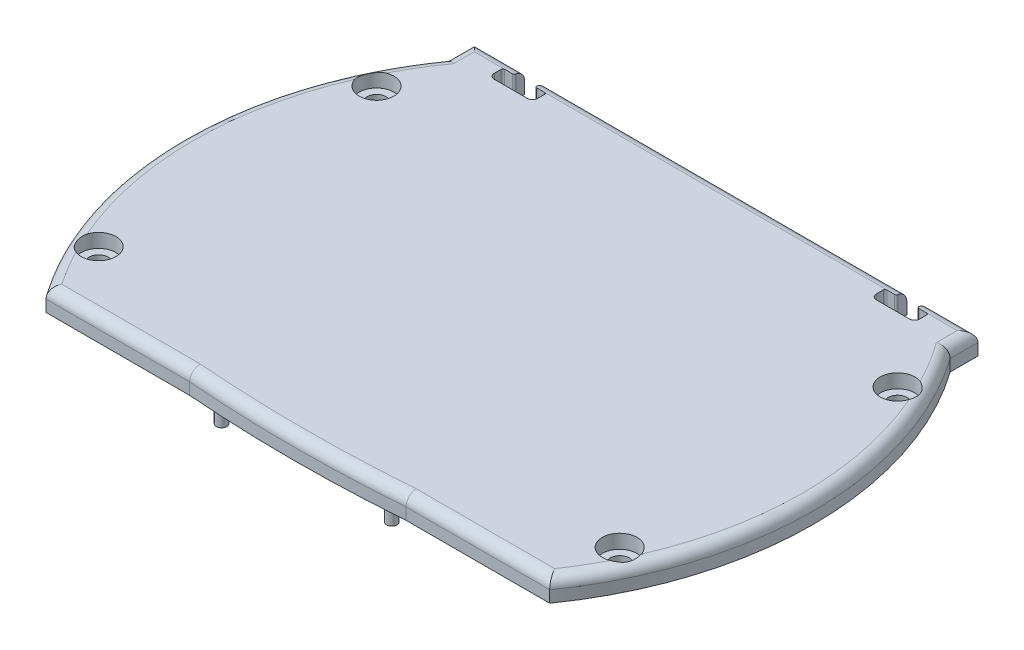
ISO-10303-21;
HEADER;
FILE_DESCRIPTION(('STEP AP214'),'2;1');
FILE_NAME('part.step','',(''),(''),'','','');
FILE_SCHEMA(('AUTOMOTIVE_DESIGN { 1 0 10303 214 1 1 1 1 }'));
ENDSEC;
DATA;
#1=APPLICATION_CONTEXT('core data for automotive mechanical design processes');
#2=APPLICATION_PROTOCOL_DEFINITION('international standard','automotive_design',2000,#1);
#3=PRODUCT_CONTEXT('',#1,'mechanical');
#4=PRODUCT('Part','Part','',(#3));
#5=PRODUCT_RELATED_PRODUCT_CATEGORY('part','',(#4));
#6=PRODUCT_DEFINITION_FORMATION('','',#4);
#7=PRODUCT_DEFINITION_CONTEXT('part definition',#1,'design');
#8=PRODUCT_DEFINITION('design','',#6,#7);
#9=PRODUCT_DEFINITION_SHAPE('','',#8);
#10=(LENGTH_UNIT() NAMED_UNIT(*) SI_UNIT(.MILLI.,.METRE.));
#11=(NAMED_UNIT(*) PLANE_ANGLE_UNIT() SI_UNIT($,.RADIAN.));
#12=(NAMED_UNIT(*) SI_UNIT($,.STERADIAN.) SOLID_ANGLE_UNIT());
#13=UNCERTAINTY_MEASURE_WITH_UNIT(LENGTH_MEASURE(1.E-05),#10,'distance_accuracy_value','');
#14=(GEOMETRIC_REPRESENTATION_CONTEXT(3) GLOBAL_UNCERTAINTY_ASSIGNED_CONTEXT((#13)) GLOBAL_UNIT_ASSIGNED_CONTEXT((#10,
#11,#12)) REPRESENTATION_CONTEXT('',''));
#15=CARTESIAN_POINT('',(0.,0.,0.));
#16=DIRECTION('',(0.,0.,1.));
#17=DIRECTION('',(1.,0.,0.));
#18=AXIS2_PLACEMENT_3D('',#15,#16,#17);
#19=CARTESIAN_POINT('',(-24.5,-5.,-2.55));
#20=DIRECTION('',(0.,1.,0.));
#21=DIRECTION('',(0.149396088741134,0.,0.98877743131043));
#22=AXIS2_PLACEMENT_3D('',#19,#20,#21);
#23=CYLINDRICAL_SURFACE('',#22,1.5);
#24=CARTESIAN_POINT('',(-24.5,-5.,-2.55));
#25=DIRECTION('',(0.,-1.,0.));
#26=DIRECTION('',(-0.149396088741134,0.,-0.98877743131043));
#27=AXIS2_PLACEMENT_3D('',#24,#25,#26);
#28=CIRCLE('',#27,1.5);
#29=CARTESIAN_POINT('',(-24.2759058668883,-5.,-1.06683385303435));
#30=VERTEX_POINT('',#29);
#31=EDGE_CURVE('P0_E9',#30,#30,#28,.T.);
#32=CARTESIAN_POINT('',(-24.5,5.,-2.55));
#33=DIRECTION('',(0.,-1.,0.));
#34=DIRECTION('',(-0.149396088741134,0.,-0.98877743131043));
#35=AXIS2_PLACEMENT_3D('',#32,#33,#34);
#36=CIRCLE('',#35,1.5);
#37=CARTESIAN_POINT('',(-24.2759058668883,5.,-1.06683385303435));
#38=VERTEX_POINT('',#37);
#39=EDGE_CURVE('P0_E17',#38,#38,#36,.T.);
#40=CARTESIAN_POINT('',(-24.2759058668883,-5.,-1.06683385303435));
#41=CARTESIAN_POINT('',(-24.2759058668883,-4.89583333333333,-1.06683385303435));
#42=CARTESIAN_POINT('',(-24.2759058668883,-4.79166666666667,-1.06683385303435));
#43=CARTESIAN_POINT('',(-24.2759058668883,-4.58333333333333,-1.06683385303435));
#44=CARTESIAN_POINT('',(-24.2759058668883,-4.47916666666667,-1.06683385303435));
#45=CARTESIAN_POINT('',(-24.2759058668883,-4.27083333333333,-1.06683385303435));
#46=CARTESIAN_POINT('',(-24.2759058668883,-4.16666666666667,-1.06683385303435));
#47=CARTESIAN_POINT('',(-24.2759058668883,-3.95833333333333,-1.06683385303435));
#48=CARTESIAN_POINT('',(-24.2759058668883,-3.85416666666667,-1.06683385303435));
#49=CARTESIAN_POINT('',(-24.2759058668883,-3.64583333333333,-1.06683385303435));
#50=CARTESIAN_POINT('',(-24.2759058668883,-3.54166666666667,-1.06683385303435));
#51=CARTESIAN_POINT('',(-24.2759058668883,-3.33333333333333,-1.06683385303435));
#52=CARTESIAN_POINT('',(-24.2759058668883,-3.22916666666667,-1.06683385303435));
#53=CARTESIAN_POINT('',(-24.2759058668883,-3.02083333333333,-1.06683385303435));
#54=CARTESIAN_POINT('',(-24.2759058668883,-2.91666666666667,-1.06683385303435));
#55=CARTESIAN_POINT('',(-24.2759058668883,-2.70833333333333,-1.06683385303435));
#56=CARTESIAN_POINT('',(-24.2759058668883,-2.60416666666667,-1.06683385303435));
#57=CARTESIAN_POINT('',(-24.2759058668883,-2.39583333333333,-1.06683385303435));
#58=CARTESIAN_POINT('',(-24.2759058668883,-2.29166666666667,-1.06683385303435));
#59=CARTESIAN_POINT('',(-24.2759058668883,-2.08333333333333,-1.06683385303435));
#60=CARTESIAN_POINT('',(-24.2759058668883,-1.97916666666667,-1.06683385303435));
#61=CARTESIAN_POINT('',(-24.2759058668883,-1.77083333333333,-1.06683385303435));
#62=CARTESIAN_POINT('',(-24.2759058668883,-1.66666666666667,-1.06683385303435));
#63=CARTESIAN_POINT('',(-24.2759058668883,-1.45833333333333,-1.06683385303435));
#64=CARTESIAN_POINT('',(-24.2759058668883,-1.35416666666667,-1.06683385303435));
#65=CARTESIAN_POINT('',(-24.2759058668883,-1.14583333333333,-1.06683385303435));
#66=CARTESIAN_POINT('',(-24.2759058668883,-1.04166666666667,-1.06683385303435));
#67=CARTESIAN_POINT('',(-24.2759058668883,-0.833333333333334,-1.06683385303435));
#68=CARTESIAN_POINT('',(-24.2759058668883,-0.729166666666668,-1.06683385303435));
#69=CARTESIAN_POINT('',(-24.2759058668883,-0.520833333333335,-1.06683385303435));
#70=CARTESIAN_POINT('',(-24.2759058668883,-0.416666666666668,-1.06683385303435));
#71=CARTESIAN_POINT('',(-24.2759058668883,-0.208333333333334,-1.06683385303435));
#72=CARTESIAN_POINT('',(-24.2759058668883,-0.104166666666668,-1.06683385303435));
#73=CARTESIAN_POINT('',(-24.2759058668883,0.104166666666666,-1.06683385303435));
#74=CARTESIAN_POINT('',(-24.2759058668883,0.208333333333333,-1.06683385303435));
#75=CARTESIAN_POINT('',(-24.2759058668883,0.416666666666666,-1.06683385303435));
#76=CARTESIAN_POINT('',(-24.2759058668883,0.520833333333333,-1.06683385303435));
#77=CARTESIAN_POINT('',(-24.2759058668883,0.729166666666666,-1.06683385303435));
#78=CARTESIAN_POINT('',(-24.2759058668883,0.833333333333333,-1.06683385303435));
#79=CARTESIAN_POINT('',(-24.2759058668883,1.04166666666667,-1.06683385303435));
#80=CARTESIAN_POINT('',(-24.2759058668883,1.14583333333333,-1.06683385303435));
#81=CARTESIAN_POINT('',(-24.2759058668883,1.35416666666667,-1.06683385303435));
#82=CARTESIAN_POINT('',(-24.2759058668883,1.45833333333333,-1.06683385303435));
#83=CARTESIAN_POINT('',(-24.2759058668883,1.66666666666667,-1.06683385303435));
#84=CARTESIAN_POINT('',(-24.2759058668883,1.77083333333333,-1.06683385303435));
#85=CARTESIAN_POINT('',(-24.2759058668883,1.97916666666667,-1.06683385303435));
#86=CARTESIAN_POINT('',(-24.2759058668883,2.08333333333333,-1.06683385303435));
#87=CARTESIAN_POINT('',(-24.2759058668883,2.29166666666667,-1.06683385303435));
#88=CARTESIAN_POINT('',(-24.2759058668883,2.39583333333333,-1.06683385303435));
#89=CARTESIAN_POINT('',(-24.2759058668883,2.60416666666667,-1.06683385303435));
#90=CARTESIAN_POINT('',(-24.2759058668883,2.70833333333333,-1.06683385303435));
#91=CARTESIAN_POINT('',(-24.2759058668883,2.91666666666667,-1.06683385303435));
#92=CARTESIAN_POINT('',(-24.2759058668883,3.02083333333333,-1.06683385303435));
#93=CARTESIAN_POINT('',(-24.2759058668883,3.22916666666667,-1.06683385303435));
#94=CARTESIAN_POINT('',(-24.2759058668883,3.33333333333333,-1.06683385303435));
#95=CARTESIAN_POINT('',(-24.2759058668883,3.54166666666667,-1.06683385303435));
#96=CARTESIAN_POINT('',(-24.2759058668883,3.64583333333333,-1.06683385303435));
#97=CARTESIAN_POINT('',(-24.2759058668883,3.85416666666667,-1.06683385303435));
#98=CARTESIAN_POINT('',(-24.2759058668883,3.95833333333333,-1.06683385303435));
#99=CARTESIAN_POINT('',(-24.2759058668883,4.16666666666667,-1.06683385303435));
#100=CARTESIAN_POINT('',(-24.2759058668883,4.27083333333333,-1.06683385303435));
#101=CARTESIAN_POINT('',(-24.2759058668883,4.47916666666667,-1.06683385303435));
#102=CARTESIAN_POINT('',(-24.2759058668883,4.58333333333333,-1.06683385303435));
#103=CARTESIAN_POINT('',(-24.2759058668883,4.79166666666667,-1.06683385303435));
#104=CARTESIAN_POINT('',(-24.2759058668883,4.89583333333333,-1.06683385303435));
#105=CARTESIAN_POINT('',(-24.2759058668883,5.,-1.06683385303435));
#106=B_SPLINE_CURVE_WITH_KNOTS('',3,(#40,#41,#42,#43,#44,#45,#46,#47,#48,#49,#50,#51,#52,#53,
#54,#55,#56,#57,#58,#59,#60,#61,#62,#63,#64,#65,#66,#67,#68,#69,#70,#71,#72,#73,#74,#75,#76,#77,
#78,#79,#80,#81,#82,#83,#84,#85,#86,#87,#88,#89,#90,#91,#92,#93,#94,#95,#96,#97,#98,#99,#100,
#101,#102,#103,#104,#105),.UNSPECIFIED.,.F.,.F.,(4,2,2,2,2,2,2,2,2,2,2,2,2,2,2,2,2,2,2,2,2,2,2,
2,2,2,2,2,2,2,2,2,4),(0.,0.3125,0.625000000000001,0.937500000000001,1.25,1.5625,1.875,2.1875,
2.5,2.8125,3.125,3.4375,3.75,4.0625,4.375,4.6875,5.,5.3125,5.625,5.9375,6.25,6.5625,6.875,
7.1875,7.5,7.8125,8.125,8.4375,8.75,9.0625,9.375,9.6875,10.),.UNSPECIFIED.);
#107=EDGE_CURVE('P0_BSEAM14',#30,#38,#106,.T.);
#108=ORIENTED_EDGE('',*,*,#31,.F.);
#109=ORIENTED_EDGE('',*,*,#39,.T.);
#110=ORIENTED_EDGE('',*,*,#107,.T.);
#111=ORIENTED_EDGE('',*,*,#107,.F.);
#112=EDGE_LOOP('',(#108,#110,#109,#111));
#113=FACE_BOUND('',#112,.T.);
#114=ADVANCED_FACE('P0_F14',(#113),#23,.T.);
#115=CARTESIAN_POINT('',(-24.5,-5.,-2.55));
#116=DIRECTION('',(0.,-1.,0.));
#117=DIRECTION('',(-0.149396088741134,0.,-0.98877743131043));
#118=AXIS2_PLACEMENT_3D('',#115,#116,#117);
#119=PLANE('',#118);
#120=ORIENTED_EDGE('',*,*,#31,.T.);
#121=EDGE_LOOP('',(#120));
#122=FACE_BOUND('',#121,.T.);
#123=ADVANCED_FACE('P0_F29',(#122),#119,.T.);
#124=CARTESIAN_POINT('',(-24.5,5.,-2.55));
#125=DIRECTION('',(0.,-1.,0.));
#126=DIRECTION('',(-0.149396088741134,0.,-0.98877743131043));
#127=AXIS2_PLACEMENT_3D('',#124,#125,#126);
#128=PLANE('',#127);
#129=ORIENTED_EDGE('',*,*,#39,.F.);
#130=EDGE_LOOP('',(#129));
#131=FACE_BOUND('',#130,.T.);
#132=ADVANCED_FACE('P0_F27',(#131),#128,.F.);
#133=CLOSED_SHELL('',(#114,#123,#132));
#134=MANIFOLD_SOLID_BREP('P0_B1',#133);
#135=CARTESIAN_POINT('',(24.5,-5.,-2.54999999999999));
#136=DIRECTION('',(0.,1.,0.));
#137=DIRECTION('',(-0.763720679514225,0.,0.645546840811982));
#138=AXIS2_PLACEMENT_3D('',#135,#136,#137);
#139=CYLINDRICAL_SURFACE('',#138,1.5);
#140=CARTESIAN_POINT('',(24.5,-5.,-2.54999999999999));
#141=DIRECTION('',(0.,-1.,0.));
#142=DIRECTION('',(0.763720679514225,0.,-0.645546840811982));
#143=AXIS2_PLACEMENT_3D('',#140,#141,#142);
#144=CIRCLE('',#143,1.5);
#145=CARTESIAN_POINT('',(25.6455810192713,-5.,-3.51832026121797));
#146=VERTEX_POINT('',#145);
#147=EDGE_CURVE('P1_E10',#146,#146,#144,.T.);
#148=ORIENTED_EDGE('',*,*,#147,.F.);
#149=EDGE_LOOP('',(#148));
#150=FACE_BOUND('',#149,.T.);
#151=CARTESIAN_POINT('',(24.5,5.,-2.54999999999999));
#152=DIRECTION('',(0.,-1.,0.));
#153=DIRECTION('',(0.763720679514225,0.,-0.645546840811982));
#154=AXIS2_PLACEMENT_3D('',#151,#152,#153);
#155=CIRCLE('',#154,1.5);
#156=CARTESIAN_POINT('',(25.6455810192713,5.,-3.51832026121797));
#157=VERTEX_POINT('',#156);
#158=EDGE_CURVE('P1_E18',#157,#157,#155,.T.);
#159=ORIENTED_EDGE('',*,*,#158,.T.);
#160=EDGE_LOOP('',(#159));
#161=FACE_BOUND('',#160,.T.);
#162=ADVANCED_FACE('P1_F15',(#150,#161),#139,.T.);
#163=CARTESIAN_POINT('',(24.5,-5.,-2.54999999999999));
#164=DIRECTION('',(0.,-1.,0.));
#165=DIRECTION('',(0.763720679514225,0.,-0.645546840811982));
#166=AXIS2_PLACEMENT_3D('',#163,#164,#165);
#167=PLANE('',#166);
#168=ORIENTED_EDGE('',*,*,#147,.T.);
#169=EDGE_LOOP('',(#168));
#170=FACE_BOUND('',#169,.T.);
#171=ADVANCED_FACE('P1_F30',(#170),#167,.T.);
#172=CARTESIAN_POINT('',(24.5,5.,-2.54999999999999));
#173=DIRECTION('',(0.,-1.,0.));
#174=DIRECTION('',(0.763720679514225,0.,-0.645546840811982));
#175=AXIS2_PLACEMENT_3D('',#172,#173,#174);
#176=PLANE('',#175);
#177=ORIENTED_EDGE('',*,*,#158,.F.);
#178=EDGE_LOOP('',(#177));
#179=FACE_BOUND('',#178,.T.);
#180=ADVANCED_FACE('P1_F28',(#179),#176,.F.);
#181=CLOSED_SHELL('',(#162,#171,#180));
#182=MANIFOLD_SOLID_BREP('P1_B1',#181);
#183=CARTESIAN_POINT('',(-72.5,6.35,-123.3));
#184=DIRECTION('',(0.,0.,1.));
#185=DIRECTION('',(1.,0.,0.));
#186=AXIS2_PLACEMENT_3D('',#183,#184,#185);
#187=PLANE('',#186);
#188=DIRECTION('',(-1.,0.,0.));
#189=VECTOR('',#188,1.);
#190=CARTESIAN_POINT('',(72.5,3.35,-123.3));
#191=LINE('',#190,#189);
#192=CARTESIAN_POINT('',(-72.5,3.35,-123.3));
#193=VERTEX_POINT('',#192);
#194=CARTESIAN_POINT('',(-57.999999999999,3.35,-123.299999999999));
#195=VERTEX_POINT('',#194);
#196=EDGE_CURVE('P2_E805',#193,#195,#191,.F.);
#197=ORIENTED_EDGE('',*,*,#196,.T.);
#198=DIRECTION('',(0.,1.,0.));
#199=VECTOR('',#198,1.);
#200=CARTESIAN_POINT('',(-57.999999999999,0.,-123.299999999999));
#201=LINE('',#200,#199);
#202=CARTESIAN_POINT('',(-57.999999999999,0.,-123.299999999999));
#203=VERTEX_POINT('',#202);
#204=EDGE_CURVE('P2_E506',#203,#195,#201,.T.);
#205=ORIENTED_EDGE('',*,*,#204,.F.);
#206=DIRECTION('',(-1.,0.,0.));
#207=VECTOR('',#206,1.);
#208=CARTESIAN_POINT('',(-72.5,0.,-123.3));
#209=LINE('',#208,#207);
#210=CARTESIAN_POINT('',(-72.5,0.,-123.3));
#211=VERTEX_POINT('',#210);
#212=EDGE_CURVE('P2_E741',#203,#211,#209,.T.);
#213=ORIENTED_EDGE('',*,*,#212,.T.);
#214=DIRECTION('',(0.,-1.,0.));
#215=VECTOR('',#214,1.);
#216=CARTESIAN_POINT('',(-72.5,6.35,-123.3));
#217=LINE('',#216,#215);
#218=EDGE_CURVE('P2_E761',#193,#211,#217,.T.);
#219=ORIENTED_EDGE('',*,*,#218,.F.);
#220=EDGE_LOOP('',(#197,#205,#213,#219));
#221=FACE_BOUND('',#220,.T.);
#222=ADVANCED_FACE('P2_F17',(#221),#187,.F.);
#223=CARTESIAN_POINT('',(-9.20971484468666,3.35,-120.3));
#224=DIRECTION('',(1.,0.,0.));
#225=DIRECTION('',(0.,0.,-1.));
#226=AXIS2_PLACEMENT_3D('',#223,#224,#225);
#227=CYLINDRICAL_SURFACE('',#226,3.);
#228=CARTESIAN_POINT('',(-58.499999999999,6.35,-120.299999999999));
#229=CARTESIAN_POINT('',(-58.5280852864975,6.3500003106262,-120.300001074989));
#230=CARTESIAN_POINT('',(-58.5561858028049,6.35000289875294,-120.302373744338));
#231=CARTESIAN_POINT('',(-58.6116076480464,6.3499803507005,-120.311804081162));
#232=CARTESIAN_POINT('',(-58.6389282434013,6.34995518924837,-120.318866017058));
#233=CARTESIAN_POINT('',(-58.6919890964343,6.34978028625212,-120.337474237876));
#234=CARTESIAN_POINT('',(-58.7177298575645,6.34963058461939,-120.349019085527));
#235=CARTESIAN_POINT('',(-58.7669010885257,6.34906132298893,-120.376262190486));
#236=CARTESIAN_POINT('',(-58.7903319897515,6.34864181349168,-120.391959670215));
#237=CARTESIAN_POINT('',(-58.8341961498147,6.34736018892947,-120.427038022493));
#238=CARTESIAN_POINT('',(-58.8546327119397,6.34649856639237,-120.44641478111));
#239=CARTESIAN_POINT('',(-58.8919550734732,6.34415808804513,-120.488298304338));
#240=CARTESIAN_POINT('',(-58.9088409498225,6.34267924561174,-120.510805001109));
#241=CARTESIAN_POINT('',(-58.9385134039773,6.33896477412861,-120.558167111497));
#242=CARTESIAN_POINT('',(-58.9513193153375,6.3367328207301,-120.583010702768));
#243=CARTESIAN_POINT('',(-58.972599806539,6.33141615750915,-120.634401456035));
#244=CARTESIAN_POINT('',(-58.981074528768,6.32833147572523,-120.660948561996));
#245=CARTESIAN_POINT('',(-58.9934903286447,6.32128934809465,-120.714945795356));
#246=CARTESIAN_POINT('',(-58.9974350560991,6.3173326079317,-120.742395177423));
#247=CARTESIAN_POINT('',(-59.0007533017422,6.30860300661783,-120.797438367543));
#248=CARTESIAN_POINT('',(-59.0001264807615,6.30383008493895,-120.825032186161));
#249=CARTESIAN_POINT('',(-58.9943381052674,6.29352639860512,-120.880040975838));
#250=CARTESIAN_POINT('',(-58.9891064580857,6.28798504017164,-120.907446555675));
#251=CARTESIAN_POINT('',(-58.9742106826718,6.2764201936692,-120.960919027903));
#252=CARTESIAN_POINT('',(-58.9645457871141,6.2703966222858,-120.986985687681));
#253=CARTESIAN_POINT('',(-58.9407408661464,6.25797708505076,-121.037816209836));
#254=CARTESIAN_POINT('',(-58.926485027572,6.25157543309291,-121.06252449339));
#255=CARTESIAN_POINT('',(-58.8939665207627,6.23890888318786,-121.109191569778));
#256=CARTESIAN_POINT('',(-58.8757032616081,6.23264400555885,-121.131149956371));
#257=CARTESIAN_POINT('',(-58.8353888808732,6.22056850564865,-121.171948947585));
#258=CARTESIAN_POINT('',(-58.8132965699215,6.21476394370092,-121.190750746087));
#259=CARTESIAN_POINT('',(-58.7660390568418,6.20410408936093,-121.224338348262));
#260=CARTESIAN_POINT('',(-58.740874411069,6.19924862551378,-121.239124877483));
#261=CARTESIAN_POINT('',(-58.6889606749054,6.19100109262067,-121.263782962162));
#262=CARTESIAN_POINT('',(-58.6622816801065,6.18756952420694,-121.273788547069));
#263=CARTESIAN_POINT('',(-58.6074703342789,6.18225467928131,-121.289141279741));
#264=CARTESIAN_POINT('',(-58.5793385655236,6.18037078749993,-121.294490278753));
#265=CARTESIAN_POINT('',(-58.5239840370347,6.1783724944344,-121.300158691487));
#266=CARTESIAN_POINT('',(-58.4967892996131,6.17817178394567,-121.300723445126));
#267=CARTESIAN_POINT('',(-58.4427032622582,6.17932993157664,-121.297444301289));
#268=CARTESIAN_POINT('',(-58.4158119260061,6.18068860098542,-121.293600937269));
#269=CARTESIAN_POINT('',(-58.36363009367,6.18481204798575,-121.281773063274));
#270=CARTESIAN_POINT('',(-58.3383186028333,6.18754887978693,-121.273870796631));
#271=CARTESIAN_POINT('',(-58.2893921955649,6.19420839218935,-121.25424597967));
#272=CARTESIAN_POINT('',(-58.2657775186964,6.19813123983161,-121.2425228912));
#273=CARTESIAN_POINT('',(-58.2200745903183,6.20703690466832,-121.215179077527));
#274=CARTESIAN_POINT('',(-58.1980604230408,6.21204990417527,-121.199444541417));
#275=CARTESIAN_POINT('',(-58.1569361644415,6.22272733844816,-121.164735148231));
#276=CARTESIAN_POINT('',(-58.1378268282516,6.22839194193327,-121.145759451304));
#277=CARTESIAN_POINT('',(-58.1020519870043,6.24033564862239,-121.104023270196));
#278=CARTESIAN_POINT('',(-58.0855580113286,6.24663133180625,-121.081120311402));
#279=CARTESIAN_POINT('',(-58.0566445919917,6.25921403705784,-121.03286765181));
#280=CARTESIAN_POINT('',(-58.0442257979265,6.26550105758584,-121.007517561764));
#281=CARTESIAN_POINT('',(-58.023568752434,6.27788381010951,-120.954412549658));
#282=CARTESIAN_POINT('',(-58.0154332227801,6.2839718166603,-120.926615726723));
#283=CARTESIAN_POINT('',(-58.0040676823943,6.29551211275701,-120.869907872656));
#284=CARTESIAN_POINT('',(-58.0008372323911,6.3009644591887,-120.840996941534));
#285=CARTESIAN_POINT('',(-57.999459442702,6.31094589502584,-120.783364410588));
#286=CARTESIAN_POINT('',(-58.0012325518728,6.31548821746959,-120.754647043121));
#287=CARTESIAN_POINT('',(-58.0097110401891,6.32364541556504,-120.697815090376));
#288=CARTESIAN_POINT('',(-58.016415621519,6.32726044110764,-120.669700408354));
#289=CARTESIAN_POINT('',(-58.0343611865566,6.33346379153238,-120.615695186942));
#290=CARTESIAN_POINT('',(-58.0454744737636,6.33607725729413,-120.589765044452));
#291=CARTESIAN_POINT('',(-58.0719365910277,6.34048146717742,-120.540089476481));
#292=CARTESIAN_POINT('',(-58.0872850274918,6.34227228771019,-120.516343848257));
#293=CARTESIAN_POINT('',(-58.1215786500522,6.3451458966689,-120.472016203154));
#294=CARTESIAN_POINT('',(-58.140479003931,6.34623683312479,-120.451399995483));
#295=CARTESIAN_POINT('',(-58.1814649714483,6.34790867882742,-120.413589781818));
#296=CARTESIAN_POINT('',(-58.2035512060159,6.34848948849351,-120.396396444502));
#297=CARTESIAN_POINT('',(-58.2503555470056,6.34931566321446,-120.365879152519));
#298=CARTESIAN_POINT('',(-58.2750817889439,6.34955995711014,-120.352567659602));
#299=CARTESIAN_POINT('',(-58.326397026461,6.34986813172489,-120.330273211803));
#300=CARTESIAN_POINT('',(-58.3529843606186,6.34993217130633,-120.321286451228));
#301=CARTESIAN_POINT('',(-58.3997132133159,6.34998793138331,-120.309744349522));
#302=CARTESIAN_POINT('',(-58.4195919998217,6.34999480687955,-120.306095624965));
#303=CARTESIAN_POINT('',(-58.4596445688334,6.35000072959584,-120.301223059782));
#304=CARTESIAN_POINT('',(-58.4798183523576,6.34999977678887,-120.299999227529));
#305=CARTESIAN_POINT('',(-58.499999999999,6.35,-120.299999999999));
#306=B_SPLINE_CURVE_WITH_KNOTS('',3,(#228,#229,#230,#231,#232,#233,#234,#235,#236,#237,#238,
#239,#240,#241,#242,#243,#244,#245,#246,#247,#248,#249,#250,#251,#252,#253,#254,#255,#256,#257,
#258,#259,#260,#261,#262,#263,#264,#265,#266,#267,#268,#269,#270,#271,#272,#273,#274,#275,#276,
#277,#278,#279,#280,#281,#282,#283,#284,#285,#286,#287,#288,#289,#290,#291,#292,#293,#294,#295,
#296,#297,#298,#299,#300,#301,#302,#303,#304,#305),.UNSPECIFIED.,.T.,.F.,(4,2,2,2,2,2,2,2,2,2,2,
2,2,2,2,2,2,2,2,2,2,2,2,2,2,2,2,2,2,2,2,2,2,2,2,2,2,2,4),(0.,0.0841829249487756,
0.168442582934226,0.252675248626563,0.33689215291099,0.421015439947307,0.505136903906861,
0.588853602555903,0.672567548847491,0.756213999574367,0.839866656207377,0.924815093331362,
1.00977823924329,1.0970790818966,1.18439280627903,1.27271178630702,1.3610147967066,
1.44667116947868,1.53229347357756,1.6134966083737,1.69468991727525,1.77429939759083,
1.85392009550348,1.93611629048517,2.01833381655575,2.1046917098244,2.19106336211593,
2.27942155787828,2.36777184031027,2.45472539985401,2.54166489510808,2.62625123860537,
2.71082972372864,2.79440476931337,2.87799612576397,2.96185295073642,3.04563584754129,
3.10612817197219,3.16662070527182),.UNSPECIFIED.);
#307=CARTESIAN_POINT('',(-57.999999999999,6.30803989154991,-120.799999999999));
#308=VERTEX_POINT('',#307);
#309=CARTESIAN_POINT('',(-58.499999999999,6.35,-120.299999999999));
#310=VERTEX_POINT('',#309);
#311=EDGE_CURVE('P2_E1043',#308,#310,#306,.T.);
#312=ORIENTED_EDGE('',*,*,#311,.F.);
#313=CARTESIAN_POINT('',(-57.999999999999,3.35,-120.3));
#314=DIRECTION('',(-1.,0.,0.));
#315=DIRECTION('',(0.,0.,1.));
#316=AXIS2_PLACEMENT_3D('',#313,#314,#315);
#317=CIRCLE('',#316,3.);
#318=EDGE_CURVE('P2_E1067',#195,#308,#317,.F.);
#319=ORIENTED_EDGE('',*,*,#318,.F.);
#320=ORIENTED_EDGE('',*,*,#196,.F.);
#321=CARTESIAN_POINT('',(-69.5,3.35,-120.3));
#322=DIRECTION('',(0.707106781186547,0.,-0.707106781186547));
#323=DIRECTION('',(0.707106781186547,0.,0.707106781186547));
#324=AXIS2_PLACEMENT_3D('',#321,#322,#323);
#325=ELLIPSE('',#324,4.24264068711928,3.);
#326=CARTESIAN_POINT('',(-69.5,6.35,-120.3));
#327=VERTEX_POINT('',#326);
#328=EDGE_CURVE('P2_E943',#193,#327,#325,.T.);
#329=ORIENTED_EDGE('',*,*,#328,.T.);
#330=DIRECTION('',(-1.,0.,0.));
#331=VECTOR('',#330,1.);
#332=CARTESIAN_POINT('',(-72.5,6.35,-120.3));
#333=LINE('',#332,#331);
#334=CARTESIAN_POINT('',(-60.749999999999,6.35,-120.299999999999));
#335=VERTEX_POINT('',#334);
#336=EDGE_CURVE('P2_E775',#335,#327,#333,.T.);
#337=ORIENTED_EDGE('',*,*,#336,.F.);
#338=DIRECTION('',(-1.,0.,0.));
#339=VECTOR('',#338,1.);
#340=CARTESIAN_POINT('',(-58.499999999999,6.35,-120.299999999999));
#341=LINE('',#340,#339);
#342=EDGE_CURVE('P2_E475',#310,#335,#341,.T.);
#343=ORIENTED_EDGE('',*,*,#342,.F.);
#344=EDGE_LOOP('',(#312,#319,#320,#329,#337,#343));
#345=FACE_BOUND('',#344,.T.);
#346=ADVANCED_FACE('P2_F911',(#345),#227,.T.);
#347=CARTESIAN_POINT('',(51.999999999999,0.,-123.299999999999));
#348=VERTEX_POINT('',#347);
#349=CARTESIAN_POINT('',(-51.999999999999,0.,-123.299999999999));
#350=VERTEX_POINT('',#349);
#351=EDGE_CURVE('P2_E746',#348,#350,#209,.T.);
#352=ORIENTED_EDGE('',*,*,#351,.T.);
#353=DIRECTION('',(0.,1.,0.));
#354=VECTOR('',#353,1.);
#355=CARTESIAN_POINT('',(-51.999999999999,0.,-123.299999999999));
#356=LINE('',#355,#354);
#357=CARTESIAN_POINT('',(-51.999999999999,3.35,-123.299999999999));
#358=VERTEX_POINT('',#357);
#359=EDGE_CURVE('P2_E508',#350,#358,#356,.T.);
#360=ORIENTED_EDGE('',*,*,#359,.T.);
#361=CARTESIAN_POINT('',(51.999999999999,3.35,-123.299999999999));
#362=VERTEX_POINT('',#361);
#363=EDGE_CURVE('P2_E809',#358,#362,#191,.F.);
#364=ORIENTED_EDGE('',*,*,#363,.T.);
#365=DIRECTION('',(0.,1.,0.));
#366=VECTOR('',#365,1.);
#367=CARTESIAN_POINT('',(51.999999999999,0.,-123.299999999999));
#368=LINE('',#367,#366);
#369=EDGE_CURVE('P2_E614',#348,#362,#368,.T.);
#370=ORIENTED_EDGE('',*,*,#369,.F.);
#371=EDGE_LOOP('',(#352,#360,#364,#370));
#372=FACE_BOUND('',#371,.T.);
#373=ADVANCED_FACE('P2_F898',(#372),#187,.F.);
#374=CARTESIAN_POINT('',(-51.9999999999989,3.35,-120.3));
#375=DIRECTION('',(1.,0.,0.));
#376=DIRECTION('',(0.,0.,-1.));
#377=AXIS2_PLACEMENT_3D('',#374,#375,#376);
#378=CIRCLE('',#377,3.);
#379=CARTESIAN_POINT('',(-51.999999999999,6.30803989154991,-120.799999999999));
#380=VERTEX_POINT('',#379);
#381=EDGE_CURVE('P2_E525',#380,#358,#378,.F.);
#382=ORIENTED_EDGE('',*,*,#381,.F.);
#383=CARTESIAN_POINT('',(-51.499999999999,6.35,-120.299999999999));
#384=CARTESIAN_POINT('',(-51.5280852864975,6.3500003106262,-120.300001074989));
#385=CARTESIAN_POINT('',(-51.5561858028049,6.35000289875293,-120.302373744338));
#386=CARTESIAN_POINT('',(-51.6116076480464,6.34998035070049,-120.311804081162));
#387=CARTESIAN_POINT('',(-51.6389282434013,6.34995518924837,-120.318866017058));
#388=CARTESIAN_POINT('',(-51.6919890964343,6.34978028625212,-120.337474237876));
#389=CARTESIAN_POINT('',(-51.7177298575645,6.34963058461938,-120.349019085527));
#390=CARTESIAN_POINT('',(-51.7669010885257,6.34906132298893,-120.376262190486));
#391=CARTESIAN_POINT('',(-51.7903319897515,6.34864181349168,-120.391959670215));
#392=CARTESIAN_POINT('',(-51.8341961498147,6.34736018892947,-120.427038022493));
#393=CARTESIAN_POINT('',(-51.8546327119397,6.34649856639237,-120.44641478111));
#394=CARTESIAN_POINT('',(-51.8919550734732,6.34415808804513,-120.488298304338));
#395=CARTESIAN_POINT('',(-51.9088409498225,6.34267924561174,-120.510805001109));
#396=CARTESIAN_POINT('',(-51.9385134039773,6.33896477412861,-120.558167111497));
#397=CARTESIAN_POINT('',(-51.9513193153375,6.3367328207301,-120.583010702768));
#398=CARTESIAN_POINT('',(-51.972599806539,6.33141615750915,-120.634401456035));
#399=CARTESIAN_POINT('',(-51.981074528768,6.32833147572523,-120.660948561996));
#400=CARTESIAN_POINT('',(-51.9934903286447,6.32128934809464,-120.714945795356));
#401=CARTESIAN_POINT('',(-51.9974350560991,6.3173326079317,-120.742395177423));
#402=CARTESIAN_POINT('',(-52.0007533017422,6.30860300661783,-120.797438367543));
#403=CARTESIAN_POINT('',(-52.0001264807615,6.30383008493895,-120.825032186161));
#404=CARTESIAN_POINT('',(-51.9943381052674,6.29352639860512,-120.880040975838));
#405=CARTESIAN_POINT('',(-51.9891064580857,6.28798504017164,-120.907446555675));
#406=CARTESIAN_POINT('',(-51.9742106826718,6.27642019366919,-120.960919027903));
#407=CARTESIAN_POINT('',(-51.9645457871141,6.2703966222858,-120.986985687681));
#408=CARTESIAN_POINT('',(-51.9407408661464,6.25797708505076,-121.037816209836));
#409=CARTESIAN_POINT('',(-51.9264850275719,6.25157543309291,-121.06252449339));
#410=CARTESIAN_POINT('',(-51.8939665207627,6.23890888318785,-121.109191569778));
#411=CARTESIAN_POINT('',(-51.8757032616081,6.23264400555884,-121.131149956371));
#412=CARTESIAN_POINT('',(-51.8353888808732,6.22056850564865,-121.171948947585));
#413=CARTESIAN_POINT('',(-51.8132965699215,6.21476394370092,-121.190750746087));
#414=CARTESIAN_POINT('',(-51.7660390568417,6.20410408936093,-121.224338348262));
#415=CARTESIAN_POINT('',(-51.7408744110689,6.19924862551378,-121.239124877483));
#416=CARTESIAN_POINT('',(-51.6889606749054,6.19100109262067,-121.263782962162));
#417=CARTESIAN_POINT('',(-51.6622816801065,6.18756952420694,-121.273788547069));
#418=CARTESIAN_POINT('',(-51.6074703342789,6.18225467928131,-121.289141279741));
#419=CARTESIAN_POINT('',(-51.5793385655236,6.18037078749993,-121.294490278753));
#420=CARTESIAN_POINT('',(-51.5239840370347,6.1783724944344,-121.300158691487));
#421=CARTESIAN_POINT('',(-51.496789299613,6.17817178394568,-121.300723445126));
#422=CARTESIAN_POINT('',(-51.4427032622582,6.17932993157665,-121.297444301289));
#423=CARTESIAN_POINT('',(-51.4158119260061,6.18068860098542,-121.293600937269));
#424=CARTESIAN_POINT('',(-51.36363009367,6.18481204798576,-121.281773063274));
#425=CARTESIAN_POINT('',(-51.3383186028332,6.18754887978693,-121.273870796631));
#426=CARTESIAN_POINT('',(-51.2893921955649,6.19420839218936,-121.25424597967));
#427=CARTESIAN_POINT('',(-51.2657775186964,6.19813123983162,-121.2425228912));
#428=CARTESIAN_POINT('',(-51.2200745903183,6.20703690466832,-121.215179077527));
#429=CARTESIAN_POINT('',(-51.1980604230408,6.21204990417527,-121.199444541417));
#430=CARTESIAN_POINT('',(-51.1569361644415,6.22272733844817,-121.164735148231));
#431=CARTESIAN_POINT('',(-51.1378268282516,6.22839194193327,-121.145759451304));
#432=CARTESIAN_POINT('',(-51.1020519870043,6.2403356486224,-121.104023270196));
#433=CARTESIAN_POINT('',(-51.0855580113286,6.24663133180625,-121.081120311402));
#434=CARTESIAN_POINT('',(-51.0566445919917,6.25921403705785,-121.03286765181));
#435=CARTESIAN_POINT('',(-51.0442257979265,6.26550105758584,-121.007517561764));
#436=CARTESIAN_POINT('',(-51.023568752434,6.27788381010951,-120.954412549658));
#437=CARTESIAN_POINT('',(-51.0154332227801,6.2839718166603,-120.926615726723));
#438=CARTESIAN_POINT('',(-51.0040676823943,6.29551211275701,-120.869907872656));
#439=CARTESIAN_POINT('',(-51.0008372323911,6.30096445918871,-120.840996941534));
#440=CARTESIAN_POINT('',(-50.999459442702,6.31094589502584,-120.783364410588));
#441=CARTESIAN_POINT('',(-51.0012325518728,6.31548821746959,-120.75464704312));
#442=CARTESIAN_POINT('',(-51.0097110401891,6.32364541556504,-120.697815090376));
#443=CARTESIAN_POINT('',(-51.016415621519,6.32726044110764,-120.669700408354));
#444=CARTESIAN_POINT('',(-51.0343611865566,6.33346379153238,-120.615695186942));
#445=CARTESIAN_POINT('',(-51.0454744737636,6.33607725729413,-120.589765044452));
#446=CARTESIAN_POINT('',(-51.0719365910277,6.34048146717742,-120.540089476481));
#447=CARTESIAN_POINT('',(-51.0872850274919,6.34227228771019,-120.516343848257));
#448=CARTESIAN_POINT('',(-51.1215786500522,6.3451458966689,-120.472016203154));
#449=CARTESIAN_POINT('',(-51.140479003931,6.34623683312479,-120.451399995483));
#450=CARTESIAN_POINT('',(-51.1814649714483,6.34790867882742,-120.413589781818));
#451=CARTESIAN_POINT('',(-51.2035512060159,6.34848948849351,-120.396396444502));
#452=CARTESIAN_POINT('',(-51.2503555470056,6.34931566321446,-120.365879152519));
#453=CARTESIAN_POINT('',(-51.2750817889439,6.34955995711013,-120.352567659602));
#454=CARTESIAN_POINT('',(-51.326397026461,6.34986813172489,-120.330273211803));
#455=CARTESIAN_POINT('',(-51.3529843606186,6.34993217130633,-120.321286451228));
#456=CARTESIAN_POINT('',(-51.3997132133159,6.34998793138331,-120.309744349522));
#457=CARTESIAN_POINT('',(-51.4195919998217,6.34999480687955,-120.306095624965));
#458=CARTESIAN_POINT('',(-51.4596445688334,6.35000072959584,-120.301223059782));
#459=CARTESIAN_POINT('',(-51.4798183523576,6.34999977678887,-120.299999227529));
#460=CARTESIAN_POINT('',(-51.499999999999,6.35,-120.299999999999));
#461=B_SPLINE_CURVE_WITH_KNOTS('',3,(#383,#384,#385,#386,#387,#388,#389,#390,#391,#392,#393,
#394,#395,#396,#397,#398,#399,#400,#401,#402,#403,#404,#405,#406,#407,#408,#409,#410,#411,#412,
#413,#414,#415,#416,#417,#418,#419,#420,#421,#422,#423,#424,#425,#426,#427,#428,#429,#430,#431,
#432,#433,#434,#435,#436,#437,#438,#439,#440,#441,#442,#443,#444,#445,#446,#447,#448,#449,#450,
#451,#452,#453,#454,#455,#456,#457,#458,#459,#460),.UNSPECIFIED.,.T.,.F.,(4,2,2,2,2,2,2,2,2,2,2,
2,2,2,2,2,2,2,2,2,2,2,2,2,2,2,2,2,2,2,2,2,2,2,2,2,2,2,4),(0.,0.0841829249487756,
0.16844258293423,0.252675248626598,0.336892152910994,0.421015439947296,0.50513690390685,
0.588853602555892,0.67256754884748,0.75621399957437,0.83986665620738,0.924815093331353,
1.00977823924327,1.09707908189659,1.18439280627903,1.27271178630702,1.36101479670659,
1.44667116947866,1.53229347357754,1.61349660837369,1.69468991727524,1.77429939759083,
1.85392009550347,1.93611629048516,2.01833381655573,2.1046917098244,2.19106336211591,
2.27942155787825,2.36777184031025,2.45472539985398,2.54166489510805,2.62625123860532,
2.71082972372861,2.79440476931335,2.87799612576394,2.9618529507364,3.04563584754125,
3.10612817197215,3.16662070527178),.UNSPECIFIED.);
#462=CARTESIAN_POINT('',(-51.499999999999,6.35,-120.299999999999));
#463=VERTEX_POINT('',#462);
#464=EDGE_CURVE('P2_E491',#463,#380,#461,.T.);
#465=ORIENTED_EDGE('',*,*,#464,.F.);
#466=DIRECTION('',(-1.,0.,0.));
#467=VECTOR('',#466,1.);
#468=CARTESIAN_POINT('',(-51.499999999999,6.35,-120.299999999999));
#469=LINE('',#468,#467);
#470=CARTESIAN_POINT('',(-49.249999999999,6.35,-120.299999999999));
#471=VERTEX_POINT('',#470);
#472=EDGE_CURVE('P2_E472',#471,#463,#469,.T.);
#473=ORIENTED_EDGE('',*,*,#472,.F.);
#474=CARTESIAN_POINT('',(49.249999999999,6.35,-120.299999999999));
#475=VERTEX_POINT('',#474);
#476=EDGE_CURVE('P2_E631',#475,#471,#333,.T.);
#477=ORIENTED_EDGE('',*,*,#476,.F.);
#478=DIRECTION('',(-1.,0.,0.));
#479=VECTOR('',#478,1.);
#480=CARTESIAN_POINT('',(51.499999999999,6.35,-120.299999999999));
#481=LINE('',#480,#479);
#482=CARTESIAN_POINT('',(51.499999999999,6.35,-120.3));
#483=VERTEX_POINT('',#482);
#484=EDGE_CURVE('P2_E628',#483,#475,#481,.T.);
#485=ORIENTED_EDGE('',*,*,#484,.F.);
#486=CARTESIAN_POINT('',(51.499999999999,6.35,-120.3));
#487=CARTESIAN_POINT('',(51.4719147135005,6.3500003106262,-120.30000107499));
#488=CARTESIAN_POINT('',(51.4438141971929,6.35000289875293,-120.302373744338));
#489=CARTESIAN_POINT('',(51.3883923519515,6.34998035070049,-120.311804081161));
#490=CARTESIAN_POINT('',(51.3610717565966,6.34995518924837,-120.318866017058));
#491=CARTESIAN_POINT('',(51.3080109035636,6.34978028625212,-120.337474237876));
#492=CARTESIAN_POINT('',(51.2822701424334,6.34963058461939,-120.349019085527));
#493=CARTESIAN_POINT('',(51.2330989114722,6.34906132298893,-120.376262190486));
#494=CARTESIAN_POINT('',(51.2096680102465,6.34864181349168,-120.391959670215));
#495=CARTESIAN_POINT('',(51.1658038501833,6.34736018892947,-120.427038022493));
#496=CARTESIAN_POINT('',(51.1453672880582,6.34649856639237,-120.44641478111));
#497=CARTESIAN_POINT('',(51.1080449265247,6.34415808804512,-120.488298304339));
#498=CARTESIAN_POINT('',(51.0911590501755,6.34267924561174,-120.510805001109));
#499=CARTESIAN_POINT('',(51.0614865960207,6.33896477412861,-120.558167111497));
#500=CARTESIAN_POINT('',(51.0486806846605,6.3367328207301,-120.583010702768));
#501=CARTESIAN_POINT('',(51.0274001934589,6.33141615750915,-120.634401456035));
#502=CARTESIAN_POINT('',(51.01892547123,6.32833147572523,-120.660948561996));
#503=CARTESIAN_POINT('',(51.0065096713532,6.32128934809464,-120.714945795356));
#504=CARTESIAN_POINT('',(51.0025649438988,6.3173326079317,-120.742395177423));
#505=CARTESIAN_POINT('',(50.9992466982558,6.30860300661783,-120.797438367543));
#506=CARTESIAN_POINT('',(50.9998735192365,6.30383008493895,-120.825032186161));
#507=CARTESIAN_POINT('',(51.0056618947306,6.29352639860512,-120.880040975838));
#508=CARTESIAN_POINT('',(51.0108935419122,6.28798504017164,-120.907446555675));
#509=CARTESIAN_POINT('',(51.0257893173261,6.27642019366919,-120.960919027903));
#510=CARTESIAN_POINT('',(51.0354542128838,6.2703966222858,-120.986985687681));
#511=CARTESIAN_POINT('',(51.0592591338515,6.25797708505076,-121.037816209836));
#512=CARTESIAN_POINT('',(51.073514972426,6.25157543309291,-121.06252449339));
#513=CARTESIAN_POINT('',(51.1060334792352,6.23890888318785,-121.109191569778));
#514=CARTESIAN_POINT('',(51.1242967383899,6.23264400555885,-121.131149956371));
#515=CARTESIAN_POINT('',(51.1646111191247,6.22056850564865,-121.171948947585));
#516=CARTESIAN_POINT('',(51.1867034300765,6.21476394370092,-121.190750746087));
#517=CARTESIAN_POINT('',(51.2339609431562,6.20410408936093,-121.224338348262));
#518=CARTESIAN_POINT('',(51.259125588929,6.19924862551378,-121.239124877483));
#519=CARTESIAN_POINT('',(51.3110393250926,6.19100109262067,-121.263782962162));
#520=CARTESIAN_POINT('',(51.3377183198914,6.18756952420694,-121.273788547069));
#521=CARTESIAN_POINT('',(51.392529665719,6.18225467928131,-121.289141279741));
#522=CARTESIAN_POINT('',(51.4206614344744,6.18037078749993,-121.294490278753));
#523=CARTESIAN_POINT('',(51.4760159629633,6.1783724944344,-121.300158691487));
#524=CARTESIAN_POINT('',(51.5032107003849,6.17817178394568,-121.300723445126));
#525=CARTESIAN_POINT('',(51.5572967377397,6.17932993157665,-121.297444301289));
#526=CARTESIAN_POINT('',(51.5841880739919,6.18068860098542,-121.293600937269));
#527=CARTESIAN_POINT('',(51.636369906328,6.18481204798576,-121.281773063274));
#528=CARTESIAN_POINT('',(51.6616813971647,6.18754887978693,-121.273870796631));
#529=CARTESIAN_POINT('',(51.7106078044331,6.19420839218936,-121.25424597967));
#530=CARTESIAN_POINT('',(51.7342224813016,6.19813123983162,-121.2425228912));
#531=CARTESIAN_POINT('',(51.7799254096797,6.20703690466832,-121.215179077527));
#532=CARTESIAN_POINT('',(51.8019395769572,6.21204990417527,-121.199444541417));
#533=CARTESIAN_POINT('',(51.8430638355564,6.22272733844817,-121.164735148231));
#534=CARTESIAN_POINT('',(51.8621731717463,6.22839194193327,-121.145759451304));
#535=CARTESIAN_POINT('',(51.8979480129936,6.2403356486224,-121.104023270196));
#536=CARTESIAN_POINT('',(51.9144419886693,6.24663133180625,-121.081120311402));
#537=CARTESIAN_POINT('',(51.9433554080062,6.25921403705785,-121.03286765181));
#538=CARTESIAN_POINT('',(51.9557742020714,6.26550105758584,-121.007517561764));
#539=CARTESIAN_POINT('',(51.976431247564,6.27788381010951,-120.954412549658));
#540=CARTESIAN_POINT('',(51.9845667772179,6.2839718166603,-120.926615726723));
#541=CARTESIAN_POINT('',(51.9959323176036,6.29551211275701,-120.869907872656));
#542=CARTESIAN_POINT('',(51.9991627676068,6.30096445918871,-120.840996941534));
#543=CARTESIAN_POINT('',(52.000540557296,6.31094589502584,-120.783364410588));
#544=CARTESIAN_POINT('',(51.9987674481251,6.31548821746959,-120.754647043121));
#545=CARTESIAN_POINT('',(51.9902889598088,6.32364541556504,-120.697815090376));
#546=CARTESIAN_POINT('',(51.983584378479,6.32726044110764,-120.669700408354));
#547=CARTESIAN_POINT('',(51.9656388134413,6.33346379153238,-120.615695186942));
#548=CARTESIAN_POINT('',(51.9545255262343,6.33607725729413,-120.589765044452));
#549=CARTESIAN_POINT('',(51.9280634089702,6.34048146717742,-120.540089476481));
#550=CARTESIAN_POINT('',(51.9127149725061,6.34227228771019,-120.516343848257));
#551=CARTESIAN_POINT('',(51.8784213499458,6.3451458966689,-120.472016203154));
#552=CARTESIAN_POINT('',(51.859520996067,6.34623683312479,-120.451399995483));
#553=CARTESIAN_POINT('',(51.8185350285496,6.34790867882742,-120.413589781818));
#554=CARTESIAN_POINT('',(51.796448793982,6.34848948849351,-120.396396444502));
#555=CARTESIAN_POINT('',(51.7496444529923,6.34931566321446,-120.365879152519));
#556=CARTESIAN_POINT('',(51.724918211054,6.34955995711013,-120.352567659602));
#557=CARTESIAN_POINT('',(51.6736029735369,6.34986813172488,-120.330273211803));
#558=CARTESIAN_POINT('',(51.6470156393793,6.34993217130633,-120.321286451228));
#559=CARTESIAN_POINT('',(51.600286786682,6.34998793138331,-120.309744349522));
#560=CARTESIAN_POINT('',(51.5804080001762,6.34999480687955,-120.306095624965));
#561=CARTESIAN_POINT('',(51.5403554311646,6.35000072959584,-120.301223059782));
#562=CARTESIAN_POINT('',(51.5201816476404,6.34999977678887,-120.299999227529));
#563=CARTESIAN_POINT('',(51.499999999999,6.35,-120.3));
#564=B_SPLINE_CURVE_WITH_KNOTS('',3,(#486,#487,#488,#489,#490,#491,#492,#493,#494,#495,#496,
#497,#498,#499,#500,#501,#502,#503,#504,#505,#506,#507,#508,#509,#510,#511,#512,#513,#514,#515,
#516,#517,#518,#519,#520,#521,#522,#523,#524,#525,#526,#527,#528,#529,#530,#531,#532,#533,#534,
#535,#536,#537,#538,#539,#540,#541,#542,#543,#544,#545,#546,#547,#548,#549,#550,#551,#552,#553,
#554,#555,#556,#557,#558,#559,#560,#561,#562,#563),.UNSPECIFIED.,.T.,.F.,(4,2,2,2,2,2,2,2,2,2,2,
2,2,2,2,2,2,2,2,2,2,2,2,2,2,2,2,2,2,2,2,2,2,2,2,2,2,2,4),(0.,0.0841829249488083,
0.168442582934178,0.252675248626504,0.336892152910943,0.421015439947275,0.505136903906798,
0.588853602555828,0.672567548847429,0.756213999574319,0.839866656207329,0.924815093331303,
1.00977823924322,1.09707908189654,1.18439280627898,1.27271178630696,1.36101479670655,
1.44667116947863,1.5322934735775,1.61349660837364,1.69468991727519,1.77429939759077,
1.85392009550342,1.93611629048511,2.01833381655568,2.10469170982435,2.19106336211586,
2.27942155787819,2.3677718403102,2.45472539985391,2.541664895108,2.62625123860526,
2.71082972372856,2.79440476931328,2.87799612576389,2.96185295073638,3.0456358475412,
3.10612817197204,3.16662070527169),.UNSPECIFIED.);
#565=CARTESIAN_POINT('',(51.9999999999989,6.30803989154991,-120.799999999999));
#566=VERTEX_POINT('',#565);
#567=EDGE_CURVE('P2_E11',#566,#483,#564,.T.);
#568=ORIENTED_EDGE('',*,*,#567,.F.);
#569=CARTESIAN_POINT('',(51.9999999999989,3.35,-120.3));
#570=DIRECTION('',(-1.,0.,0.));
#571=DIRECTION('',(0.,0.,1.));
#572=AXIS2_PLACEMENT_3D('',#569,#570,#571);
#573=CIRCLE('',#572,3.);
#574=EDGE_CURVE('P2_E29',#362,#566,#573,.F.);
#575=ORIENTED_EDGE('',*,*,#574,.F.);
#576=ORIENTED_EDGE('',*,*,#363,.F.);
#577=EDGE_LOOP('',(#382,#465,#473,#477,#485,#568,#575,#576));
#578=FACE_BOUND('',#577,.T.);
#579=ADVANCED_FACE('P2_F625',(#578),#227,.T.);
#580=CARTESIAN_POINT('',(-72.5,6.35,0.));
#581=DIRECTION('',(0.,0.,-1.));
#582=DIRECTION('',(-1.,0.,0.));
#583=AXIS2_PLACEMENT_3D('',#580,#581,#582);
#584=PLANE('',#583);
#585=DIRECTION('',(0.,1.,0.));
#586=VECTOR('',#585,1.);
#587=CARTESIAN_POINT('',(-31.175581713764,-62.3629009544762,0.));
#588=LINE('',#587,#586);
#589=CARTESIAN_POINT('',(-31.175581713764,0.,0.));
#590=VERTEX_POINT('',#589);
#591=CARTESIAN_POINT('',(-31.175581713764,3.35,0.));
#592=VERTEX_POINT('',#591);
#593=EDGE_CURVE('P2_E729',#590,#592,#588,.T.);
#594=ORIENTED_EDGE('',*,*,#593,.T.);
#595=DIRECTION('',(1.,0.,0.));
#596=VECTOR('',#595,1.);
#597=CARTESIAN_POINT('',(-72.5,3.35,0.));
#598=LINE('',#597,#596);
#599=CARTESIAN_POINT('',(-72.5,3.35,0.));
#600=VERTEX_POINT('',#599);
#601=EDGE_CURVE('P2_E798',#592,#600,#598,.F.);
#602=ORIENTED_EDGE('',*,*,#601,.T.);
#603=DIRECTION('',(0.,-1.,0.));
#604=VECTOR('',#603,1.);
#605=CARTESIAN_POINT('',(-72.5,6.35,0.));
#606=LINE('',#605,#604);
#607=CARTESIAN_POINT('',(-72.5,0.,0.));
#608=VERTEX_POINT('',#607);
#609=EDGE_CURVE('P2_E757',#600,#608,#606,.T.);
#610=ORIENTED_EDGE('',*,*,#609,.T.);
#611=DIRECTION('',(1.,0.,0.));
#612=VECTOR('',#611,1.);
#613=CARTESIAN_POINT('',(-72.5,0.,0.));
#614=LINE('',#613,#612);
#615=EDGE_CURVE('P2_E753',#608,#590,#614,.T.);
#616=ORIENTED_EDGE('',*,*,#615,.T.);
#617=EDGE_LOOP('',(#594,#602,#610,#616));
#618=FACE_BOUND('',#617,.T.);
#619=ADVANCED_FACE('P2_F885',(#618),#584,.F.);
#620=CARTESIAN_POINT('',(-9.20971484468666,6.35,-57.65));
#621=DIRECTION('',(0.,-1.,0.));
#622=DIRECTION('',(0.,0.,-1.));
#623=AXIS2_PLACEMENT_3D('',#620,#621,#622);
#624=CYLINDRICAL_SURFACE('',#623,100.);
#625=DIRECTION('',(0.,-1.,0.));
#626=VECTOR('',#625,1.);
#627=CARTESIAN_POINT('',(72.5,6.35,-115.3));
#628=LINE('',#627,#626);
#629=CARTESIAN_POINT('',(72.5,3.35,-115.3));
#630=VERTEX_POINT('',#629);
#631=CARTESIAN_POINT('',(72.5,0.,-115.3));
#632=VERTEX_POINT('',#631);
#633=EDGE_CURVE('P2_E766',#630,#632,#628,.T.);
#634=ORIENTED_EDGE('',*,*,#633,.F.);
#635=CARTESIAN_POINT('',(-9.20971484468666,3.35,-57.65));
#636=DIRECTION('',(0.,1.,0.));
#637=DIRECTION('',(0.,0.,1.));
#638=AXIS2_PLACEMENT_3D('',#635,#636,#637);
#639=CIRCLE('',#638,100.);
#640=CARTESIAN_POINT('',(72.5,3.35,0.));
#641=VERTEX_POINT('',#640);
#642=EDGE_CURVE('P2_E811',#630,#641,#639,.F.);
#643=ORIENTED_EDGE('',*,*,#642,.T.);
#644=DIRECTION('',(0.,-1.,0.));
#645=VECTOR('',#644,1.);
#646=CARTESIAN_POINT('',(72.5,6.35,0.));
#647=LINE('',#646,#645);
#648=CARTESIAN_POINT('',(72.5,0.,0.));
#649=VERTEX_POINT('',#648);
#650=EDGE_CURVE('P2_E755',#641,#649,#647,.T.);
#651=ORIENTED_EDGE('',*,*,#650,.T.);
#652=CARTESIAN_POINT('',(-9.20971484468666,0.,-57.65));
#653=DIRECTION('',(0.,1.,0.));
#654=DIRECTION('',(0.,0.,1.));
#655=AXIS2_PLACEMENT_3D('',#652,#653,#654);
#656=CIRCLE('',#655,100.);
#657=EDGE_CURVE('P2_E728',#649,#632,#656,.T.);
#658=ORIENTED_EDGE('',*,*,#657,.T.);
#659=EDGE_LOOP('',(#634,#643,#651,#658));
#660=FACE_BOUND('',#659,.T.);
#661=ADVANCED_FACE('P2_F900',(#660),#624,.T.);
#662=CARTESIAN_POINT('',(72.5,6.35,-123.3));
#663=DIRECTION('',(-1.,0.,0.));
#664=DIRECTION('',(0.,0.,1.));
#665=AXIS2_PLACEMENT_3D('',#662,#663,#664);
#666=PLANE('',#665);
#667=DIRECTION('',(0.,-1.,0.));
#668=VECTOR('',#667,1.);
#669=CARTESIAN_POINT('',(72.5,6.35,-123.3));
#670=LINE('',#669,#668);
#671=CARTESIAN_POINT('',(72.5,3.35,-123.3));
#672=VERTEX_POINT('',#671);
#673=CARTESIAN_POINT('',(72.5,0.,-123.3));
#674=VERTEX_POINT('',#673);
#675=EDGE_CURVE('P2_E764',#672,#674,#670,.T.);
#676=ORIENTED_EDGE('',*,*,#675,.F.);
#677=DIRECTION('',(0.,0.,-1.));
#678=VECTOR('',#677,1.);
#679=CARTESIAN_POINT('',(72.5,3.35,-115.3));
#680=LINE('',#679,#678);
#681=EDGE_CURVE('P2_E808',#672,#630,#680,.F.);
#682=ORIENTED_EDGE('',*,*,#681,.T.);
#683=ORIENTED_EDGE('',*,*,#633,.T.);
#684=DIRECTION('',(0.,0.,-1.));
#685=VECTOR('',#684,1.);
#686=CARTESIAN_POINT('',(72.5,0.,-123.3));
#687=LINE('',#686,#685);
#688=EDGE_CURVE('P2_E738',#632,#674,#687,.T.);
#689=ORIENTED_EDGE('',*,*,#688,.T.);
#690=EDGE_LOOP('',(#676,#682,#683,#689));
#691=FACE_BOUND('',#690,.T.);
#692=ADVANCED_FACE('P2_F896',(#691),#666,.F.);
#693=CARTESIAN_POINT('',(57.999999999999,0.,-123.299999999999));
#694=VERTEX_POINT('',#693);
#695=EDGE_CURVE('P2_E742',#674,#694,#209,.T.);
#696=ORIENTED_EDGE('',*,*,#695,.T.);
#697=DIRECTION('',(0.,1.,0.));
#698=VECTOR('',#697,1.);
#699=CARTESIAN_POINT('',(57.999999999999,0.,-123.299999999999));
#700=LINE('',#699,#698);
#701=CARTESIAN_POINT('',(57.999999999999,3.35,-123.299999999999));
#702=VERTEX_POINT('',#701);
#703=EDGE_CURVE('P2_E666',#694,#702,#700,.T.);
#704=ORIENTED_EDGE('',*,*,#703,.T.);
#705=EDGE_CURVE('P2_E804',#702,#672,#191,.F.);
#706=ORIENTED_EDGE('',*,*,#705,.T.);
#707=ORIENTED_EDGE('',*,*,#675,.T.);
#708=EDGE_LOOP('',(#696,#704,#706,#707));
#709=FACE_BOUND('',#708,.T.);
#710=ADVANCED_FACE('P2_F892',(#709),#187,.F.);
#711=CARTESIAN_POINT('',(-72.5,6.35,-115.3));
#712=DIRECTION('',(1.,0.,0.));
#713=DIRECTION('',(0.,0.,-1.));
#714=AXIS2_PLACEMENT_3D('',#711,#712,#713);
#715=PLANE('',#714);
#716=DIRECTION('',(0.,-1.,0.));
#717=VECTOR('',#716,1.);
#718=CARTESIAN_POINT('',(-72.5,6.35,-115.3));
#719=LINE('',#718,#717);
#720=CARTESIAN_POINT('',(-72.5,3.35,-115.3));
#721=VERTEX_POINT('',#720);
#722=CARTESIAN_POINT('',(-72.5,0.,-115.3));
#723=VERTEX_POINT('',#722);
#724=EDGE_CURVE('P2_E759',#721,#723,#719,.T.);
#725=ORIENTED_EDGE('',*,*,#724,.F.);
#726=DIRECTION('',(0.,0.,1.));
#727=VECTOR('',#726,1.);
#728=CARTESIAN_POINT('',(-72.5,3.35,-123.3));
#729=LINE('',#728,#727);
#730=EDGE_CURVE('P2_E802',#721,#193,#729,.F.);
#731=ORIENTED_EDGE('',*,*,#730,.T.);
#732=ORIENTED_EDGE('',*,*,#218,.T.);
#733=DIRECTION('',(0.,0.,1.));
#734=VECTOR('',#733,1.);
#735=CARTESIAN_POINT('',(-72.5,0.,-115.3));
#736=LINE('',#735,#734);
#737=EDGE_CURVE('P2_E745',#211,#723,#736,.T.);
#738=ORIENTED_EDGE('',*,*,#737,.T.);
#739=EDGE_LOOP('',(#725,#731,#732,#738));
#740=FACE_BOUND('',#739,.T.);
#741=ADVANCED_FACE('P2_F888',(#740),#715,.F.);
#742=CARTESIAN_POINT('',(9.20971484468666,6.35,-57.65));
#743=DIRECTION('',(0.,-1.,0.));
#744=DIRECTION('',(0.,0.,-1.));
#745=AXIS2_PLACEMENT_3D('',#742,#743,#744);
#746=CYLINDRICAL_SURFACE('',#745,100.);
#747=ORIENTED_EDGE('',*,*,#609,.F.);
#748=CARTESIAN_POINT('',(9.20971484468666,3.35,-57.65));
#749=DIRECTION('',(0.,1.,0.));
#750=DIRECTION('',(0.,0.,1.));
#751=AXIS2_PLACEMENT_3D('',#748,#749,#750);
#752=CIRCLE('',#751,100.);
#753=EDGE_CURVE('P2_E800',#600,#721,#752,.F.);
#754=ORIENTED_EDGE('',*,*,#753,.T.);
#755=ORIENTED_EDGE('',*,*,#724,.T.);
#756=CARTESIAN_POINT('',(9.20971484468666,0.,-57.65));
#757=DIRECTION('',(0.,1.,0.));
#758=DIRECTION('',(0.,0.,-1.));
#759=AXIS2_PLACEMENT_3D('',#756,#757,#758);
#760=CIRCLE('',#759,100.);
#761=EDGE_CURVE('P2_E749',#723,#608,#760,.T.);
#762=ORIENTED_EDGE('',*,*,#761,.T.);
#763=EDGE_LOOP('',(#747,#754,#755,#762));
#764=FACE_BOUND('',#763,.T.);
#765=ADVANCED_FACE('P2_F883',(#764),#746,.T.);
#766=ORIENTED_EDGE('',*,*,#650,.F.);
#767=DIRECTION('',(1.,0.,0.));
#768=VECTOR('',#767,1.);
#769=CARTESIAN_POINT('',(31.175581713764,3.35,0.));
#770=LINE('',#769,#768);
#771=CARTESIAN_POINT('',(31.175581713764,3.35,0.));
#772=VERTEX_POINT('',#771);
#773=EDGE_CURVE('P2_E793',#641,#772,#770,.F.);
#774=ORIENTED_EDGE('',*,*,#773,.T.);
#775=DIRECTION('',(0.,1.,0.));
#776=VECTOR('',#775,1.);
#777=CARTESIAN_POINT('',(31.175581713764,-62.3629009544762,0.));
#778=LINE('',#777,#776);
#779=CARTESIAN_POINT('',(31.175581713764,0.,0.));
#780=VERTEX_POINT('',#779);
#781=EDGE_CURVE('P2_E732',#780,#772,#778,.T.);
#782=ORIENTED_EDGE('',*,*,#781,.F.);
#783=EDGE_CURVE('P2_E752',#780,#649,#614,.T.);
#784=ORIENTED_EDGE('',*,*,#783,.T.);
#785=EDGE_LOOP('',(#766,#774,#782,#784));
#786=FACE_BOUND('',#785,.T.);
#787=ADVANCED_FACE('P2_F876',(#786),#584,.F.);
#788=CARTESIAN_POINT('',(-9.20971484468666,6.35,-57.65));
#789=DIRECTION('',(0.,1.,0.));
#790=DIRECTION('',(0.,0.,1.));
#791=AXIS2_PLACEMENT_3D('',#788,#789,#790);
#792=PLANE('',#791);
#793=CARTESIAN_POINT('',(-60.749999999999,6.35,-119.799999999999));
#794=DIRECTION('',(0.,1.,0.));
#795=DIRECTION('',(0.,0.,1.));
#796=AXIS2_PLACEMENT_3D('',#793,#794,#795);
#797=CIRCLE('',#796,0.499999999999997);
#798=CARTESIAN_POINT('',(-61.249999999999,6.35,-119.799999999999));
#799=VERTEX_POINT('',#798);
#800=EDGE_CURVE('P2_E478',#335,#799,#797,.T.);
#801=ORIENTED_EDGE('',*,*,#800,.F.);
#802=ORIENTED_EDGE('',*,*,#336,.T.);
#803=DIRECTION('',(0.,0.,1.));
#804=VECTOR('',#803,1.);
#805=CARTESIAN_POINT('',(-69.5,6.35,-115.3));
#806=LINE('',#805,#804);
#807=CARTESIAN_POINT('',(-69.5,6.35,-114.340217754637));
#808=VERTEX_POINT('',#807);
#809=EDGE_CURVE('P2_E779',#327,#808,#806,.T.);
#810=ORIENTED_EDGE('',*,*,#809,.T.);
#811=CARTESIAN_POINT('',(9.20971484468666,6.35,-57.65));
#812=DIRECTION('',(0.,1.,0.));
#813=DIRECTION('',(0.,0.,1.));
#814=AXIS2_PLACEMENT_3D('',#811,#812,#813);
#815=CIRCLE('',#814,97.);
#816=CARTESIAN_POINT('',(-76.9201878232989,6.35,-102.266587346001));
#817=VERTEX_POINT('',#816);
#818=EDGE_CURVE('P2_E782',#808,#817,#815,.T.);
#819=ORIENTED_EDGE('',*,*,#818,.T.);
#820=CARTESIAN_POINT('',(-74.9999999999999,6.35,-97.6500000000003));
#821=DIRECTION('',(0.,1.,0.));
#822=DIRECTION('',(0.,0.,1.));
#823=AXIS2_PLACEMENT_3D('',#820,#821,#822);
#824=CIRCLE('',#823,5.);
#825=CARTESIAN_POINT('',(-79.7916095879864,6.35,-96.2215471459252));
#826=VERTEX_POINT('',#825);
#827=EDGE_CURVE('P2_E700',#826,#817,#824,.T.);
#828=ORIENTED_EDGE('',*,*,#827,.F.);
#829=CARTESIAN_POINT('',(-79.7916095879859,6.35,-19.078452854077));
#830=VERTEX_POINT('',#829);
#831=EDGE_CURVE('P2_E786',#826,#830,#815,.T.);
#832=ORIENTED_EDGE('',*,*,#831,.T.);
#833=CARTESIAN_POINT('',(-74.9999999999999,6.35,-17.6500000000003));
#834=DIRECTION('',(0.,1.,0.));
#835=DIRECTION('',(0.,0.,1.));
#836=AXIS2_PLACEMENT_3D('',#833,#834,#835);
#837=CIRCLE('',#836,5.);
#838=CARTESIAN_POINT('',(-76.9201878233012,6.35,-13.0334126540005));
#839=VERTEX_POINT('',#838);
#840=EDGE_CURVE('P2_E689',#839,#830,#837,.T.);
#841=ORIENTED_EDGE('',*,*,#840,.F.);
#842=CARTESIAN_POINT('',(-70.9300224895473,6.35,-3.));
#843=VERTEX_POINT('',#842);
#844=EDGE_CURVE('P2_E781',#839,#843,#815,.T.);
#845=ORIENTED_EDGE('',*,*,#844,.T.);
#846=DIRECTION('',(1.,0.,0.));
#847=VECTOR('',#846,1.);
#848=CARTESIAN_POINT('',(-31.175581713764,6.35,-3.));
#849=LINE('',#848,#847);
#850=CARTESIAN_POINT('',(-31.0589367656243,6.35,-3.));
#851=VERTEX_POINT('',#850);
#852=EDGE_CURVE('P2_E785',#843,#851,#849,.T.);
#853=ORIENTED_EDGE('',*,*,#852,.T.);
#854=CARTESIAN_POINT('',(0.,6.35,-401.05));
#855=DIRECTION('',(0.,1.,0.));
#856=DIRECTION('',(0.,0.,1.));
#857=AXIS2_PLACEMENT_3D('',#854,#855,#856);
#858=CIRCLE('',#857,399.259890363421);
#859=CARTESIAN_POINT('',(31.0589367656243,6.35,-3.));
#860=VERTEX_POINT('',#859);
#861=EDGE_CURVE('P2_E788',#851,#860,#858,.T.);
#862=ORIENTED_EDGE('',*,*,#861,.T.);
#863=DIRECTION('',(1.,0.,0.));
#864=VECTOR('',#863,1.);
#865=CARTESIAN_POINT('',(72.5,6.35,-3.));
#866=LINE('',#865,#864);
#867=CARTESIAN_POINT('',(70.9300224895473,6.35,-3.));
#868=VERTEX_POINT('',#867);
#869=EDGE_CURVE('P2_E790',#860,#868,#866,.T.);
#870=ORIENTED_EDGE('',*,*,#869,.T.);
#871=CARTESIAN_POINT('',(-9.20971484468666,6.35,-57.65));
#872=DIRECTION('',(0.,1.,0.));
#873=DIRECTION('',(0.,0.,1.));
#874=AXIS2_PLACEMENT_3D('',#871,#872,#873);
#875=CIRCLE('',#874,97.);
#876=CARTESIAN_POINT('',(76.9201878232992,6.35,-13.0334126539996));
#877=VERTEX_POINT('',#876);
#878=EDGE_CURVE('P2_E769',#868,#877,#875,.T.);
#879=ORIENTED_EDGE('',*,*,#878,.T.);
#880=CARTESIAN_POINT('',(75.0000000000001,6.35,-17.6500000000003));
#881=DIRECTION('',(0.,1.,0.));
#882=DIRECTION('',(0.,0.,1.));
#883=AXIS2_PLACEMENT_3D('',#880,#881,#882);
#884=CIRCLE('',#883,5.);
#885=CARTESIAN_POINT('',(79.7916095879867,6.35,-19.0784528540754));
#886=VERTEX_POINT('',#885);
#887=EDGE_CURVE('P2_E722',#886,#877,#884,.T.);
#888=ORIENTED_EDGE('',*,*,#887,.F.);
#889=CARTESIAN_POINT('',(79.791609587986,6.35,-96.2215471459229));
#890=VERTEX_POINT('',#889);
#891=EDGE_CURVE('P2_E773',#886,#890,#875,.T.);
#892=ORIENTED_EDGE('',*,*,#891,.T.);
#893=CARTESIAN_POINT('',(75.0000000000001,6.35,-97.6500000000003));
#894=DIRECTION('',(0.,1.,0.));
#895=DIRECTION('',(0.,0.,1.));
#896=AXIS2_PLACEMENT_3D('',#893,#894,#895);
#897=CIRCLE('',#896,5.);
#898=CARTESIAN_POINT('',(76.9201878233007,6.35,-102.266587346));
#899=VERTEX_POINT('',#898);
#900=EDGE_CURVE('P2_E711',#899,#890,#897,.T.);
#901=ORIENTED_EDGE('',*,*,#900,.F.);
#902=CARTESIAN_POINT('',(69.5,6.35,-114.340217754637));
#903=VERTEX_POINT('',#902);
#904=EDGE_CURVE('P2_E768',#899,#903,#875,.T.);
#905=ORIENTED_EDGE('',*,*,#904,.T.);
#906=DIRECTION('',(0.,0.,-1.));
#907=VECTOR('',#906,1.);
#908=CARTESIAN_POINT('',(69.5,6.35,-123.3));
#909=LINE('',#908,#907);
#910=CARTESIAN_POINT('',(69.5,6.35,-120.3));
#911=VERTEX_POINT('',#910);
#912=EDGE_CURVE('P2_E772',#903,#911,#909,.T.);
#913=ORIENTED_EDGE('',*,*,#912,.T.);
#914=CARTESIAN_POINT('',(60.749999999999,6.35,-120.299999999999));
#915=VERTEX_POINT('',#914);
#916=EDGE_CURVE('P2_E776',#911,#915,#333,.T.);
#917=ORIENTED_EDGE('',*,*,#916,.T.);
#918=CARTESIAN_POINT('',(60.749999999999,6.35,-119.799999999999));
#919=DIRECTION('',(0.,1.,0.));
#920=DIRECTION('',(0.,0.,-1.));
#921=AXIS2_PLACEMENT_3D('',#918,#919,#920);
#922=CIRCLE('',#921,0.499999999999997);
#923=CARTESIAN_POINT('',(61.249999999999,6.35,-119.799999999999));
#924=VERTEX_POINT('',#923);
#925=EDGE_CURVE('P2_E640',#924,#915,#922,.T.);
#926=ORIENTED_EDGE('',*,*,#925,.F.);
#927=DIRECTION('',(0.,0.,-1.));
#928=VECTOR('',#927,1.);
#929=CARTESIAN_POINT('',(61.249999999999,6.35,-119.799999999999));
#930=LINE('',#929,#928);
#931=CARTESIAN_POINT('',(61.249999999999,6.35,-117.799999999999));
#932=VERTEX_POINT('',#931);
#933=EDGE_CURVE('P2_E1042',#932,#924,#930,.T.);
#934=ORIENTED_EDGE('',*,*,#933,.F.);
#935=CARTESIAN_POINT('',(59.749999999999,6.35,-117.799999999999));
#936=DIRECTION('',(0.,1.,0.));
#937=DIRECTION('',(0.,0.,-1.));
#938=AXIS2_PLACEMENT_3D('',#935,#936,#937);
#939=CIRCLE('',#938,1.5);
#940=CARTESIAN_POINT('',(59.749999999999,6.35,-116.299999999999));
#941=VERTEX_POINT('',#940);
#942=EDGE_CURVE('P2_E1039',#941,#932,#939,.T.);
#943=ORIENTED_EDGE('',*,*,#942,.F.);
#944=DIRECTION('',(1.,0.,0.));
#945=VECTOR('',#944,1.);
#946=CARTESIAN_POINT('',(50.249999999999,6.35,-116.299999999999));
#947=LINE('',#946,#945);
#948=CARTESIAN_POINT('',(50.249999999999,6.35,-116.299999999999));
#949=VERTEX_POINT('',#948);
#950=EDGE_CURVE('P2_E649',#949,#941,#947,.T.);
#951=ORIENTED_EDGE('',*,*,#950,.F.);
#952=CARTESIAN_POINT('',(50.249999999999,6.35,-117.799999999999));
#953=DIRECTION('',(0.,1.,0.));
#954=DIRECTION('',(0.,0.,1.));
#955=AXIS2_PLACEMENT_3D('',#952,#953,#954);
#956=CIRCLE('',#955,1.5);
#957=CARTESIAN_POINT('',(48.749999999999,6.35,-117.799999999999));
#958=VERTEX_POINT('',#957);
#959=EDGE_CURVE('P2_E646',#958,#949,#956,.T.);
#960=ORIENTED_EDGE('',*,*,#959,.F.);
#961=DIRECTION('',(0.,0.,1.));
#962=VECTOR('',#961,1.);
#963=CARTESIAN_POINT('',(48.749999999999,6.35,-119.799999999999));
#964=LINE('',#963,#962);
#965=CARTESIAN_POINT('',(48.749999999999,6.35,-119.799999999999));
#966=VERTEX_POINT('',#965);
#967=EDGE_CURVE('P2_E637',#966,#958,#964,.T.);
#968=ORIENTED_EDGE('',*,*,#967,.F.);
#969=CARTESIAN_POINT('',(49.249999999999,6.35,-119.799999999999));
#970=DIRECTION('',(0.,1.,0.));
#971=DIRECTION('',(0.,0.,1.));
#972=AXIS2_PLACEMENT_3D('',#969,#970,#971);
#973=CIRCLE('',#972,0.499999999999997);
#974=EDGE_CURVE('P2_E633',#475,#966,#973,.T.);
#975=ORIENTED_EDGE('',*,*,#974,.F.);
#976=ORIENTED_EDGE('',*,*,#476,.T.);
#977=CARTESIAN_POINT('',(-49.249999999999,6.35,-119.799999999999));
#978=DIRECTION('',(0.,1.,0.));
#979=DIRECTION('',(0.,0.,-1.));
#980=AXIS2_PLACEMENT_3D('',#977,#978,#979);
#981=CIRCLE('',#980,0.499999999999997);
#982=CARTESIAN_POINT('',(-48.749999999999,6.35,-119.799999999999));
#983=VERTEX_POINT('',#982);
#984=EDGE_CURVE('P2_E469',#983,#471,#981,.T.);
#985=ORIENTED_EDGE('',*,*,#984,.F.);
#986=DIRECTION('',(0.,0.,-1.));
#987=VECTOR('',#986,1.);
#988=CARTESIAN_POINT('',(-48.749999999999,6.35,-119.799999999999));
#989=LINE('',#988,#987);
#990=CARTESIAN_POINT('',(-48.749999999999,6.35,-117.799999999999));
#991=VERTEX_POINT('',#990);
#992=EDGE_CURVE('P2_E466',#991,#983,#989,.T.);
#993=ORIENTED_EDGE('',*,*,#992,.F.);
#994=CARTESIAN_POINT('',(-50.249999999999,6.35,-117.799999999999));
#995=DIRECTION('',(0.,1.,0.));
#996=DIRECTION('',(0.,0.,-1.));
#997=AXIS2_PLACEMENT_3D('',#994,#995,#996);
#998=CIRCLE('',#997,1.5);
#999=CARTESIAN_POINT('',(-50.249999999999,6.35,-116.299999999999));
#1000=VERTEX_POINT('',#999);
#1001=EDGE_CURVE('P2_E413',#1000,#991,#998,.T.);
#1002=ORIENTED_EDGE('',*,*,#1001,.F.);
#1003=DIRECTION('',(1.,0.,0.));
#1004=VECTOR('',#1003,1.);
#1005=CARTESIAN_POINT('',(-50.249999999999,6.35,-116.299999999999));
#1006=LINE('',#1005,#1004);
#1007=CARTESIAN_POINT('',(-59.749999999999,6.35,-116.299999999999));
#1008=VERTEX_POINT('',#1007);
#1009=EDGE_CURVE('P2_E429',#1008,#1000,#1006,.T.);
#1010=ORIENTED_EDGE('',*,*,#1009,.F.);
#1011=CARTESIAN_POINT('',(-59.749999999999,6.35,-117.799999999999));
#1012=DIRECTION('',(0.,1.,0.));
#1013=DIRECTION('',(0.,0.,1.));
#1014=AXIS2_PLACEMENT_3D('',#1011,#1012,#1013);
#1015=CIRCLE('',#1014,1.5);
#1016=CARTESIAN_POINT('',(-61.249999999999,6.35,-117.799999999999));
#1017=VERTEX_POINT('',#1016);
#1018=EDGE_CURVE('P2_E484',#1017,#1008,#1015,.T.);
#1019=ORIENTED_EDGE('',*,*,#1018,.F.);
#1020=DIRECTION('',(0.,0.,1.));
#1021=VECTOR('',#1020,1.);
#1022=CARTESIAN_POINT('',(-61.249999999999,6.35,-119.799999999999));
#1023=LINE('',#1022,#1021);
#1024=EDGE_CURVE('P2_E481',#799,#1017,#1023,.T.);
#1025=ORIENTED_EDGE('',*,*,#1024,.F.);
#1026=EDGE_LOOP('',(#801,#802,#810,#819,#828,#832,#841,#845,#853,#862,#870,#879,#888,#892,#901,
#905,#913,#917,#926,#934,#943,#951,#960,#968,#975,#976,#985,#993,#1002,#1010,#1019,#1025));
#1027=FACE_BOUND('',#1026,.T.);
#1028=ADVANCED_FACE('P2_F873',(#1027),#792,.T.);
#1029=CARTESIAN_POINT('',(-9.20971484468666,0.,-57.65));
#1030=DIRECTION('',(0.,1.,0.));
#1031=DIRECTION('',(0.,0.,1.));
#1032=AXIS2_PLACEMENT_3D('',#1029,#1030,#1031);
#1033=PLANE('',#1032);
#1034=CARTESIAN_POINT('',(-24.5,0.,-2.55));
#1035=DIRECTION('',(0.,-1.,0.));
#1036=DIRECTION('',(0.,0.,1.));
#1037=AXIS2_PLACEMENT_3D('',#1034,#1035,#1036);
#1038=CIRCLE('',#1037,1.49225);
#1039=CARTESIAN_POINT('',(-24.5,0.,-1.05774999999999));
#1040=VERTEX_POINT('',#1039);
#1041=EDGE_CURVE('P2_E1712',#1040,#1040,#1038,.T.);
#1042=ORIENTED_EDGE('',*,*,#1041,.F.);
#1043=EDGE_LOOP('',(#1042));
#1044=FACE_BOUND('',#1043,.T.);
#1045=CARTESIAN_POINT('',(24.5,0.,-2.55));
#1046=DIRECTION('',(0.,-1.,0.));
#1047=DIRECTION('',(0.,0.,-1.));
#1048=AXIS2_PLACEMENT_3D('',#1045,#1046,#1047);
#1049=CIRCLE('',#1048,1.49225);
#1050=CARTESIAN_POINT('',(24.5,0.,-4.04225));
#1051=VERTEX_POINT('',#1050);
#1052=EDGE_CURVE('P2_E377',#1051,#1051,#1049,.T.);
#1053=ORIENTED_EDGE('',*,*,#1052,.F.);
#1054=EDGE_LOOP('',(#1053));
#1055=FACE_BOUND('',#1054,.T.);
#1056=DIRECTION('',(-1.,0.,0.));
#1057=VECTOR('',#1056,1.);
#1058=CARTESIAN_POINT('',(-70.8485183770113,0.,-39.2999999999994));
#1059=LINE('',#1058,#1057);
#1060=CARTESIAN_POINT('',(-16.5485183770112,0.,-39.2999999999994));
#1061=VERTEX_POINT('',#1060);
#1062=CARTESIAN_POINT('',(-70.8485183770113,0.,-39.2999999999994));
#1063=VERTEX_POINT('',#1062);
#1064=EDGE_CURVE('P2_E394',#1061,#1063,#1059,.T.);
#1065=ORIENTED_EDGE('',*,*,#1064,.F.);
#1066=CARTESIAN_POINT('',(-16.5485183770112,0.,-45.6499999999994));
#1067=DIRECTION('',(0.,-1.,0.));
#1068=DIRECTION('',(0.,0.,-1.));
#1069=AXIS2_PLACEMENT_3D('',#1066,#1067,#1068);
#1070=CIRCLE('',#1069,6.35);
#1071=CARTESIAN_POINT('',(-10.1985183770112,0.,-45.6499999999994));
#1072=VERTEX_POINT('',#1071);
#1073=EDGE_CURVE('P2_E36',#1072,#1061,#1070,.T.);
#1074=ORIENTED_EDGE('',*,*,#1073,.F.);
#1075=DIRECTION('',(0.,0.,1.));
#1076=VECTOR('',#1075,1.);
#1077=CARTESIAN_POINT('',(-10.1985183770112,0.,-45.6499999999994));
#1078=LINE('',#1077,#1076);
#1079=CARTESIAN_POINT('',(-10.1985183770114,0.,-68.9499999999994));
#1080=VERTEX_POINT('',#1079);
#1081=EDGE_CURVE('P2_E371',#1080,#1072,#1078,.T.);
#1082=ORIENTED_EDGE('',*,*,#1081,.F.);
#1083=CARTESIAN_POINT('',(-16.5485183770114,0.,-68.9499999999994));
#1084=DIRECTION('',(0.,-1.,0.));
#1085=DIRECTION('',(0.,0.,1.));
#1086=AXIS2_PLACEMENT_3D('',#1083,#1084,#1085);
#1087=CIRCLE('',#1086,6.35);
#1088=CARTESIAN_POINT('',(-16.5485183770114,0.,-75.2999999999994));
#1089=VERTEX_POINT('',#1088);
#1090=EDGE_CURVE('P2_E374',#1089,#1080,#1087,.T.);
#1091=ORIENTED_EDGE('',*,*,#1090,.F.);
#1092=DIRECTION('',(1.,0.,0.));
#1093=VECTOR('',#1092,1.);
#1094=CARTESIAN_POINT('',(-70.8485183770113,0.,-75.2999999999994));
#1095=LINE('',#1094,#1093);
#1096=CARTESIAN_POINT('',(-70.8485183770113,0.,-75.2999999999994));
#1097=VERTEX_POINT('',#1096);
#1098=EDGE_CURVE('P2_E406',#1097,#1089,#1095,.T.);
#1099=ORIENTED_EDGE('',*,*,#1098,.F.);
#1100=CARTESIAN_POINT('',(-70.8485183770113,0.,-68.9499999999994));
#1101=DIRECTION('',(0.,-1.,0.));
#1102=DIRECTION('',(0.,0.,1.));
#1103=AXIS2_PLACEMENT_3D('',#1100,#1101,#1102);
#1104=CIRCLE('',#1103,6.34999999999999);
#1105=CARTESIAN_POINT('',(-77.1985183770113,0.,-68.9499999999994));
#1106=VERTEX_POINT('',#1105);
#1107=EDGE_CURVE('P2_E403',#1106,#1097,#1104,.T.);
#1108=ORIENTED_EDGE('',*,*,#1107,.F.);
#1109=DIRECTION('',(0.,0.,-1.));
#1110=VECTOR('',#1109,1.);
#1111=CARTESIAN_POINT('',(-77.1985183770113,0.,-45.6499999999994));
#1112=LINE('',#1111,#1110);
#1113=CARTESIAN_POINT('',(-77.1985183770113,0.,-45.6499999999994));
#1114=VERTEX_POINT('',#1113);
#1115=EDGE_CURVE('P2_E400',#1114,#1106,#1112,.T.);
#1116=ORIENTED_EDGE('',*,*,#1115,.F.);
#1117=CARTESIAN_POINT('',(-70.8485183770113,0.,-45.6499999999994));
#1118=DIRECTION('',(0.,-1.,0.));
#1119=DIRECTION('',(0.,0.,1.));
#1120=AXIS2_PLACEMENT_3D('',#1117,#1118,#1119);
#1121=CIRCLE('',#1120,6.35);
#1122=EDGE_CURVE('P2_E397',#1063,#1114,#1121,.T.);
#1123=ORIENTED_EDGE('',*,*,#1122,.F.);
#1124=EDGE_LOOP('',(#1065,#1074,#1082,#1091,#1099,#1108,#1116,#1123));
#1125=FACE_BOUND('',#1124,.T.);
#1126=ORIENTED_EDGE('',*,*,#212,.F.);
#1127=DIRECTION('',(0.,0.,1.));
#1128=VECTOR('',#1127,1.);
#1129=CARTESIAN_POINT('',(-57.999999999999,0.,-123.299999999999));
#1130=LINE('',#1129,#1128);
#1131=CARTESIAN_POINT('',(-57.999999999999,0.,-120.799999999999));
#1132=VERTEX_POINT('',#1131);
#1133=EDGE_CURVE('P2_E442',#203,#1132,#1130,.T.);
#1134=ORIENTED_EDGE('',*,*,#1133,.T.);
#1135=CARTESIAN_POINT('',(-58.499999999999,0.,-120.799999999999));
#1136=DIRECTION('',(0.,-1.,0.));
#1137=DIRECTION('',(0.,0.,1.));
#1138=AXIS2_PLACEMENT_3D('',#1135,#1136,#1137);
#1139=CIRCLE('',#1138,0.499999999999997);
#1140=CARTESIAN_POINT('',(-58.499999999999,0.,-120.299999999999));
#1141=VERTEX_POINT('',#1140);
#1142=EDGE_CURVE('P2_E445',#1132,#1141,#1139,.T.);
#1143=ORIENTED_EDGE('',*,*,#1142,.T.);
#1144=DIRECTION('',(-1.,0.,0.));
#1145=VECTOR('',#1144,1.);
#1146=CARTESIAN_POINT('',(-58.499999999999,0.,-120.299999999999));
#1147=LINE('',#1146,#1145);
#1148=CARTESIAN_POINT('',(-60.749999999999,0.,-120.299999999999));
#1149=VERTEX_POINT('',#1148);
#1150=EDGE_CURVE('P2_E448',#1141,#1149,#1147,.T.);
#1151=ORIENTED_EDGE('',*,*,#1150,.T.);
#1152=CARTESIAN_POINT('',(-60.749999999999,0.,-119.799999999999));
#1153=DIRECTION('',(0.,1.,0.));
#1154=DIRECTION('',(0.,0.,1.));
#1155=AXIS2_PLACEMENT_3D('',#1152,#1153,#1154);
#1156=CIRCLE('',#1155,0.499999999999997);
#1157=CARTESIAN_POINT('',(-61.249999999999,0.,-119.799999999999));
#1158=VERTEX_POINT('',#1157);
#1159=EDGE_CURVE('P2_E451',#1149,#1158,#1156,.T.);
#1160=ORIENTED_EDGE('',*,*,#1159,.T.);
#1161=DIRECTION('',(0.,0.,1.));
#1162=VECTOR('',#1161,1.);
#1163=CARTESIAN_POINT('',(-61.249999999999,0.,-119.799999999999));
#1164=LINE('',#1163,#1162);
#1165=CARTESIAN_POINT('',(-61.249999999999,0.,-117.799999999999));
#1166=VERTEX_POINT('',#1165);
#1167=EDGE_CURVE('P2_E454',#1158,#1166,#1164,.T.);
#1168=ORIENTED_EDGE('',*,*,#1167,.T.);
#1169=CARTESIAN_POINT('',(-59.749999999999,0.,-117.799999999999));
#1170=DIRECTION('',(0.,1.,0.));
#1171=DIRECTION('',(0.,0.,1.));
#1172=AXIS2_PLACEMENT_3D('',#1169,#1170,#1171);
#1173=CIRCLE('',#1172,1.5);
#1174=CARTESIAN_POINT('',(-59.749999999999,0.,-116.299999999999));
#1175=VERTEX_POINT('',#1174);
#1176=EDGE_CURVE('P2_E457',#1166,#1175,#1173,.T.);
#1177=ORIENTED_EDGE('',*,*,#1176,.T.);
#1178=DIRECTION('',(1.,0.,0.));
#1179=VECTOR('',#1178,1.);
#1180=CARTESIAN_POINT('',(-50.249999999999,0.,-116.299999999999));
#1181=LINE('',#1180,#1179);
#1182=CARTESIAN_POINT('',(-50.249999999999,0.,-116.299999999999));
#1183=VERTEX_POINT('',#1182);
#1184=EDGE_CURVE('P2_E460',#1175,#1183,#1181,.T.);
#1185=ORIENTED_EDGE('',*,*,#1184,.T.);
#1186=CARTESIAN_POINT('',(-50.249999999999,0.,-117.799999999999));
#1187=DIRECTION('',(0.,1.,0.));
#1188=DIRECTION('',(0.,0.,-1.));
#1189=AXIS2_PLACEMENT_3D('',#1186,#1187,#1188);
#1190=CIRCLE('',#1189,1.5);
#1191=CARTESIAN_POINT('',(-48.749999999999,0.,-117.799999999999));
#1192=VERTEX_POINT('',#1191);
#1193=EDGE_CURVE('P2_E425',#1183,#1192,#1190,.T.);
#1194=ORIENTED_EDGE('',*,*,#1193,.T.);
#1195=DIRECTION('',(0.,0.,-1.));
#1196=VECTOR('',#1195,1.);
#1197=CARTESIAN_POINT('',(-48.749999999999,0.,-119.799999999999));
#1198=LINE('',#1197,#1196);
#1199=CARTESIAN_POINT('',(-48.749999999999,0.,-119.799999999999));
#1200=VERTEX_POINT('',#1199);
#1201=EDGE_CURVE('P2_E428',#1192,#1200,#1198,.T.);
#1202=ORIENTED_EDGE('',*,*,#1201,.T.);
#1203=CARTESIAN_POINT('',(-49.249999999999,0.,-119.799999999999));
#1204=DIRECTION('',(0.,1.,0.));
#1205=DIRECTION('',(0.,0.,-1.));
#1206=AXIS2_PLACEMENT_3D('',#1203,#1204,#1205);
#1207=CIRCLE('',#1206,0.499999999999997);
#1208=CARTESIAN_POINT('',(-49.249999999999,0.,-120.299999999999));
#1209=VERTEX_POINT('',#1208);
#1210=EDGE_CURVE('P2_E44',#1200,#1209,#1207,.T.);
#1211=ORIENTED_EDGE('',*,*,#1210,.T.);
#1212=DIRECTION('',(-1.,0.,0.));
#1213=VECTOR('',#1212,1.);
#1214=CARTESIAN_POINT('',(-51.499999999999,0.,-120.299999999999));
#1215=LINE('',#1214,#1213);
#1216=CARTESIAN_POINT('',(-51.499999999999,0.,-120.299999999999));
#1217=VERTEX_POINT('',#1216);
#1218=EDGE_CURVE('P2_E433',#1209,#1217,#1215,.T.);
#1219=ORIENTED_EDGE('',*,*,#1218,.T.);
#1220=CARTESIAN_POINT('',(-51.499999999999,0.,-120.799999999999));
#1221=DIRECTION('',(0.,-1.,0.));
#1222=DIRECTION('',(0.,0.,-1.));
#1223=AXIS2_PLACEMENT_3D('',#1220,#1221,#1222);
#1224=CIRCLE('',#1223,0.49999999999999);
#1225=CARTESIAN_POINT('',(-51.999999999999,0.,-120.799999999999));
#1226=VERTEX_POINT('',#1225);
#1227=EDGE_CURVE('P2_E436',#1217,#1226,#1224,.T.);
#1228=ORIENTED_EDGE('',*,*,#1227,.T.);
#1229=DIRECTION('',(0.,0.,-1.));
#1230=VECTOR('',#1229,1.);
#1231=CARTESIAN_POINT('',(-51.999999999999,0.,-123.299999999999));
#1232=LINE('',#1231,#1230);
#1233=EDGE_CURVE('P2_E439',#1226,#350,#1232,.T.);
#1234=ORIENTED_EDGE('',*,*,#1233,.T.);
#1235=ORIENTED_EDGE('',*,*,#351,.F.);
#1236=DIRECTION('',(0.,0.,1.));
#1237=VECTOR('',#1236,1.);
#1238=CARTESIAN_POINT('',(51.999999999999,0.,-123.299999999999));
#1239=LINE('',#1238,#1237);
#1240=CARTESIAN_POINT('',(51.9999999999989,0.,-120.799999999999));
#1241=VERTEX_POINT('',#1240);
#1242=EDGE_CURVE('P2_E1024',#348,#1241,#1239,.T.);
#1243=ORIENTED_EDGE('',*,*,#1242,.T.);
#1244=CARTESIAN_POINT('',(51.499999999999,0.,-120.799999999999));
#1245=DIRECTION('',(0.,-1.,0.));
#1246=DIRECTION('',(0.,0.,1.));
#1247=AXIS2_PLACEMENT_3D('',#1244,#1245,#1246);
#1248=CIRCLE('',#1247,0.49999999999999);
#1249=CARTESIAN_POINT('',(51.499999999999,0.,-120.299999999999));
#1250=VERTEX_POINT('',#1249);
#1251=EDGE_CURVE('P2_E620',#1241,#1250,#1248,.T.);
#1252=ORIENTED_EDGE('',*,*,#1251,.T.);
#1253=DIRECTION('',(-1.,0.,0.));
#1254=VECTOR('',#1253,1.);
#1255=CARTESIAN_POINT('',(51.499999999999,0.,-120.299999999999));
#1256=LINE('',#1255,#1254);
#1257=CARTESIAN_POINT('',(49.249999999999,0.,-120.299999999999));
#1258=VERTEX_POINT('',#1257);
#1259=EDGE_CURVE('P2_E1022',#1250,#1258,#1256,.T.);
#1260=ORIENTED_EDGE('',*,*,#1259,.T.);
#1261=CARTESIAN_POINT('',(49.249999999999,0.,-119.799999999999));
#1262=DIRECTION('',(0.,1.,0.));
#1263=DIRECTION('',(0.,0.,1.));
#1264=AXIS2_PLACEMENT_3D('',#1261,#1262,#1263);
#1265=CIRCLE('',#1264,0.499999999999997);
#1266=CARTESIAN_POINT('',(48.749999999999,0.,-119.799999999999));
#1267=VERTEX_POINT('',#1266);
#1268=EDGE_CURVE('P2_E1019',#1258,#1267,#1265,.T.);
#1269=ORIENTED_EDGE('',*,*,#1268,.T.);
#1270=DIRECTION('',(0.,0.,1.));
#1271=VECTOR('',#1270,1.);
#1272=CARTESIAN_POINT('',(48.749999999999,0.,-119.799999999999));
#1273=LINE('',#1272,#1271);
#1274=CARTESIAN_POINT('',(48.749999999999,0.,-117.799999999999));
#1275=VERTEX_POINT('',#1274);
#1276=EDGE_CURVE('P2_E1031',#1267,#1275,#1273,.T.);
#1277=ORIENTED_EDGE('',*,*,#1276,.T.);
#1278=CARTESIAN_POINT('',(50.249999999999,0.,-117.799999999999));
#1279=DIRECTION('',(0.,1.,0.));
#1280=DIRECTION('',(0.,0.,1.));
#1281=AXIS2_PLACEMENT_3D('',#1278,#1279,#1280);
#1282=CIRCLE('',#1281,1.5);
#1283=CARTESIAN_POINT('',(50.249999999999,0.,-116.299999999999));
#1284=VERTEX_POINT('',#1283);
#1285=EDGE_CURVE('P2_E1034',#1275,#1284,#1282,.T.);
#1286=ORIENTED_EDGE('',*,*,#1285,.T.);
#1287=DIRECTION('',(1.,0.,0.));
#1288=VECTOR('',#1287,1.);
#1289=CARTESIAN_POINT('',(50.249999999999,0.,-116.299999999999));
#1290=LINE('',#1289,#1288);
#1291=CARTESIAN_POINT('',(59.749999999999,0.,-116.299999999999));
#1292=VERTEX_POINT('',#1291);
#1293=EDGE_CURVE('P2_E680',#1284,#1292,#1290,.T.);
#1294=ORIENTED_EDGE('',*,*,#1293,.T.);
#1295=CARTESIAN_POINT('',(59.749999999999,0.,-117.799999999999));
#1296=DIRECTION('',(0.,1.,0.));
#1297=DIRECTION('',(0.,0.,-1.));
#1298=AXIS2_PLACEMENT_3D('',#1295,#1296,#1297);
#1299=CIRCLE('',#1298,1.5);
#1300=CARTESIAN_POINT('',(61.249999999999,0.,-117.799999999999));
#1301=VERTEX_POINT('',#1300);
#1302=EDGE_CURVE('P2_E652',#1292,#1301,#1299,.T.);
#1303=ORIENTED_EDGE('',*,*,#1302,.T.);
#1304=DIRECTION('',(0.,0.,-1.));
#1305=VECTOR('',#1304,1.);
#1306=CARTESIAN_POINT('',(61.249999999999,0.,-119.799999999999));
#1307=LINE('',#1306,#1305);
#1308=CARTESIAN_POINT('',(61.249999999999,0.,-119.799999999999));
#1309=VERTEX_POINT('',#1308);
#1310=EDGE_CURVE('P2_E1678',#1301,#1309,#1307,.T.);
#1311=ORIENTED_EDGE('',*,*,#1310,.T.);
#1312=CARTESIAN_POINT('',(60.749999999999,0.,-119.799999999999));
#1313=DIRECTION('',(0.,1.,0.));
#1314=DIRECTION('',(0.,0.,-1.));
#1315=AXIS2_PLACEMENT_3D('',#1312,#1313,#1314);
#1316=CIRCLE('',#1315,0.499999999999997);
#1317=CARTESIAN_POINT('',(60.749999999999,0.,-120.299999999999));
#1318=VERTEX_POINT('',#1317);
#1319=EDGE_CURVE('P2_E1681',#1309,#1318,#1316,.T.);
#1320=ORIENTED_EDGE('',*,*,#1319,.T.);
#1321=DIRECTION('',(-1.,0.,0.));
#1322=VECTOR('',#1321,1.);
#1323=CARTESIAN_POINT('',(58.499999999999,0.,-120.299999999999));
#1324=LINE('',#1323,#1322);
#1325=CARTESIAN_POINT('',(58.499999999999,0.,-120.299999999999));
#1326=VERTEX_POINT('',#1325);
#1327=EDGE_CURVE('P2_E1684',#1318,#1326,#1324,.T.);
#1328=ORIENTED_EDGE('',*,*,#1327,.T.);
#1329=CARTESIAN_POINT('',(58.499999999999,0.,-120.799999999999));
#1330=DIRECTION('',(0.,-1.,0.));
#1331=DIRECTION('',(0.,0.,-1.));
#1332=AXIS2_PLACEMENT_3D('',#1329,#1330,#1331);
#1333=CIRCLE('',#1332,0.499999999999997);
#1334=CARTESIAN_POINT('',(57.999999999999,0.,-120.799999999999));
#1335=VERTEX_POINT('',#1334);
#1336=EDGE_CURVE('P2_E1689',#1326,#1335,#1333,.T.);
#1337=ORIENTED_EDGE('',*,*,#1336,.T.);
#1338=DIRECTION('',(0.,0.,-1.));
#1339=VECTOR('',#1338,1.);
#1340=CARTESIAN_POINT('',(57.999999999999,0.,-123.299999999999));
#1341=LINE('',#1340,#1339);
#1342=EDGE_CURVE('P2_E1026',#1335,#694,#1341,.T.);
#1343=ORIENTED_EDGE('',*,*,#1342,.T.);
#1344=ORIENTED_EDGE('',*,*,#695,.F.);
#1345=ORIENTED_EDGE('',*,*,#688,.F.);
#1346=ORIENTED_EDGE('',*,*,#657,.F.);
#1347=ORIENTED_EDGE('',*,*,#783,.F.);
#1348=CARTESIAN_POINT('',(0.,0.,-401.05));
#1349=DIRECTION('',(0.,1.,0.));
#1350=DIRECTION('',(0.,0.,1.));
#1351=AXIS2_PLACEMENT_3D('',#1348,#1349,#1350);
#1352=CIRCLE('',#1351,402.259890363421);
#1353=EDGE_CURVE('P2_E725',#780,#590,#1352,.F.);
#1354=ORIENTED_EDGE('',*,*,#1353,.T.);
#1355=ORIENTED_EDGE('',*,*,#615,.F.);
#1356=ORIENTED_EDGE('',*,*,#761,.F.);
#1357=ORIENTED_EDGE('',*,*,#737,.F.);
#1358=EDGE_LOOP('',(#1126,#1134,#1143,#1151,#1160,#1168,#1177,#1185,#1194,#1202,#1211,#1219,
#1228,#1234,#1235,#1243,#1252,#1260,#1269,#1277,#1286,#1294,#1303,#1311,#1320,#1328,#1337,#1343,
#1344,#1345,#1346,#1347,#1354,#1355,#1356,#1357));
#1359=FACE_BOUND('',#1358,.T.);
#1360=CARTESIAN_POINT('',(-74.9999999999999,0.,-17.6500000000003));
#1361=DIRECTION('',(0.,1.,0.));
#1362=DIRECTION('',(0.,0.,1.));
#1363=AXIS2_PLACEMENT_3D('',#1360,#1361,#1362);
#1364=CIRCLE('',#1363,2.75);
#1365=CARTESIAN_POINT('',(-74.9999999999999,0.,-14.9000000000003));
#1366=VERTEX_POINT('',#1365);
#1367=EDGE_CURVE('P2_E655',#1366,#1366,#1364,.T.);
#1368=ORIENTED_EDGE('',*,*,#1367,.T.);
#1369=EDGE_LOOP('',(#1368));
#1370=FACE_BOUND('',#1369,.T.);
#1371=CARTESIAN_POINT('',(-74.9999999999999,0.,-97.6500000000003));
#1372=DIRECTION('',(0.,1.,0.));
#1373=DIRECTION('',(0.,0.,1.));
#1374=AXIS2_PLACEMENT_3D('',#1371,#1372,#1373);
#1375=CIRCLE('',#1374,2.75);
#1376=CARTESIAN_POINT('',(-74.9999999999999,0.,-94.9000000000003));
#1377=VERTEX_POINT('',#1376);
#1378=EDGE_CURVE('P2_E691',#1377,#1377,#1375,.T.);
#1379=ORIENTED_EDGE('',*,*,#1378,.T.);
#1380=EDGE_LOOP('',(#1379));
#1381=FACE_BOUND('',#1380,.T.);
#1382=CARTESIAN_POINT('',(75.0000000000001,0.,-97.6500000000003));
#1383=DIRECTION('',(0.,1.,0.));
#1384=DIRECTION('',(0.,0.,1.));
#1385=AXIS2_PLACEMENT_3D('',#1382,#1383,#1384);
#1386=CIRCLE('',#1385,2.75);
#1387=CARTESIAN_POINT('',(75.0000000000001,0.,-94.9000000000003));
#1388=VERTEX_POINT('',#1387);
#1389=EDGE_CURVE('P2_E702',#1388,#1388,#1386,.T.);
#1390=ORIENTED_EDGE('',*,*,#1389,.T.);
#1391=EDGE_LOOP('',(#1390));
#1392=FACE_BOUND('',#1391,.T.);
#1393=CARTESIAN_POINT('',(75.0000000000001,0.,-17.6500000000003));
#1394=DIRECTION('',(0.,1.,0.));
#1395=DIRECTION('',(0.,0.,1.));
#1396=AXIS2_PLACEMENT_3D('',#1393,#1394,#1395);
#1397=CIRCLE('',#1396,2.75);
#1398=CARTESIAN_POINT('',(75.0000000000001,0.,-14.9000000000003));
#1399=VERTEX_POINT('',#1398);
#1400=EDGE_CURVE('P2_E713',#1399,#1399,#1397,.T.);
#1401=ORIENTED_EDGE('',*,*,#1400,.T.);
#1402=EDGE_LOOP('',(#1401));
#1403=FACE_BOUND('',#1402,.T.);
#1404=ADVANCED_FACE('P2_F871',(#1044,#1055,#1125,#1359,#1370,#1381,#1392,#1403),#1033,.F.);
#1405=CARTESIAN_POINT('',(0.,-62.3629009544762,-401.05));
#1406=DIRECTION('',(0.,1.,0.));
#1407=DIRECTION('',(0.,0.,1.));
#1408=AXIS2_PLACEMENT_3D('',#1405,#1406,#1407);
#1409=CYLINDRICAL_SURFACE('',#1408,402.259890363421);
#1410=ORIENTED_EDGE('',*,*,#781,.T.);
#1411=CARTESIAN_POINT('',(0.,3.35,-401.05));
#1412=DIRECTION('',(0.,1.,0.));
#1413=DIRECTION('',(0.,0.,1.));
#1414=AXIS2_PLACEMENT_3D('',#1411,#1412,#1413);
#1415=CIRCLE('',#1414,402.259890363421);
#1416=EDGE_CURVE('P2_E796',#772,#592,#1415,.F.);
#1417=ORIENTED_EDGE('',*,*,#1416,.T.);
#1418=ORIENTED_EDGE('',*,*,#593,.F.);
#1419=ORIENTED_EDGE('',*,*,#1353,.F.);
#1420=EDGE_LOOP('',(#1410,#1417,#1418,#1419));
#1421=FACE_BOUND('',#1420,.T.);
#1422=ADVANCED_FACE('P2_F868',(#1421),#1409,.T.);
#1423=CARTESIAN_POINT('',(-69.5,3.35,-57.65));
#1424=DIRECTION('',(0.,0.,-1.));
#1425=DIRECTION('',(-1.,0.,0.));
#1426=AXIS2_PLACEMENT_3D('',#1423,#1424,#1425);
#1427=CYLINDRICAL_SURFACE('',#1426,3.);
#1428=ORIENTED_EDGE('',*,*,#328,.F.);
#1429=ORIENTED_EDGE('',*,*,#730,.F.);
#1430=CARTESIAN_POINT('',(-72.5,3.35,-115.3));
#1431=CARTESIAN_POINT('',(-72.5000100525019,3.4315084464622,-115.300003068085));
#1432=CARTESIAN_POINT('',(-72.4966783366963,3.51301184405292,-115.298946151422));
#1433=CARTESIAN_POINT('',(-72.4834086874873,3.67541336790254,-115.294735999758));
#1434=CARTESIAN_POINT('',(-72.4734716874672,3.75631157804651,-115.291583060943));
#1435=CARTESIAN_POINT('',(-72.4470947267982,3.91677287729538,-115.2832127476));
#1436=CARTESIAN_POINT('',(-72.4306676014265,3.99633828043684,-115.277999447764));
#1437=CARTESIAN_POINT('',(-72.3914764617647,4.15370948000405,-115.265559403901));
#1438=CARTESIAN_POINT('',(-72.3687124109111,4.23151526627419,-115.258332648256));
#1439=CARTESIAN_POINT('',(-72.291185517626,4.46147913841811,-115.233714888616));
#1440=CARTESIAN_POINT('',(-72.2271643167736,4.61032577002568,-115.213378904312));
#1441=CARTESIAN_POINT('',(-72.0767017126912,4.89484894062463,-115.165550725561));
#1442=CARTESIAN_POINT('',(-71.990257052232,5.03052356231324,-115.13805749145));
#1443=CARTESIAN_POINT('',(-71.7957990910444,5.28799488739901,-115.076156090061));
#1444=CARTESIAN_POINT('',(-71.6873959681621,5.40946716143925,-115.041622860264));
#1445=CARTESIAN_POINT('',(-71.4534427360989,5.63258936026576,-114.967015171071));
#1446=CARTESIAN_POINT('',(-71.3278870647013,5.73423282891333,-114.926938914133));
#1447=CARTESIAN_POINT('',(-71.0572939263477,5.91961423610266,-114.840466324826));
#1448=CARTESIAN_POINT('',(-70.9116383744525,6.00235482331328,-114.793868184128));
#1449=CARTESIAN_POINT('',(-70.6096022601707,6.14221546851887,-114.697112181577));
#1450=CARTESIAN_POINT('',(-70.453221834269,6.19933585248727,-114.646954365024));
#1451=CARTESIAN_POINT('',(-70.1662848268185,6.27805976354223,-114.554793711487));
#1452=CARTESIAN_POINT('',(-70.0368952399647,6.30450777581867,-114.513191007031));
#1453=CARTESIAN_POINT('',(-69.7761724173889,6.34014706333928,-114.429266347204));
#1454=CARTESIAN_POINT('',(-69.644843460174,6.34937186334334,-114.386945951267));
#1455=CARTESIAN_POINT('',(-69.5090912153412,6.34998969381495,-114.343150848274));
#1456=CARTESIAN_POINT('',(-69.5045455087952,6.35000002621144,-114.34168429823));
#1457=CARTESIAN_POINT('',(-69.5,6.35,-114.340217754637));
#1458=B_SPLINE_CURVE_WITH_KNOTS('',3,(#1430,#1431,#1432,#1433,#1434,#1435,#1436,#1437,#1438,
#1439,#1440,#1441,#1442,#1443,#1444,#1445,#1446,#1447,#1448,#1449,#1450,#1451,#1452,#1453,#1454,
#1455,#1456,#1457),.UNSPECIFIED.,.F.,.F.,(4,2,2,2,2,2,2,2,2,2,2,2,2,4),(0.,0.244441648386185,
0.488848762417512,0.732774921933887,0.97670248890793,1.46413054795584,1.95162945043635,
2.44869098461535,2.94591408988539,3.4652502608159,3.98457982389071,4.39897056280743,
4.81255385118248,4.82688310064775),.UNSPECIFIED.);
#1459=EDGE_CURVE('P2_E735',#808,#721,#1458,.F.);
#1460=ORIENTED_EDGE('',*,*,#1459,.F.);
#1461=ORIENTED_EDGE('',*,*,#809,.F.);
#1462=EDGE_LOOP('',(#1428,#1429,#1460,#1461));
#1463=FACE_BOUND('',#1462,.T.);
#1464=ADVANCED_FACE('P2_F19',(#1463),#1427,.T.);
#1465=CARTESIAN_POINT('',(9.20971484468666,3.35,-57.65));
#1466=DIRECTION('',(0.,1.,0.));
#1467=DIRECTION('',(0.,0.,1.));
#1468=AXIS2_PLACEMENT_3D('',#1465,#1466,#1467);
#1469=TOROIDAL_SURFACE('',#1468,97.,3.);
#1470=CARTESIAN_POINT('',(-77.7115400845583,3.18246154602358,-21.8508987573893));
#1471=CARTESIAN_POINT('',(-77.707599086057,3.26465828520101,-21.8534245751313));
#1472=CARTESIAN_POINT('',(-77.7065719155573,3.34704803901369,-21.854097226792));
#1473=CARTESIAN_POINT('',(-77.7103004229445,3.5116427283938,-21.8517039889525));
#1474=CARTESIAN_POINT('',(-77.7150561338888,3.59384766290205,-21.848638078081));
#1475=CARTESIAN_POINT('',(-77.7303088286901,3.75753512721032,-21.8387334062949));
#1476=CARTESIAN_POINT('',(-77.7408082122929,3.83901734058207,-21.8318930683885));
#1477=CARTESIAN_POINT('',(-77.7673895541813,4.00061964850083,-21.8143490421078));
#1478=CARTESIAN_POINT('',(-77.7834713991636,4.08073977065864,-21.8036454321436));
#1479=CARTESIAN_POINT('',(-77.8398330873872,4.31834107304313,-21.7655155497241));
#1480=CARTESIAN_POINT('',(-77.8882297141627,4.47306974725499,-21.7320698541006));
#1481=CARTESIAN_POINT('',(-78.0038171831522,4.77010357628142,-21.6477682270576));
#1482=CARTESIAN_POINT('',(-78.0709963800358,4.91241635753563,-21.5969230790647));
#1483=CARTESIAN_POINT('',(-78.2187362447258,5.17816902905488,-21.4773464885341));
#1484=CARTESIAN_POINT('',(-78.2990495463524,5.30188904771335,-21.4089343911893));
#1485=CARTESIAN_POINT('',(-78.4685755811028,5.52965672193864,-21.2530796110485));
#1486=CARTESIAN_POINT('',(-78.5577855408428,5.63371047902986,-21.1656428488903));
#1487=CARTESIAN_POINT('',(-78.7353537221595,5.81607357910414,-20.9761515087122));
#1488=CARTESIAN_POINT('',(-78.823602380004,5.89524869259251,-20.8748246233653));
#1489=CARTESIAN_POINT('',(-78.9972582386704,6.03284465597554,-20.6568797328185));
#1490=CARTESIAN_POINT('',(-79.0826654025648,6.09126523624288,-20.5402615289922));
#1491=CARTESIAN_POINT('',(-79.2476358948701,6.18948118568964,-20.2920155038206));
#1492=CARTESIAN_POINT('',(-79.3270506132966,6.22888619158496,-20.1601368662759));
#1493=CARTESIAN_POINT('',(-79.4746874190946,6.28997288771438,-19.8863784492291));
#1494=CARTESIAN_POINT('',(-79.5429019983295,6.31164272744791,-19.7444920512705));
#1495=CARTESIAN_POINT('',(-79.6491515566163,6.33660116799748,-19.4935254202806));
#1496=CARTESIAN_POINT('',(-79.6903402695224,6.3432940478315,-19.3860721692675));
#1497=CARTESIAN_POINT('',(-79.7652697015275,6.35040454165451,-19.1683771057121));
#1498=CARTESIAN_POINT('',(-79.7990075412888,6.35081973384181,-19.058134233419));
#1499=CARTESIAN_POINT('',(-79.8886829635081,6.34460846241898,-18.7241787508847));
#1500=CARTESIAN_POINT('',(-79.9330136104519,6.33051319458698,-18.4974020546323));
#1501=CARTESIAN_POINT('',(-79.9906452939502,6.29175301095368,-18.0358976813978));
#1502=CARTESIAN_POINT('',(-80.0032248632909,6.26685715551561,-17.8011059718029));
#1503=CARTESIAN_POINT('',(-79.995384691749,6.21563153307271,-17.332139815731));
#1504=CARTESIAN_POINT('',(-79.974965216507,6.18930177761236,-17.0979653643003));
#1505=CARTESIAN_POINT('',(-79.9160945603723,6.15228399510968,-16.727014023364));
#1506=CARTESIAN_POINT('',(-79.8881071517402,6.1395495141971,-16.5887041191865));
#1507=CARTESIAN_POINT('',(-79.8204453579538,6.11771347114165,-16.3146298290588));
#1508=CARTESIAN_POINT('',(-79.7807699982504,6.1086122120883,-16.1788656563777));
#1509=CARTESIAN_POINT('',(-79.6900012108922,6.09504690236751,-15.911073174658));
#1510=CARTESIAN_POINT('',(-79.6389156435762,6.09057967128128,-15.7790423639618));
#1511=CARTESIAN_POINT('',(-79.5257010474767,6.08676279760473,-15.5197327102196));
#1512=CARTESIAN_POINT('',(-79.4635730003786,6.08741270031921,-15.3924534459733));
#1513=CARTESIAN_POINT('',(-79.3330135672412,6.09355623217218,-15.1514828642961));
#1514=CARTESIAN_POINT('',(-79.2652164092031,6.09874543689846,-15.0374390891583));
#1515=CARTESIAN_POINT('',(-79.1209064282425,6.11305058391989,-14.8152731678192));
#1516=CARTESIAN_POINT('',(-79.0443936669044,6.12216649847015,-14.7071509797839));
#1517=CARTESIAN_POINT('',(-78.8831166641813,6.14347026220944,-14.4973933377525));
#1518=CARTESIAN_POINT('',(-78.7983435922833,6.15566142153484,-14.3957650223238));
#1519=CARTESIAN_POINT('',(-78.6211103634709,6.18196767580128,-14.1996318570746));
#1520=CARTESIAN_POINT('',(-78.5286463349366,6.19608374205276,-14.1051306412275));
#1521=CARTESIAN_POINT('',(-78.3342346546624,6.22523590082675,-13.9215705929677));
#1522=CARTESIAN_POINT('',(-78.2321107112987,6.24028603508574,-13.8327006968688));
#1523=CARTESIAN_POINT('',(-78.0209067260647,6.26936957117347,-13.6634686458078));
#1524=CARTESIAN_POINT('',(-77.9118269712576,6.28340301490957,-13.5831061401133));
#1525=CARTESIAN_POINT('',(-77.6873850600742,6.3086902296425,-13.4314352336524));
#1526=CARTESIAN_POINT('',(-77.5720291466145,6.31994670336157,-13.360118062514));
#1527=CARTESIAN_POINT('',(-77.3356341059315,6.3378117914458,-13.2269695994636));
#1528=CARTESIAN_POINT('',(-77.2145969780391,6.34442202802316,-13.1651350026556));
#1529=CARTESIAN_POINT('',(-77.0001028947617,6.35011638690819,-13.0663718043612));
#1530=CARTESIAN_POINT('',(-76.9077313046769,6.35071892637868,-13.0271630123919));
#1531=CARTESIAN_POINT('',(-76.7208715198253,6.34743699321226,-12.9544014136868));
#1532=CARTESIAN_POINT('',(-76.6263838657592,6.34355365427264,-12.9208471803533));
#1533=CARTESIAN_POINT('',(-76.4360031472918,6.33043225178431,-12.85960525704));
#1534=CARTESIAN_POINT('',(-76.340111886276,6.32120055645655,-12.8319106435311));
#1535=CARTESIAN_POINT('',(-76.1475935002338,6.29651748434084,-12.7824648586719));
#1536=CARTESIAN_POINT('',(-76.0509665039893,6.28106717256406,-12.7607126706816));
#1537=CARTESIAN_POINT('',(-75.8742715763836,6.24634442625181,-12.7263502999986));
#1538=CARTESIAN_POINT('',(-75.7941684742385,6.22816119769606,-12.7128159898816));
#1539=CARTESIAN_POINT('',(-75.6347560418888,6.18653076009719,-12.6898017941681));
#1540=CARTESIAN_POINT('',(-75.5554465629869,6.16308455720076,-12.680321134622));
#1541=CARTESIAN_POINT('',(-75.3983188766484,6.11059408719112,-12.6652662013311));
#1542=CARTESIAN_POINT('',(-75.3205006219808,6.08154999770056,-12.6596918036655));
#1543=CARTESIAN_POINT('',(-75.1671414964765,6.01765165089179,-12.652205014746));
#1544=CARTESIAN_POINT('',(-75.0915995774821,5.98280011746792,-12.6502909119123));
#1545=CARTESIAN_POINT('',(-74.9431721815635,5.90699956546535,-12.6497695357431));
#1546=CARTESIAN_POINT('',(-74.8703008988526,5.86602258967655,-12.6511778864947));
#1547=CARTESIAN_POINT('',(-74.728373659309,5.77815320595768,-12.6568784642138));
#1548=CARTESIAN_POINT('',(-74.6593162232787,5.73126311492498,-12.6611695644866));
#1549=CARTESIAN_POINT('',(-74.5256542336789,5.63171464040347,-12.6720994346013));
#1550=CARTESIAN_POINT('',(-74.4610508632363,5.57905473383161,-12.6787388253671));
#1551=CARTESIAN_POINT('',(-74.33693155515,5.46830947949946,-12.6937663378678));
#1552=CARTESIAN_POINT('',(-74.277415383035,5.41022438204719,-12.7021543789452));
#1553=CARTESIAN_POINT('',(-74.1154313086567,5.23713416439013,-12.7277159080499));
#1554=CARTESIAN_POINT('',(-74.0197044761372,5.11589308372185,-12.7462731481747));
#1555=CARTESIAN_POINT('',(-73.8497005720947,4.85927836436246,-12.7833345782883));
#1556=CARTESIAN_POINT('',(-73.7754289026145,4.72390117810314,-12.8018387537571));
#1557=CARTESIAN_POINT('',(-73.6479637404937,4.43943949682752,-12.8358066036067));
#1558=CARTESIAN_POINT('',(-73.5952919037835,4.29011209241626,-12.8511909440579));
#1559=CARTESIAN_POINT('',(-73.5140915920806,3.98460867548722,-12.8757042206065));
#1560=CARTESIAN_POINT('',(-73.4855456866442,3.82843769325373,-12.884837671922));
#1561=CARTESIAN_POINT('',(-73.4606699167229,3.58985002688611,-12.892845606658));
#1562=CARTESIAN_POINT('',(-73.4554325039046,3.50835473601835,-12.8945464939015));
#1563=CARTESIAN_POINT('',(-73.4514012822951,3.34534114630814,-12.8958624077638));
#1564=CARTESIAN_POINT('',(-73.4525953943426,3.26382317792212,-12.8954813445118));
#1565=CARTESIAN_POINT('',(-73.4569925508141,3.18246154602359,-12.8940428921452));
#1566=B_SPLINE_CURVE_WITH_KNOTS('',3,(#1470,#1471,#1472,#1473,#1474,#1475,#1476,#1477,#1478,
#1479,#1480,#1481,#1482,#1483,#1484,#1485,#1486,#1487,#1488,#1489,#1490,#1491,#1492,#1493,#1494,
#1495,#1496,#1497,#1498,#1499,#1500,#1501,#1502,#1503,#1504,#1505,#1506,#1507,#1508,#1509,#1510,
#1511,#1512,#1513,#1514,#1515,#1516,#1517,#1518,#1519,#1520,#1521,#1522,#1523,#1524,#1525,#1526,
#1527,#1528,#1529,#1530,#1531,#1532,#1533,#1534,#1535,#1536,#1537,#1538,#1539,#1540,#1541,#1542,
#1543,#1544,#1545,#1546,#1547,#1548,#1549,#1550,#1551,#1552,#1553,#1554,#1555,#1556,#1557,#1558,
#1559,#1560,#1561,#1562,#1563,#1564,#1565),.UNSPECIFIED.,.F.,.F.,(4,2,2,2,2,2,2,2,2,2,2,2,2,2,2,
2,2,2,2,2,2,2,2,2,2,2,2,2,2,2,2,2,2,2,2,2,2,2,2,2,2,2,2,2,2,2,2,4),(0.,0.246911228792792,
0.493823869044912,0.74083974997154,0.987850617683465,1.48185280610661,1.97554938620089,
2.46083842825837,2.94597665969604,3.41164023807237,3.87730986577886,4.35217041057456,
4.82734799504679,5.17271263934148,5.51821051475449,6.20973097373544,6.9168286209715,
7.62392057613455,8.04850556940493,8.47312597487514,8.89745476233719,9.3217458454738,
9.71959172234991,10.1174347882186,10.5157079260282,10.9141827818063,11.3223756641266,
11.7305517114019,12.1383289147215,12.5459636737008,12.8467651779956,13.1474906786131,
13.4478588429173,13.7481755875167,13.9976727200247,14.2471221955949,14.4965637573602,
14.7458886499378,14.9963883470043,15.2467901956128,15.4972583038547,15.7477148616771,
16.2121285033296,16.6766589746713,17.1518275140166,17.6266524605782,17.8714508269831,
18.115789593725),.UNSPECIFIED.);
#1567=EDGE_CURVE('P2_E602',#830,#839,#1566,.T.);
#1568=ORIENTED_EDGE('',*,*,#1567,.F.);
#1569=ORIENTED_EDGE('',*,*,#831,.F.);
#1570=CARTESIAN_POINT('',(-73.4569925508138,3.18246154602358,-102.405957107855));
#1571=CARTESIAN_POINT('',(-73.4525447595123,3.26465828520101,-102.404498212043));
#1572=CARTESIAN_POINT('',(-73.4513743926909,3.34704803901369,-102.404127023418));
#1573=CARTESIAN_POINT('',(-73.4555851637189,3.5116427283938,-102.405504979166));
#1574=CARTESIAN_POINT('',(-73.4609663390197,3.59384766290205,-102.40725413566));
#1575=CARTESIAN_POINT('',(-73.4782805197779,3.75753512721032,-102.412818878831));
#1576=CARTESIAN_POINT('',(-73.4902162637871,3.83901734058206,-102.416635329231));
#1577=CARTESIAN_POINT('',(-73.5206094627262,4.00061964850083,-102.42615447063));
#1578=CARTESIAN_POINT('',(-73.5390667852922,4.08073977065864,-102.431857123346));
#1579=CARTESIAN_POINT('',(-73.6042321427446,4.31834107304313,-102.451453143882));
#1580=CARTESIAN_POINT('',(-73.6607342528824,4.47306974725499,-102.46783482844));
#1581=CARTESIAN_POINT('',(-73.7991079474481,4.77010357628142,-102.504165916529));
#1582=CARTESIAN_POINT('',(-73.8809638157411,4.91241635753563,-102.524113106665));
#1583=CARTESIAN_POINT('',(-74.0669941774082,5.17816902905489,-102.563078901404));
#1584=CARTESIAN_POINT('',(-74.1707648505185,5.30188904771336,-102.582107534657));
#1585=CARTESIAN_POINT('',(-74.398679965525,5.52965672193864,-102.615039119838));
#1586=CARTESIAN_POINT('',(-74.522818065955,5.63371047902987,-102.628943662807));
#1587=CARTESIAN_POINT('',(-74.7818866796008,5.81607357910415,-102.646856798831));
#1588=CARTESIAN_POINT('',(-74.9161839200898,5.89524869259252,-102.651240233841));
#1589=CARTESIAN_POINT('',(-75.1948355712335,6.03284465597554,-102.648143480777));
#1590=CARTESIAN_POINT('',(-75.3391901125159,6.09126523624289,-102.640663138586));
#1591=CARTESIAN_POINT('',(-75.635841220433,6.18948118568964,-102.611689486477));
#1592=CARTESIAN_POINT('',(-75.7882383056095,6.22888619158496,-102.589922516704));
#1593=CARTESIAN_POINT('',(-76.0937128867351,6.28997288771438,-102.531394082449));
#1594=CARTESIAN_POINT('',(-76.2467907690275,6.31164272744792,-102.494622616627));
#1595=CARTESIAN_POINT('',(-76.5084499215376,6.33660116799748,-102.418414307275));
#1596=CARTESIAN_POINT('',(-76.6177626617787,6.34329404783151,-102.382449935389));
#1597=CARTESIAN_POINT('',(-76.8338438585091,6.35040454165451,-102.302986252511));
#1598=CARTESIAN_POINT('',(-76.940611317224,6.35081973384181,-102.259484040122));
#1599=CARTESIAN_POINT('',(-77.2561249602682,6.34460846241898,-102.117995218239));
#1600=CARTESIAN_POINT('',(-77.4599127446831,6.33051319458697,-102.009075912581));
#1601=CARTESIAN_POINT('',(-77.8540463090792,6.29175301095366,-101.762162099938));
#1602=CARTESIAN_POINT('',(-78.0439858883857,6.26685715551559,-101.623567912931));
#1603=CARTESIAN_POINT('',(-78.4025371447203,6.21563153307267,-101.321191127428));
#1604=CARTESIAN_POINT('',(-78.5711489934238,6.1893017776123,-101.157408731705));
#1605=CARTESIAN_POINT('',(-78.8214852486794,6.15228399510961,-100.877404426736));
#1606=CARTESIAN_POINT('',(-78.9110090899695,6.13954951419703,-100.768324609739));
#1607=CARTESIAN_POINT('',(-79.0806996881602,6.11771347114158,-100.542714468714));
#1608=CARTESIAN_POINT('',(-79.1608656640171,6.10861221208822,-100.426183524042));
#1609=CARTESIAN_POINT('',(-79.3110877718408,6.09504690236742,-100.186631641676));
#1610=CARTESIAN_POINT('',(-79.3811508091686,6.09057967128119,-100.0636152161));
#1611=CARTESIAN_POINT('',(-79.5106161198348,6.08676279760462,-99.8120247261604));
#1612=CARTESIAN_POINT('',(-79.5700193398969,6.0874127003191,-99.6834511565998));
#1613=CARTESIAN_POINT('',(-79.6743109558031,6.09355623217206,-99.4300032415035));
#1614=CARTESIAN_POINT('',(-79.7198732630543,6.09874543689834,-99.3053978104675));
#1615=CARTESIAN_POINT('',(-79.80090122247,6.11305058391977,-99.0531726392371));
#1616=CARTESIAN_POINT('',(-79.8363669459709,6.12216649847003,-98.9255529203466));
#1617=CARTESIAN_POINT('',(-79.8970569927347,6.14347026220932,-98.668016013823));
#1618=CARTESIAN_POINT('',(-79.922270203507,6.15566142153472,-98.5380964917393));
#1619=CARTESIAN_POINT('',(-79.9623182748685,6.18196767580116,-98.2767997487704));
#1620=CARTESIAN_POINT('',(-79.9771478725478,6.19608374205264,-98.1454218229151));
#1621=CARTESIAN_POINT('',(-79.9965966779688,6.22523590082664,-97.8787536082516));
#1622=CARTESIAN_POINT('',(-80.0009580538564,6.24028603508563,-97.7434460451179));
#1623=CARTESIAN_POINT('',(-79.9986913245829,6.26936957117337,-97.4728144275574));
#1624=CARTESIAN_POINT('',(-79.992063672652,6.28340301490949,-97.3374903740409));
#1625=CARTESIAN_POINT('',(-79.9678210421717,6.30869022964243,-97.0676931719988));
#1626=CARTESIAN_POINT('',(-79.9502168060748,6.31994670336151,-96.9332193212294));
#1627=CARTESIAN_POINT('',(-79.9040649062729,6.33781179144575,-96.6658597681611));
#1628=CARTESIAN_POINT('',(-79.8755210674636,6.34442202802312,-96.5329735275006));
#1629=CARTESIAN_POINT('',(-79.8165538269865,6.35011638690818,-96.3043149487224));
#1630=CARTESIAN_POINT('',(-79.7885835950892,6.35071892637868,-96.2079432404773));
#1631=CARTESIAN_POINT('',(-79.7269217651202,6.34743699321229,-96.0171327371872));
#1632=CARTESIAN_POINT('',(-79.6932316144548,6.34355365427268,-95.9226934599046));
#1633=CARTESIAN_POINT('',(-79.6204160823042,6.33043225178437,-95.7364321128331));
#1634=CARTESIAN_POINT('',(-79.5812972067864,6.32120055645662,-95.6446070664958));
#1635=CARTESIAN_POINT('',(-79.4979876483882,6.29651748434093,-95.4641417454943));
#1636=CARTESIAN_POINT('',(-79.4537978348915,6.28106717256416,-95.3755009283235));
#1637=CARTESIAN_POINT('',(-79.3687943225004,6.24634442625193,-95.2168306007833));
#1638=CARTESIAN_POINT('',(-79.3286747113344,6.22816119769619,-95.1461899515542));
#1639=CARTESIAN_POINT('',(-79.2457943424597,6.18653076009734,-95.0080855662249));
#1640=CARTESIAN_POINT('',(-79.2030340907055,6.16308455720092,-94.9406212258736));
#1641=CARTESIAN_POINT('',(-79.1154278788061,6.1105940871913,-94.8093165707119));
#1642=CARTESIAN_POINT('',(-79.0705819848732,6.08154999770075,-94.7454761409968));
#1643=CARTESIAN_POINT('',(-78.9794905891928,6.01765165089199,-94.6218742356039));
#1644=CARTESIAN_POINT('',(-78.9332457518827,5.98280011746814,-94.5621108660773));
#1645=CARTESIAN_POINT('',(-78.8398712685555,5.90699956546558,-94.446732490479));
#1646=CARTESIAN_POINT('',(-78.7927384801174,5.86602258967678,-94.3911383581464));
#1647=CARTESIAN_POINT('',(-78.6986481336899,5.77815320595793,-94.2847295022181));
#1648=CARTESIAN_POINT('',(-78.6516905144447,5.73126311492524,-94.2339129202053));
#1649=CARTESIAN_POINT('',(-78.5587689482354,5.63171464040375,-94.1372145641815));
#1650=CARTESIAN_POINT('',(-78.512805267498,5.5790547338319,-94.091334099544));
#1651=CARTESIAN_POINT('',(-78.4227367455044,5.46830947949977,-94.0046214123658));
#1652=CARTESIAN_POINT('',(-78.3786318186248,5.4102243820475,-93.9637889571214));
#1653=CARTESIAN_POINT('',(-78.2564746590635,5.23713416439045,-93.8543820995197));
#1654=CARTESIAN_POINT('',(-78.1816089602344,5.11589308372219,-93.7919071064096));
#1655=CARTESIAN_POINT('',(-78.0454709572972,4.85927836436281,-93.6835497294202));
#1656=CARTESIAN_POINT('',(-77.9842020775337,4.72390117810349,-93.6376715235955));
#1657=CARTESIAN_POINT('',(-77.8773385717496,4.43943949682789,-93.5603321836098));
#1658=CARTESIAN_POINT('',(-77.8321350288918,4.29011209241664,-93.5292252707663));
#1659=CARTESIAN_POINT('',(-77.7618307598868,3.98460867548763,-93.4817731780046));
#1660=CARTESIAN_POINT('',(-77.7367155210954,3.82843769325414,-93.4654173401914));
#1661=CARTESIAN_POINT('',(-77.7147915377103,3.58985002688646,-93.4511951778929));
#1662=CARTESIAN_POINT('',(-77.7101640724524,3.50835473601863,-93.4482102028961));
#1663=CARTESIAN_POINT('',(-77.7065970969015,3.34534114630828,-93.4459169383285));
#1664=CARTESIAN_POINT('',(-77.7076469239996,3.26382317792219,-93.4466017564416));
#1665=CARTESIAN_POINT('',(-77.7115400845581,3.18246154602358,-93.4491012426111));
#1666=B_SPLINE_CURVE_WITH_KNOTS('',3,(#1570,#1571,#1572,#1573,#1574,#1575,#1576,#1577,#1578,
#1579,#1580,#1581,#1582,#1583,#1584,#1585,#1586,#1587,#1588,#1589,#1590,#1591,#1592,#1593,#1594,
#1595,#1596,#1597,#1598,#1599,#1600,#1601,#1602,#1603,#1604,#1605,#1606,#1607,#1608,#1609,#1610,
#1611,#1612,#1613,#1614,#1615,#1616,#1617,#1618,#1619,#1620,#1621,#1622,#1623,#1624,#1625,#1626,
#1627,#1628,#1629,#1630,#1631,#1632,#1633,#1634,#1635,#1636,#1637,#1638,#1639,#1640,#1641,#1642,
#1643,#1644,#1645,#1646,#1647,#1648,#1649,#1650,#1651,#1652,#1653,#1654,#1655,#1656,#1657,#1658,
#1659,#1660,#1661,#1662,#1663,#1664,#1665),.UNSPECIFIED.,.F.,.F.,(4,2,2,2,2,2,2,2,2,2,2,2,2,2,2,
2,2,2,2,2,2,2,2,2,2,2,2,2,2,2,2,2,2,2,2,2,2,2,2,2,2,2,2,2,2,2,2,4),(0.,0.24691122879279,
0.49382386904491,0.740839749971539,0.98785061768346,1.48185280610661,1.97554938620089,
2.46083842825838,2.94597665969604,3.41164023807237,3.87730986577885,4.35217041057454,
4.82734799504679,5.17271263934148,5.5182105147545,6.2097309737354,6.91682862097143,
7.62392057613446,8.04850556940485,8.47312597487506,8.89745476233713,9.32174584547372,
9.71959172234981,10.1174347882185,10.5157079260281,10.9141827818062,11.3223756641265,
11.7305517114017,12.1383289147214,12.5459636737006,12.8467651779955,13.147490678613,
13.4478588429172,13.7481755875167,13.9976727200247,14.2471221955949,14.4965637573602,
14.7458886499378,14.9963883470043,15.2467901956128,15.4972583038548,15.7477148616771,
16.2121285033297,16.6766589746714,17.1518275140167,17.6266524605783,17.8714508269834,
18.1157895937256),.UNSPECIFIED.);
#1667=EDGE_CURVE('P2_E1008',#817,#826,#1666,.T.);
#1668=ORIENTED_EDGE('',*,*,#1667,.F.);
#1669=ORIENTED_EDGE('',*,*,#818,.F.);
#1670=ORIENTED_EDGE('',*,*,#1459,.T.);
#1671=ORIENTED_EDGE('',*,*,#753,.F.);
#1672=CARTESIAN_POINT('',(-72.5,3.35,0.));
#1673=CARTESIAN_POINT('',(-72.5000062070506,3.42756560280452,1.23329075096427E-05));
#1674=CARTESIAN_POINT('',(-72.4984409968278,3.50512441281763,-0.00300791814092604));
#1675=CARTESIAN_POINT('',(-72.4922153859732,3.65963225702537,-0.0150190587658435));
#1676=CARTESIAN_POINT('',(-72.4875558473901,3.73658145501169,-0.0240082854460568));
#1677=CARTESIAN_POINT('',(-72.4752116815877,3.88903975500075,-0.0478195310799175));
#1678=CARTESIAN_POINT('',(-72.4675381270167,3.96455307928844,-0.0626202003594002));
#1679=CARTESIAN_POINT('',(-72.4492622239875,4.11387014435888,-0.0978636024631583));
#1680=CARTESIAN_POINT('',(-72.4386597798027,4.18767382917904,-0.118306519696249));
#1681=CARTESIAN_POINT('',(-72.4026364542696,4.40566042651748,-0.187747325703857));
#1682=CARTESIAN_POINT('',(-72.3729799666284,4.54665657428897,-0.244895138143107));
#1683=CARTESIAN_POINT('',(-72.3035972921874,4.81643955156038,-0.378496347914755));
#1684=CARTESIAN_POINT('',(-72.2638645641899,4.94521837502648,-0.454962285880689));
#1685=CARTESIAN_POINT('',(-72.1738035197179,5.19339355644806,-0.628129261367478));
#1686=CARTESIAN_POINT('',(-72.1230874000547,5.31213207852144,-0.725569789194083));
#1687=CARTESIAN_POINT('',(-72.0138810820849,5.53162505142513,-0.935158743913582));
#1688=CARTESIAN_POINT('',(-71.9553887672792,5.63237458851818,-1.04731117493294));
#1689=CARTESIAN_POINT('',(-71.825673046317,5.82439710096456,-1.29572658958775));
#1690=CARTESIAN_POINT('',(-71.7537572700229,5.91352426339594,-1.43328523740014));
#1691=CARTESIAN_POINT('',(-71.6043333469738,6.06745406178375,-1.71868597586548));
#1692=CARTESIAN_POINT('',(-71.5268204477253,6.13223572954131,-1.86653680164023));
#1693=CARTESIAN_POINT('',(-71.3648144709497,6.23916561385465,-2.17508330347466));
#1694=CARTESIAN_POINT('',(-71.2801652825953,6.28026649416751,-2.33605733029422));
#1695=CARTESIAN_POINT('',(-71.1088931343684,6.33535382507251,-2.66122810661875));
#1696=CARTESIAN_POINT('',(-71.0222748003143,6.34939827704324,-2.82541719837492));
#1697=CARTESIAN_POINT('',(-70.93377632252,6.34999370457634,-2.99289642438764));
#1698=CARTESIAN_POINT('',(-70.9318994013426,6.35000001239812,-2.99644828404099));
#1699=CARTESIAN_POINT('',(-70.9300224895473,6.35,-3.));
#1700=B_SPLINE_CURVE_WITH_KNOTS('',3,(#1672,#1673,#1674,#1675,#1676,#1677,#1678,#1679,#1680,
#1681,#1682,#1683,#1684,#1685,#1686,#1687,#1688,#1689,#1690,#1691,#1692,#1693,#1694,#1695,#1696,
#1697,#1698,#1699),.UNSPECIFIED.,.F.,.F.,(4,2,2,2,2,2,2,2,2,2,2,2,2,4),(0.,0.232610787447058,
0.465156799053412,0.696856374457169,0.928563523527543,1.39126256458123,1.85426274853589,
2.33753851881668,2.82094609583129,3.3557401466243,3.89099375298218,4.44839305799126,
5.0045961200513,5.01664795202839),.UNSPECIFIED.);
#1701=EDGE_CURVE('P2_E951',#843,#600,#1700,.F.);
#1702=ORIENTED_EDGE('',*,*,#1701,.F.);
#1703=ORIENTED_EDGE('',*,*,#844,.F.);
#1704=EDGE_LOOP('',(#1568,#1569,#1668,#1669,#1670,#1671,#1702,#1703));
#1705=FACE_BOUND('',#1704,.T.);
#1706=ADVANCED_FACE('P2_F947',(#1705),#1469,.T.);
#1707=CARTESIAN_POINT('',(57.999999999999,3.35,-120.3));
#1708=DIRECTION('',(1.,0.,0.));
#1709=DIRECTION('',(0.,0.,-1.));
#1710=AXIS2_PLACEMENT_3D('',#1707,#1708,#1709);
#1711=CIRCLE('',#1710,3.);
#1712=CARTESIAN_POINT('',(57.999999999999,6.30803989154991,-120.799999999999));
#1713=VERTEX_POINT('',#1712);
#1714=EDGE_CURVE('P2_E601',#1713,#702,#1711,.F.);
#1715=ORIENTED_EDGE('',*,*,#1714,.F.);
#1716=CARTESIAN_POINT('',(58.499999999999,6.35,-120.3));
#1717=CARTESIAN_POINT('',(58.4719147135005,6.3500003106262,-120.30000107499));
#1718=CARTESIAN_POINT('',(58.4438141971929,6.35000289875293,-120.302373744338));
#1719=CARTESIAN_POINT('',(58.3883923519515,6.34998035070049,-120.311804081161));
#1720=CARTESIAN_POINT('',(58.3610717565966,6.34995518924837,-120.318866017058));
#1721=CARTESIAN_POINT('',(58.3080109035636,6.34978028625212,-120.337474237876));
#1722=CARTESIAN_POINT('',(58.2822701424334,6.34963058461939,-120.349019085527));
#1723=CARTESIAN_POINT('',(58.2330989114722,6.34906132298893,-120.376262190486));
#1724=CARTESIAN_POINT('',(58.2096680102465,6.34864181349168,-120.391959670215));
#1725=CARTESIAN_POINT('',(58.1658038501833,6.34736018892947,-120.427038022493));
#1726=CARTESIAN_POINT('',(58.1453672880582,6.34649856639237,-120.44641478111));
#1727=CARTESIAN_POINT('',(58.1080449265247,6.34415808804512,-120.488298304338));
#1728=CARTESIAN_POINT('',(58.0911590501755,6.34267924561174,-120.510805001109));
#1729=CARTESIAN_POINT('',(58.0614865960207,6.33896477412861,-120.558167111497));
#1730=CARTESIAN_POINT('',(58.0486806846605,6.3367328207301,-120.583010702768));
#1731=CARTESIAN_POINT('',(58.0274001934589,6.33141615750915,-120.634401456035));
#1732=CARTESIAN_POINT('',(58.01892547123,6.32833147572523,-120.660948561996));
#1733=CARTESIAN_POINT('',(58.0065096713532,6.32128934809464,-120.714945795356));
#1734=CARTESIAN_POINT('',(58.0025649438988,6.3173326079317,-120.742395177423));
#1735=CARTESIAN_POINT('',(57.9992466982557,6.30860300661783,-120.797438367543));
#1736=CARTESIAN_POINT('',(57.9998735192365,6.30383008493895,-120.825032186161));
#1737=CARTESIAN_POINT('',(58.0056618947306,6.29352639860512,-120.880040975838));
#1738=CARTESIAN_POINT('',(58.0108935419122,6.28798504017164,-120.907446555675));
#1739=CARTESIAN_POINT('',(58.0257893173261,6.27642019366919,-120.960919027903));
#1740=CARTESIAN_POINT('',(58.0354542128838,6.2703966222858,-120.986985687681));
#1741=CARTESIAN_POINT('',(58.0592591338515,6.25797708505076,-121.037816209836));
#1742=CARTESIAN_POINT('',(58.073514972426,6.25157543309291,-121.06252449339));
#1743=CARTESIAN_POINT('',(58.1060334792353,6.23890888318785,-121.109191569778));
#1744=CARTESIAN_POINT('',(58.1242967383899,6.23264400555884,-121.131149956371));
#1745=CARTESIAN_POINT('',(58.1646111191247,6.22056850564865,-121.171948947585));
#1746=CARTESIAN_POINT('',(58.1867034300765,6.21476394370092,-121.190750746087));
#1747=CARTESIAN_POINT('',(58.2339609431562,6.20410408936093,-121.224338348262));
#1748=CARTESIAN_POINT('',(58.259125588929,6.19924862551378,-121.239124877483));
#1749=CARTESIAN_POINT('',(58.3110393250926,6.19100109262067,-121.263782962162));
#1750=CARTESIAN_POINT('',(58.3377183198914,6.18756952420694,-121.273788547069));
#1751=CARTESIAN_POINT('',(58.392529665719,6.18225467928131,-121.289141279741));
#1752=CARTESIAN_POINT('',(58.4206614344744,6.18037078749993,-121.294490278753));
#1753=CARTESIAN_POINT('',(58.4760159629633,6.1783724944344,-121.300158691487));
#1754=CARTESIAN_POINT('',(58.5032107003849,6.17817178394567,-121.300723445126));
#1755=CARTESIAN_POINT('',(58.5572967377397,6.17932993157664,-121.297444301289));
#1756=CARTESIAN_POINT('',(58.5841880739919,6.18068860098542,-121.293600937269));
#1757=CARTESIAN_POINT('',(58.636369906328,6.18481204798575,-121.281773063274));
#1758=CARTESIAN_POINT('',(58.6616813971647,6.18754887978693,-121.273870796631));
#1759=CARTESIAN_POINT('',(58.7106078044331,6.19420839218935,-121.25424597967));
#1760=CARTESIAN_POINT('',(58.7342224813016,6.19813123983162,-121.2425228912));
#1761=CARTESIAN_POINT('',(58.7799254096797,6.20703690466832,-121.215179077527));
#1762=CARTESIAN_POINT('',(58.8019395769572,6.21204990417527,-121.199444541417));
#1763=CARTESIAN_POINT('',(58.8430638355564,6.22272733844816,-121.164735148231));
#1764=CARTESIAN_POINT('',(58.8621731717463,6.22839194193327,-121.145759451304));
#1765=CARTESIAN_POINT('',(58.8979480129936,6.2403356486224,-121.104023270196));
#1766=CARTESIAN_POINT('',(58.9144419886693,6.24663133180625,-121.081120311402));
#1767=CARTESIAN_POINT('',(58.9433554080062,6.25921403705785,-121.03286765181));
#1768=CARTESIAN_POINT('',(58.9557742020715,6.26550105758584,-121.007517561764));
#1769=CARTESIAN_POINT('',(58.976431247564,6.27788381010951,-120.954412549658));
#1770=CARTESIAN_POINT('',(58.9845667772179,6.2839718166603,-120.926615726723));
#1771=CARTESIAN_POINT('',(58.9959323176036,6.29551211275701,-120.869907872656));
#1772=CARTESIAN_POINT('',(58.9991627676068,6.30096445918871,-120.840996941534));
#1773=CARTESIAN_POINT('',(59.000540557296,6.31094589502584,-120.783364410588));
#1774=CARTESIAN_POINT('',(58.9987674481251,6.31548821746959,-120.75464704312));
#1775=CARTESIAN_POINT('',(58.9902889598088,6.32364541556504,-120.697815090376));
#1776=CARTESIAN_POINT('',(58.983584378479,6.32726044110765,-120.669700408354));
#1777=CARTESIAN_POINT('',(58.9656388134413,6.33346379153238,-120.615695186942));
#1778=CARTESIAN_POINT('',(58.9545255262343,6.33607725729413,-120.589765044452));
#1779=CARTESIAN_POINT('',(58.9280634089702,6.34048146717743,-120.540089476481));
#1780=CARTESIAN_POINT('',(58.9127149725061,6.3422722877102,-120.516343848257));
#1781=CARTESIAN_POINT('',(58.8784213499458,6.3451458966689,-120.472016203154));
#1782=CARTESIAN_POINT('',(58.859520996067,6.34623683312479,-120.451399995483));
#1783=CARTESIAN_POINT('',(58.8185350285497,6.34790867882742,-120.413589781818));
#1784=CARTESIAN_POINT('',(58.796448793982,6.34848948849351,-120.396396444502));
#1785=CARTESIAN_POINT('',(58.7496444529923,6.34931566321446,-120.365879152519));
#1786=CARTESIAN_POINT('',(58.724918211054,6.34955995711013,-120.352567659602));
#1787=CARTESIAN_POINT('',(58.673602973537,6.34986813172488,-120.330273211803));
#1788=CARTESIAN_POINT('',(58.6470156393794,6.34993217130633,-120.321286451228));
#1789=CARTESIAN_POINT('',(58.600286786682,6.34998793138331,-120.309744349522));
#1790=CARTESIAN_POINT('',(58.5804080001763,6.34999480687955,-120.306095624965));
#1791=CARTESIAN_POINT('',(58.5403554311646,6.35000072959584,-120.301223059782));
#1792=CARTESIAN_POINT('',(58.5201816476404,6.34999977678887,-120.299999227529));
#1793=CARTESIAN_POINT('',(58.499999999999,6.35,-120.3));
#1794=B_SPLINE_CURVE_WITH_KNOTS('',3,(#1716,#1717,#1718,#1719,#1720,#1721,#1722,#1723,#1724,
#1725,#1726,#1727,#1728,#1729,#1730,#1731,#1732,#1733,#1734,#1735,#1736,#1737,#1738,#1739,#1740,
#1741,#1742,#1743,#1744,#1745,#1746,#1747,#1748,#1749,#1750,#1751,#1752,#1753,#1754,#1755,#1756,
#1757,#1758,#1759,#1760,#1761,#1762,#1763,#1764,#1765,#1766,#1767,#1768,#1769,#1770,#1771,#1772,
#1773,#1774,#1775,#1776,#1777,#1778,#1779,#1780,#1781,#1782,#1783,#1784,#1785,#1786,#1787,#1788,
#1789,#1790,#1791,#1792,#1793),.UNSPECIFIED.,.T.,.F.,(4,2,2,2,2,2,2,2,2,2,2,2,2,2,2,2,2,2,2,2,2,
2,2,2,2,2,2,2,2,2,2,2,2,2,2,2,2,2,4),(0.,0.0841829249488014,0.168442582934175,0.252675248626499,
0.336892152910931,0.421015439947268,0.505136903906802,0.588853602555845,0.672567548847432,
0.756213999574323,0.839866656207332,0.924815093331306,1.00977823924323,1.09707908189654,
1.18439280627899,1.27271178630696,1.36101479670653,1.44667116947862,1.53229347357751,
1.61349660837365,1.6946899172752,1.77429939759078,1.85392009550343,1.93611629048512,
2.01833381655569,2.10469170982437,2.19106336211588,2.27942155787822,2.36777184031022,
2.45472539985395,2.54166489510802,2.62625123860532,2.7108297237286,2.79440476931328,
2.87799612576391,2.96185295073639,3.04563584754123,3.10612817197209,3.16662070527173),.UNSPECIFIED.);
#1795=CARTESIAN_POINT('',(58.499999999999,6.35,-120.299999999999));
#1796=VERTEX_POINT('',#1795);
#1797=EDGE_CURVE('P2_E596',#1796,#1713,#1794,.T.);
#1798=ORIENTED_EDGE('',*,*,#1797,.F.);
#1799=DIRECTION('',(-1.,0.,0.));
#1800=VECTOR('',#1799,1.);
#1801=CARTESIAN_POINT('',(58.499999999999,6.35,-120.299999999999));
#1802=LINE('',#1801,#1800);
#1803=EDGE_CURVE('P2_E634',#915,#1796,#1802,.T.);
#1804=ORIENTED_EDGE('',*,*,#1803,.F.);
#1805=ORIENTED_EDGE('',*,*,#916,.F.);
#1806=CARTESIAN_POINT('',(69.5,3.35,-120.3));
#1807=DIRECTION('',(0.707106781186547,0.,0.707106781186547));
#1808=DIRECTION('',(-0.707106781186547,0.,0.707106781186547));
#1809=AXIS2_PLACEMENT_3D('',#1806,#1807,#1808);
#1810=ELLIPSE('',#1809,4.24264068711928,3.);
#1811=EDGE_CURVE('P2_E953',#672,#911,#1810,.T.);
#1812=ORIENTED_EDGE('',*,*,#1811,.F.);
#1813=ORIENTED_EDGE('',*,*,#705,.F.);
#1814=EDGE_LOOP('',(#1715,#1798,#1804,#1805,#1812,#1813));
#1815=FACE_BOUND('',#1814,.T.);
#1816=ADVANCED_FACE('P2_F527',(#1815),#227,.T.);
#1817=CARTESIAN_POINT('',(-9.20971484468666,3.35,-3.));
#1818=DIRECTION('',(-1.,0.,0.));
#1819=DIRECTION('',(0.,0.,1.));
#1820=AXIS2_PLACEMENT_3D('',#1817,#1818,#1819);
#1821=CYLINDRICAL_SURFACE('',#1820,3.);
#1822=ORIENTED_EDGE('',*,*,#1701,.T.);
#1823=ORIENTED_EDGE('',*,*,#601,.F.);
#1824=CARTESIAN_POINT('',(-31.175581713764,3.35000000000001,0.));
#1825=CARTESIAN_POINT('',(-31.175582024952,3.43433084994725,8.11772472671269E-06));
#1826=CARTESIAN_POINT('',(-31.1754437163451,3.51865784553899,-0.00355581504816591));
#1827=CARTESIAN_POINT('',(-31.1748922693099,3.68670818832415,-0.0177649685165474));
#1828=CARTESIAN_POINT('',(-31.1744791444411,3.7704315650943,-0.0284098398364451));
#1829=CARTESIAN_POINT('',(-31.1733808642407,3.93662814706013,-0.056708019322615));
#1830=CARTESIAN_POINT('',(-31.1726959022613,4.01910219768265,-0.0743563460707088));
#1831=CARTESIAN_POINT('',(-31.1710594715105,4.18224906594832,-0.116517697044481));
#1832=CARTESIAN_POINT('',(-31.1701080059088,4.26292190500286,-0.141030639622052));
#1833=CARTESIAN_POINT('',(-31.1668615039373,4.50145849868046,-0.224666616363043));
#1834=CARTESIAN_POINT('',(-31.1641739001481,4.65590991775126,-0.293898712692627));
#1835=CARTESIAN_POINT('',(-31.1578321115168,4.95087186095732,-0.457232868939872));
#1836=CARTESIAN_POINT('',(-31.1541781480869,5.09138556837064,-0.551329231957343));
#1837=CARTESIAN_POINT('',(-31.1460041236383,5.35468555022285,-0.761779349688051));
#1838=CARTESIAN_POINT('',(-31.1414838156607,5.47746675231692,-0.878139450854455));
#1839=CARTESIAN_POINT('',(-31.1317035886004,5.70178816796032,-1.12983407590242));
#1840=CARTESIAN_POINT('',(-31.1264434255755,5.80332134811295,-1.26517485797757));
#1841=CARTESIAN_POINT('',(-31.1153283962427,5.98231964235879,-1.55107644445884));
#1842=CARTESIAN_POINT('',(-31.1094729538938,6.05976114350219,-1.70165199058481));
#1843=CARTESIAN_POINT('',(-31.0973386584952,6.1882030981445,-2.01359575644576));
#1844=CARTESIAN_POINT('',(-31.0910601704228,6.23922602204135,-2.17495467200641));
#1845=CARTESIAN_POINT('',(-31.0806921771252,6.29938419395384,-2.44133065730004));
#1846=CARTESIAN_POINT('',(-31.0766754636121,6.31706659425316,-2.54450895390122));
#1847=CARTESIAN_POINT('',(-31.0685945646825,6.34155425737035,-2.75204407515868));
#1848=CARTESIAN_POINT('',(-31.0645304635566,6.34837652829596,-2.85639879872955));
#1849=CARTESIAN_POINT('',(-31.0599559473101,6.34991462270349,-2.97383640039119));
#1850=CARTESIAN_POINT('',(-31.059446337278,6.35000022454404,-2.98691885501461));
#1851=CARTESIAN_POINT('',(-31.0589367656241,6.35,-3.00000000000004));
#1852=B_SPLINE_CURVE_WITH_KNOTS('',3,(#1824,#1825,#1826,#1827,#1828,#1829,#1830,#1831,#1832,
#1833,#1834,#1835,#1836,#1837,#1838,#1839,#1840,#1841,#1842,#1843,#1844,#1845,#1846,#1847,#1848,
#1849,#1850,#1851),.UNSPECIFIED.,.F.,.F.,(4,2,2,2,2,2,2,2,2,2,2,2,2,4),(0.,0.252910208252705,
0.505807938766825,0.758526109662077,1.01124127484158,1.51646246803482,2.0215680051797,
2.52681774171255,3.03223445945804,3.53814500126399,4.043624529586,4.35741568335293,
4.67071492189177,4.70999157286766),.UNSPECIFIED.);
#1853=EDGE_CURVE('P2_E968',#851,#592,#1852,.F.);
#1854=ORIENTED_EDGE('',*,*,#1853,.F.);
#1855=ORIENTED_EDGE('',*,*,#852,.F.);
#1856=EDGE_LOOP('',(#1822,#1823,#1854,#1855));
#1857=FACE_BOUND('',#1856,.T.);
#1858=ADVANCED_FACE('P2_F961',(#1857),#1821,.T.);
#1859=CARTESIAN_POINT('',(69.5,3.35,-57.65));
#1860=DIRECTION('',(0.,0.,1.));
#1861=DIRECTION('',(1.,0.,0.));
#1862=AXIS2_PLACEMENT_3D('',#1859,#1860,#1861);
#1863=CYLINDRICAL_SURFACE('',#1862,3.);
#1864=ORIENTED_EDGE('',*,*,#1811,.T.);
#1865=ORIENTED_EDGE('',*,*,#912,.F.);
#1866=CARTESIAN_POINT('',(72.5,3.35,-115.3));
#1867=CARTESIAN_POINT('',(72.5000100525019,3.4315084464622,-115.300003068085));
#1868=CARTESIAN_POINT('',(72.4966783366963,3.51301184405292,-115.298946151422));
#1869=CARTESIAN_POINT('',(72.4834086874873,3.67541336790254,-115.294735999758));
#1870=CARTESIAN_POINT('',(72.4734716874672,3.75631157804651,-115.291583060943));
#1871=CARTESIAN_POINT('',(72.4470947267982,3.91677287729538,-115.2832127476));
#1872=CARTESIAN_POINT('',(72.4306676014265,3.99633828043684,-115.277999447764));
#1873=CARTESIAN_POINT('',(72.3914764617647,4.15370948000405,-115.265559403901));
#1874=CARTESIAN_POINT('',(72.3687124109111,4.23151526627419,-115.258332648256));
#1875=CARTESIAN_POINT('',(72.291185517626,4.4614791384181,-115.233714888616));
#1876=CARTESIAN_POINT('',(72.2271643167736,4.61032577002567,-115.213378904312));
#1877=CARTESIAN_POINT('',(72.0767017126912,4.89484894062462,-115.165550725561));
#1878=CARTESIAN_POINT('',(71.990257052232,5.03052356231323,-115.13805749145));
#1879=CARTESIAN_POINT('',(71.7957990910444,5.28799488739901,-115.076156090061));
#1880=CARTESIAN_POINT('',(71.6873959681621,5.40946716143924,-115.041622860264));
#1881=CARTESIAN_POINT('',(71.4534427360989,5.63258936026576,-114.967015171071));
#1882=CARTESIAN_POINT('',(71.3278870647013,5.73423282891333,-114.926938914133));
#1883=CARTESIAN_POINT('',(71.0572939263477,5.91961423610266,-114.840466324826));
#1884=CARTESIAN_POINT('',(70.9116383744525,6.00235482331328,-114.793868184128));
#1885=CARTESIAN_POINT('',(70.6096022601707,6.14221546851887,-114.697112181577));
#1886=CARTESIAN_POINT('',(70.453221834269,6.19933585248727,-114.646954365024));
#1887=CARTESIAN_POINT('',(70.1662848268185,6.27805976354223,-114.554793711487));
#1888=CARTESIAN_POINT('',(70.0368952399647,6.30450777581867,-114.513191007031));
#1889=CARTESIAN_POINT('',(69.7761724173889,6.34014706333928,-114.429266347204));
#1890=CARTESIAN_POINT('',(69.644843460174,6.34937186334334,-114.386945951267));
#1891=CARTESIAN_POINT('',(69.5090912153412,6.34998969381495,-114.343150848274));
#1892=CARTESIAN_POINT('',(69.5045455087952,6.35000002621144,-114.34168429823));
#1893=CARTESIAN_POINT('',(69.5,6.35,-114.340217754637));
#1894=B_SPLINE_CURVE_WITH_KNOTS('',3,(#1866,#1867,#1868,#1869,#1870,#1871,#1872,#1873,#1874,
#1875,#1876,#1877,#1878,#1879,#1880,#1881,#1882,#1883,#1884,#1885,#1886,#1887,#1888,#1889,#1890,
#1891,#1892,#1893),.UNSPECIFIED.,.F.,.F.,(4,2,2,2,2,2,2,2,2,2,2,2,2,4),(0.,0.244441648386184,
0.488848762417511,0.732774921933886,0.976702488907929,1.46413054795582,1.95162945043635,
2.44869098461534,2.94591408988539,3.4652502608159,3.9845798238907,4.39897056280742,
4.81255385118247,4.82688310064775),.UNSPECIFIED.);
#1895=EDGE_CURVE('P2_E840',#630,#903,#1894,.T.);
#1896=ORIENTED_EDGE('',*,*,#1895,.F.);
#1897=ORIENTED_EDGE('',*,*,#681,.F.);
#1898=EDGE_LOOP('',(#1864,#1865,#1896,#1897));
#1899=FACE_BOUND('',#1898,.T.);
#1900=ADVANCED_FACE('P2_F964',(#1899),#1863,.T.);
#1901=CARTESIAN_POINT('',(0.,3.35,-401.05));
#1902=DIRECTION('',(0.,1.,0.));
#1903=DIRECTION('',(0.,0.,1.));
#1904=AXIS2_PLACEMENT_3D('',#1901,#1902,#1903);
#1905=TOROIDAL_SURFACE('',#1904,399.259890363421,3.);
#1906=ORIENTED_EDGE('',*,*,#1853,.T.);
#1907=ORIENTED_EDGE('',*,*,#1416,.F.);
#1908=CARTESIAN_POINT('',(31.175581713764,3.35000000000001,0.));
#1909=CARTESIAN_POINT('',(31.175582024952,3.43433084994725,8.11772472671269E-06));
#1910=CARTESIAN_POINT('',(31.1754437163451,3.51865784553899,-0.00355581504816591));
#1911=CARTESIAN_POINT('',(31.1748922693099,3.68670818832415,-0.0177649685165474));
#1912=CARTESIAN_POINT('',(31.1744791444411,3.7704315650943,-0.0284098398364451));
#1913=CARTESIAN_POINT('',(31.1733808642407,3.93662814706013,-0.056708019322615));
#1914=CARTESIAN_POINT('',(31.1726959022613,4.01910219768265,-0.0743563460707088));
#1915=CARTESIAN_POINT('',(31.1710594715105,4.18224906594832,-0.116517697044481));
#1916=CARTESIAN_POINT('',(31.1701080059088,4.26292190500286,-0.141030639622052));
#1917=CARTESIAN_POINT('',(31.1668615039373,4.50145849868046,-0.224666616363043));
#1918=CARTESIAN_POINT('',(31.1641739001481,4.65590991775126,-0.293898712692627));
#1919=CARTESIAN_POINT('',(31.1578321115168,4.95087186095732,-0.457232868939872));
#1920=CARTESIAN_POINT('',(31.1541781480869,5.09138556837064,-0.551329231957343));
#1921=CARTESIAN_POINT('',(31.1460041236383,5.35468555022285,-0.761779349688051));
#1922=CARTESIAN_POINT('',(31.1414838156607,5.47746675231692,-0.878139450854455));
#1923=CARTESIAN_POINT('',(31.1317035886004,5.70178816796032,-1.12983407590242));
#1924=CARTESIAN_POINT('',(31.1264434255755,5.80332134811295,-1.26517485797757));
#1925=CARTESIAN_POINT('',(31.1153283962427,5.98231964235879,-1.55107644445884));
#1926=CARTESIAN_POINT('',(31.1094729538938,6.05976114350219,-1.70165199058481));
#1927=CARTESIAN_POINT('',(31.0973386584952,6.1882030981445,-2.01359575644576));
#1928=CARTESIAN_POINT('',(31.0910601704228,6.23922602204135,-2.17495467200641));
#1929=CARTESIAN_POINT('',(31.0806921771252,6.29938419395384,-2.44133065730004));
#1930=CARTESIAN_POINT('',(31.0766754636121,6.31706659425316,-2.54450895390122));
#1931=CARTESIAN_POINT('',(31.0685945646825,6.34155425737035,-2.75204407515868));
#1932=CARTESIAN_POINT('',(31.0645304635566,6.34837652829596,-2.85639879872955));
#1933=CARTESIAN_POINT('',(31.0599559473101,6.34991462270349,-2.97383640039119));
#1934=CARTESIAN_POINT('',(31.059446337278,6.35000022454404,-2.98691885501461));
#1935=CARTESIAN_POINT('',(31.0589367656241,6.35,-3.00000000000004));
#1936=B_SPLINE_CURVE_WITH_KNOTS('',3,(#1908,#1909,#1910,#1911,#1912,#1913,#1914,#1915,#1916,
#1917,#1918,#1919,#1920,#1921,#1922,#1923,#1924,#1925,#1926,#1927,#1928,#1929,#1930,#1931,#1932,
#1933,#1934,#1935),.UNSPECIFIED.,.F.,.F.,(4,2,2,2,2,2,2,2,2,2,2,2,2,4),(0.,0.252910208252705,
0.505807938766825,0.758526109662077,1.01124127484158,1.51646246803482,2.0215680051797,
2.52681774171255,3.03223445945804,3.53814500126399,4.043624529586,4.35741568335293,
4.67071492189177,4.70999157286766),.UNSPECIFIED.);
#1937=EDGE_CURVE('P2_E820',#860,#772,#1936,.F.);
#1938=ORIENTED_EDGE('',*,*,#1937,.F.);
#1939=ORIENTED_EDGE('',*,*,#861,.F.);
#1940=EDGE_LOOP('',(#1906,#1907,#1938,#1939));
#1941=FACE_BOUND('',#1940,.T.);
#1942=ADVANCED_FACE('P2_F832',(#1941),#1905,.T.);
#1943=CARTESIAN_POINT('',(-9.20971484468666,3.35,-57.65));
#1944=DIRECTION('',(0.,1.,0.));
#1945=DIRECTION('',(0.,0.,1.));
#1946=AXIS2_PLACEMENT_3D('',#1943,#1944,#1945);
#1947=TOROIDAL_SURFACE('',#1946,97.,3.);
#1948=CARTESIAN_POINT('',(77.7115400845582,3.18246154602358,-93.449101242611));
#1949=CARTESIAN_POINT('',(77.7075990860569,3.26465828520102,-93.4465754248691));
#1950=CARTESIAN_POINT('',(77.7065719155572,3.34704803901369,-93.4459027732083));
#1951=CARTESIAN_POINT('',(77.7103004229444,3.51164272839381,-93.4482960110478));
#1952=CARTESIAN_POINT('',(77.7150561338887,3.59384766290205,-93.4513619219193));
#1953=CARTESIAN_POINT('',(77.7303088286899,3.75753512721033,-93.4612665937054));
#1954=CARTESIAN_POINT('',(77.7408082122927,3.83901734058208,-93.4681069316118));
#1955=CARTESIAN_POINT('',(77.7673895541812,4.00061964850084,-93.4856509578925));
#1956=CARTESIAN_POINT('',(77.7834713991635,4.08073977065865,-93.4963545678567));
#1957=CARTESIAN_POINT('',(77.8398330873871,4.31834107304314,-93.5344844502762));
#1958=CARTESIAN_POINT('',(77.8882297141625,4.473069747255,-93.5679301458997));
#1959=CARTESIAN_POINT('',(78.003817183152,4.77010357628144,-93.6522317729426));
#1960=CARTESIAN_POINT('',(78.0709963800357,4.91241635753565,-93.7030769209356));
#1961=CARTESIAN_POINT('',(78.2187362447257,5.17816902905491,-93.8226535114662));
#1962=CARTESIAN_POINT('',(78.2990495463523,5.30188904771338,-93.8910656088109));
#1963=CARTESIAN_POINT('',(78.4685755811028,5.52965672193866,-94.0469203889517));
#1964=CARTESIAN_POINT('',(78.5577855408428,5.63371047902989,-94.13435715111));
#1965=CARTESIAN_POINT('',(78.7353537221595,5.81607357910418,-94.323848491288));
#1966=CARTESIAN_POINT('',(78.8236023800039,5.89524869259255,-94.4251753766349));
#1967=CARTESIAN_POINT('',(78.9972582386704,6.03284465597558,-94.6431202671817));
#1968=CARTESIAN_POINT('',(79.0826654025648,6.09126523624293,-94.759738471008));
#1969=CARTESIAN_POINT('',(79.2476358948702,6.18948118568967,-95.0079844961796));
#1970=CARTESIAN_POINT('',(79.3270506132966,6.22888619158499,-95.1398631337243));
#1971=CARTESIAN_POINT('',(79.4746874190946,6.2899728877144,-95.413621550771));
#1972=CARTESIAN_POINT('',(79.5429019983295,6.31164272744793,-95.5555079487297));
#1973=CARTESIAN_POINT('',(79.6491515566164,6.33660116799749,-95.8064745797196));
#1974=CARTESIAN_POINT('',(79.6903402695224,6.34329404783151,-95.9139278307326));
#1975=CARTESIAN_POINT('',(79.7652697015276,6.35040454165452,-96.131622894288));
#1976=CARTESIAN_POINT('',(79.7990075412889,6.35081973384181,-96.2418657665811));
#1977=CARTESIAN_POINT('',(79.8886829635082,6.34460846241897,-96.5758212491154));
#1978=CARTESIAN_POINT('',(79.9330136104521,6.33051319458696,-96.8025979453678));
#1979=CARTESIAN_POINT('',(79.9906452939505,6.29175301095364,-97.2641023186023));
#1980=CARTESIAN_POINT('',(80.0032248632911,6.26685715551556,-97.4988940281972));
#1981=CARTESIAN_POINT('',(79.9953846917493,6.21563153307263,-97.967860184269));
#1982=CARTESIAN_POINT('',(79.9749652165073,6.18930177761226,-98.2020346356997));
#1983=CARTESIAN_POINT('',(79.9160945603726,6.15228399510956,-98.572985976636));
#1984=CARTESIAN_POINT('',(79.8881071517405,6.13954951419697,-98.7112958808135));
#1985=CARTESIAN_POINT('',(79.8204453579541,6.1177134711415,-98.9853701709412));
#1986=CARTESIAN_POINT('',(79.7807699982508,6.10861221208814,-99.1211343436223));
#1987=CARTESIAN_POINT('',(79.6900012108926,6.09504690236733,-99.388926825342));
#1988=CARTESIAN_POINT('',(79.6389156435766,6.0905796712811,-99.5209576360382));
#1989=CARTESIAN_POINT('',(79.5257010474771,6.08676279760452,-99.7802672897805));
#1990=CARTESIAN_POINT('',(79.4635730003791,6.087412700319,-99.9075465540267));
#1991=CARTESIAN_POINT('',(79.3330135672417,6.09355623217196,-100.148517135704));
#1992=CARTESIAN_POINT('',(79.2652164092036,6.09874543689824,-100.262560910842));
#1993=CARTESIAN_POINT('',(79.120906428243,6.11305058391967,-100.484726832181));
#1994=CARTESIAN_POINT('',(79.044393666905,6.12216649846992,-100.592849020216));
#1995=CARTESIAN_POINT('',(78.8831166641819,6.14347026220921,-100.802606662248));
#1996=CARTESIAN_POINT('',(78.7983435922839,6.15566142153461,-100.904234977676));
#1997=CARTESIAN_POINT('',(78.6211103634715,6.18196767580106,-101.100368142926));
#1998=CARTESIAN_POINT('',(78.5286463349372,6.19608374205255,-101.194869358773));
#1999=CARTESIAN_POINT('',(78.3342346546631,6.22523590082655,-101.378429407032));
#2000=CARTESIAN_POINT('',(78.2321107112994,6.24028603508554,-101.467299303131));
#2001=CARTESIAN_POINT('',(78.0209067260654,6.26936957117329,-101.636531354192));
#2002=CARTESIAN_POINT('',(77.9118269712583,6.28340301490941,-101.716893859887));
#2003=CARTESIAN_POINT('',(77.687385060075,6.30869022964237,-101.868564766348));
#2004=CARTESIAN_POINT('',(77.5720291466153,6.31994670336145,-101.939881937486));
#2005=CARTESIAN_POINT('',(77.3356341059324,6.33781179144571,-102.073030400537));
#2006=CARTESIAN_POINT('',(77.21459697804,6.34442202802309,-102.134864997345));
#2007=CARTESIAN_POINT('',(77.0001028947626,6.35011638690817,-102.233628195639));
#2008=CARTESIAN_POINT('',(76.9077313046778,6.35071892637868,-102.272836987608));
#2009=CARTESIAN_POINT('',(76.7208715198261,6.34743699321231,-102.345598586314));
#2010=CARTESIAN_POINT('',(76.62638386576,6.34355365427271,-102.379152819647));
#2011=CARTESIAN_POINT('',(76.4360031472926,6.33043225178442,-102.44039474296));
#2012=CARTESIAN_POINT('',(76.3401118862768,6.32120055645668,-102.468089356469));
#2013=CARTESIAN_POINT('',(76.1475935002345,6.29651748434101,-102.517535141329));
#2014=CARTESIAN_POINT('',(76.05096650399,6.28106717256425,-102.539287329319));
#2015=CARTESIAN_POINT('',(75.8742715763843,6.24634442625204,-102.573649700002));
#2016=CARTESIAN_POINT('',(75.7941684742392,6.22816119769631,-102.587184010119));
#2017=CARTESIAN_POINT('',(75.6347560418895,6.18653076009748,-102.610198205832));
#2018=CARTESIAN_POINT('',(75.5554465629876,6.16308455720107,-102.619678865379));
#2019=CARTESIAN_POINT('',(75.398318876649,6.11059408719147,-102.634733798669));
#2020=CARTESIAN_POINT('',(75.3205006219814,6.08154999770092,-102.640308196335));
#2021=CARTESIAN_POINT('',(75.1671414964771,6.01765165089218,-102.647794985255));
#2022=CARTESIAN_POINT('',(75.0915995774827,5.98280011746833,-102.649709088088));
#2023=CARTESIAN_POINT('',(74.943172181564,5.9069995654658,-102.650230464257));
#2024=CARTESIAN_POINT('',(74.8703008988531,5.86602258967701,-102.648822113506));
#2025=CARTESIAN_POINT('',(74.7283736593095,5.77815320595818,-102.643121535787));
#2026=CARTESIAN_POINT('',(74.6593162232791,5.7312631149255,-102.638830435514));
#2027=CARTESIAN_POINT('',(74.5256542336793,5.63171464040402,-102.627900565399));
#2028=CARTESIAN_POINT('',(74.4610508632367,5.57905473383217,-102.621261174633));
#2029=CARTESIAN_POINT('',(74.3369315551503,5.46830947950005,-102.606233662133));
#2030=CARTESIAN_POINT('',(74.2774153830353,5.41022438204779,-102.597845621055));
#2031=CARTESIAN_POINT('',(74.115431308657,5.23713416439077,-102.572284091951));
#2032=CARTESIAN_POINT('',(74.0197044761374,5.11589308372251,-102.553726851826));
#2033=CARTESIAN_POINT('',(73.8497005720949,4.85927836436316,-102.516665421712));
#2034=CARTESIAN_POINT('',(73.7754289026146,4.72390117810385,-102.498161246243));
#2035=CARTESIAN_POINT('',(73.6479637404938,4.43943949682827,-102.464193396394));
#2036=CARTESIAN_POINT('',(73.5952919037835,4.29011209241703,-102.448809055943));
#2037=CARTESIAN_POINT('',(73.5140915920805,3.98460867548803,-102.424295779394));
#2038=CARTESIAN_POINT('',(73.4855456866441,3.82843769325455,-102.415162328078));
#2039=CARTESIAN_POINT('',(73.4606699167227,3.5898500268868,-102.407154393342));
#2040=CARTESIAN_POINT('',(73.4554325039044,3.5083547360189,-102.405453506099));
#2041=CARTESIAN_POINT('',(73.4514012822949,3.34534114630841,-102.404137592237));
#2042=CARTESIAN_POINT('',(73.4525953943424,3.26382317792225,-102.404518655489));
#2043=CARTESIAN_POINT('',(73.4569925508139,3.18246154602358,-102.405957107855));
#2044=B_SPLINE_CURVE_WITH_KNOTS('',3,(#1948,#1949,#1950,#1951,#1952,#1953,#1954,#1955,#1956,
#1957,#1958,#1959,#1960,#1961,#1962,#1963,#1964,#1965,#1966,#1967,#1968,#1969,#1970,#1971,#1972,
#1973,#1974,#1975,#1976,#1977,#1978,#1979,#1980,#1981,#1982,#1983,#1984,#1985,#1986,#1987,#1988,
#1989,#1990,#1991,#1992,#1993,#1994,#1995,#1996,#1997,#1998,#1999,#2000,#2001,#2002,#2003,#2004,
#2005,#2006,#2007,#2008,#2009,#2010,#2011,#2012,#2013,#2014,#2015,#2016,#2017,#2018,#2019,#2020,
#2021,#2022,#2023,#2024,#2025,#2026,#2027,#2028,#2029,#2030,#2031,#2032,#2033,#2034,#2035,#2036,
#2037,#2038,#2039,#2040,#2041,#2042,#2043),.UNSPECIFIED.,.F.,.F.,(4,2,2,2,2,2,2,2,2,2,2,2,2,2,2,
2,2,2,2,2,2,2,2,2,2,2,2,2,2,2,2,2,2,2,2,2,2,2,2,2,2,2,2,2,2,2,2,4),(0.,0.246911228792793,
0.493823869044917,0.74083974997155,0.987850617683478,1.48185280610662,1.97554938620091,
2.46083842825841,2.94597665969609,3.41164023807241,3.87730986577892,4.35217041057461,
4.82734799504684,5.17271263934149,5.51821051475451,6.20973097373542,6.91682862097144,
7.62392057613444,8.04850556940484,8.47312597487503,8.89745476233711,9.32174584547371,
9.7195917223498,10.1174347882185,10.5157079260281,10.9141827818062,11.3223756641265,
11.7305517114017,12.1383289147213,12.5459636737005,12.8467651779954,13.1474906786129,
13.4478588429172,13.7481755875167,13.9976727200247,14.2471221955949,14.4965637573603,
14.7458886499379,14.9963883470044,15.2467901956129,15.4972583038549,15.7477148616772,
16.2121285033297,16.6766589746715,17.1518275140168,17.6266524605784,17.8714508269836,
18.115789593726),.UNSPECIFIED.);
#2045=EDGE_CURVE('P2_E851',#890,#899,#2044,.T.);
#2046=ORIENTED_EDGE('',*,*,#2045,.F.);
#2047=ORIENTED_EDGE('',*,*,#891,.F.);
#2048=CARTESIAN_POINT('',(73.4569925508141,3.18246154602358,-12.8940428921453));
#2049=CARTESIAN_POINT('',(73.4525447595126,3.26465828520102,-12.8955017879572));
#2050=CARTESIAN_POINT('',(73.4513743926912,3.34704803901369,-12.8958729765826));
#2051=CARTESIAN_POINT('',(73.4555851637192,3.51164272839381,-12.8944950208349));
#2052=CARTESIAN_POINT('',(73.46096633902,3.59384766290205,-12.892745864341));
#2053=CARTESIAN_POINT('',(73.4782805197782,3.75753512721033,-12.8871811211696));
#2054=CARTESIAN_POINT('',(73.4902162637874,3.83901734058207,-12.8833646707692));
#2055=CARTESIAN_POINT('',(73.5206094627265,4.00061964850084,-12.8738455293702));
#2056=CARTESIAN_POINT('',(73.5390667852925,4.08073977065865,-12.8681428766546));
#2057=CARTESIAN_POINT('',(73.6042321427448,4.31834107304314,-12.8485468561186));
#2058=CARTESIAN_POINT('',(73.6607342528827,4.473069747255,-12.8321651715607));
#2059=CARTESIAN_POINT('',(73.7991079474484,4.77010357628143,-12.7958340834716));
#2060=CARTESIAN_POINT('',(73.8809638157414,4.91241635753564,-12.7758868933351));
#2061=CARTESIAN_POINT('',(74.0669941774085,5.17816902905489,-12.7369210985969));
#2062=CARTESIAN_POINT('',(74.1707648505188,5.30188904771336,-12.7178924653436));
#2063=CARTESIAN_POINT('',(74.3986799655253,5.52965672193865,-12.684960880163));
#2064=CARTESIAN_POINT('',(74.5228180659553,5.63371047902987,-12.6710563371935));
#2065=CARTESIAN_POINT('',(74.7818866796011,5.81607357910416,-12.6531432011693));
#2066=CARTESIAN_POINT('',(74.9161839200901,5.89524869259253,-12.64875976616));
#2067=CARTESIAN_POINT('',(75.1948355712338,6.03284465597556,-12.6518565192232));
#2068=CARTESIAN_POINT('',(75.3391901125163,6.09126523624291,-12.6593368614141));
#2069=CARTESIAN_POINT('',(75.6358412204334,6.18948118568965,-12.6883105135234));
#2070=CARTESIAN_POINT('',(75.7882383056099,6.22888619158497,-12.7100774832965));
#2071=CARTESIAN_POINT('',(76.0937128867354,6.28997288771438,-12.7686059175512));
#2072=CARTESIAN_POINT('',(76.2467907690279,6.31164272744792,-12.8053773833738));
#2073=CARTESIAN_POINT('',(76.5084499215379,6.33660116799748,-12.8815856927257));
#2074=CARTESIAN_POINT('',(76.617762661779,6.34329404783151,-12.9175500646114));
#2075=CARTESIAN_POINT('',(76.8338438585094,6.35040454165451,-12.9970137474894));
#2076=CARTESIAN_POINT('',(76.9406113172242,6.35081973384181,-13.0405159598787));
#2077=CARTESIAN_POINT('',(77.2561249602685,6.34460846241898,-13.1820047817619));
#2078=CARTESIAN_POINT('',(77.4599127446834,6.33051319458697,-13.2909240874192));
#2079=CARTESIAN_POINT('',(77.8540463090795,6.29175301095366,-13.5378379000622));
#2080=CARTESIAN_POINT('',(78.043985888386,6.26685715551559,-13.6764320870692));
#2081=CARTESIAN_POINT('',(78.4025371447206,6.21563153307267,-13.9788088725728));
#2082=CARTESIAN_POINT('',(78.5711489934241,6.18930177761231,-14.142591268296));
#2083=CARTESIAN_POINT('',(78.8214852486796,6.15228399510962,-14.4225955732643));
#2084=CARTESIAN_POINT('',(78.9110090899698,6.13954951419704,-14.5316753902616));
#2085=CARTESIAN_POINT('',(79.0806996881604,6.11771347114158,-14.7572855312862));
#2086=CARTESIAN_POINT('',(79.1608656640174,6.10861221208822,-14.8738164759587));
#2087=CARTESIAN_POINT('',(79.3110877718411,6.09504690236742,-15.1133683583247));
#2088=CARTESIAN_POINT('',(79.3811508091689,6.0905796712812,-15.2363847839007));
#2089=CARTESIAN_POINT('',(79.510616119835,6.08676279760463,-15.4879752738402));
#2090=CARTESIAN_POINT('',(79.5700193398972,6.08741270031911,-15.6165488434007));
#2091=CARTESIAN_POINT('',(79.6743109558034,6.09355623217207,-15.8699967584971));
#2092=CARTESIAN_POINT('',(79.7198732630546,6.09874543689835,-15.9946021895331));
#2093=CARTESIAN_POINT('',(79.8009012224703,6.11305058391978,-16.2468273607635));
#2094=CARTESIAN_POINT('',(79.8363669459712,6.12216649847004,-16.374447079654));
#2095=CARTESIAN_POINT('',(79.8970569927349,6.14347026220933,-16.6319839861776));
#2096=CARTESIAN_POINT('',(79.9222702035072,6.15566142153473,-16.7619035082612));
#2097=CARTESIAN_POINT('',(79.9623182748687,6.18196767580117,-17.0232002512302));
#2098=CARTESIAN_POINT('',(79.977147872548,6.19608374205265,-17.1545781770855));
#2099=CARTESIAN_POINT('',(79.996596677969,6.22523590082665,-17.421246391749));
#2100=CARTESIAN_POINT('',(80.0009580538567,6.24028603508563,-17.5565539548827));
#2101=CARTESIAN_POINT('',(79.9986913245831,6.26936957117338,-17.8271855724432));
#2102=CARTESIAN_POINT('',(79.9920636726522,6.28340301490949,-17.9625096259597));
#2103=CARTESIAN_POINT('',(79.9678210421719,6.30869022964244,-18.2323068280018));
#2104=CARTESIAN_POINT('',(79.950216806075,6.31994670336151,-18.3667806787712));
#2105=CARTESIAN_POINT('',(79.9040649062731,6.33781179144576,-18.6341402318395));
#2106=CARTESIAN_POINT('',(79.8755210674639,6.34442202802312,-18.7670264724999));
#2107=CARTESIAN_POINT('',(79.8165538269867,6.35011638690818,-18.9956850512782));
#2108=CARTESIAN_POINT('',(79.7885835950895,6.35071892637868,-19.0920567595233));
#2109=CARTESIAN_POINT('',(79.7269217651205,6.34743699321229,-19.2828672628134));
#2110=CARTESIAN_POINT('',(79.693231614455,6.34355365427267,-19.377306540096));
#2111=CARTESIAN_POINT('',(79.6204160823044,6.33043225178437,-19.5635678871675));
#2112=CARTESIAN_POINT('',(79.5812972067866,6.32120055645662,-19.6553929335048));
#2113=CARTESIAN_POINT('',(79.4979876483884,6.29651748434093,-19.8358582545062));
#2114=CARTESIAN_POINT('',(79.4537978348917,6.28106717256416,-19.9244990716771));
#2115=CARTESIAN_POINT('',(79.3687943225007,6.24634442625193,-20.0831693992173));
#2116=CARTESIAN_POINT('',(79.3286747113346,6.22816119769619,-20.1538100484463));
#2117=CARTESIAN_POINT('',(79.24579434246,6.18653076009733,-20.2919144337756));
#2118=CARTESIAN_POINT('',(79.2030340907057,6.16308455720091,-20.359378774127));
#2119=CARTESIAN_POINT('',(79.1154278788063,6.1105940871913,-20.4906834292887));
#2120=CARTESIAN_POINT('',(79.0705819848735,6.08154999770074,-20.5545238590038));
#2121=CARTESIAN_POINT('',(78.9794905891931,6.01765165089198,-20.6781257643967));
#2122=CARTESIAN_POINT('',(78.9332457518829,5.98280011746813,-20.7378891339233));
#2123=CARTESIAN_POINT('',(78.8398712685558,5.90699956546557,-20.8532675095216));
#2124=CARTESIAN_POINT('',(78.7927384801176,5.86602258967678,-20.9088616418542));
#2125=CARTESIAN_POINT('',(78.6986481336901,5.77815320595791,-21.0152704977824));
#2126=CARTESIAN_POINT('',(78.651690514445,5.73126311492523,-21.0660870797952));
#2127=CARTESIAN_POINT('',(78.5587689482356,5.63171464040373,-21.162785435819));
#2128=CARTESIAN_POINT('',(78.5128052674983,5.57905473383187,-21.2086659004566));
#2129=CARTESIAN_POINT('',(78.4227367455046,5.46830947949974,-21.2953785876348));
#2130=CARTESIAN_POINT('',(78.3786318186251,5.41022438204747,-21.3362110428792));
#2131=CARTESIAN_POINT('',(78.2564746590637,5.23713416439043,-21.4456179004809));
#2132=CARTESIAN_POINT('',(78.1816089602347,5.11589308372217,-21.508092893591));
#2133=CARTESIAN_POINT('',(78.0454709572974,4.85927836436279,-21.6164502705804));
#2134=CARTESIAN_POINT('',(77.9842020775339,4.72390117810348,-21.6623284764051));
#2135=CARTESIAN_POINT('',(77.8773385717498,4.43943949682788,-21.7396678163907));
#2136=CARTESIAN_POINT('',(77.8321350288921,4.29011209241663,-21.7707747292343));
#2137=CARTESIAN_POINT('',(77.761830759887,3.98460867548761,-21.818226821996));
#2138=CARTESIAN_POINT('',(77.7367155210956,3.82843769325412,-21.8345826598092));
#2139=CARTESIAN_POINT('',(77.7147915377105,3.58985002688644,-21.8488048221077));
#2140=CARTESIAN_POINT('',(77.7101640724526,3.50835473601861,-21.8517897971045));
#2141=CARTESIAN_POINT('',(77.7065970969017,3.34534114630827,-21.8540830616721));
#2142=CARTESIAN_POINT('',(77.7076469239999,3.26382317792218,-21.8533982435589));
#2143=CARTESIAN_POINT('',(77.7115400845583,3.18246154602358,-21.8508987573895));
#2144=B_SPLINE_CURVE_WITH_KNOTS('',3,(#2048,#2049,#2050,#2051,#2052,#2053,#2054,#2055,#2056,
#2057,#2058,#2059,#2060,#2061,#2062,#2063,#2064,#2065,#2066,#2067,#2068,#2069,#2070,#2071,#2072,
#2073,#2074,#2075,#2076,#2077,#2078,#2079,#2080,#2081,#2082,#2083,#2084,#2085,#2086,#2087,#2088,
#2089,#2090,#2091,#2092,#2093,#2094,#2095,#2096,#2097,#2098,#2099,#2100,#2101,#2102,#2103,#2104,
#2105,#2106,#2107,#2108,#2109,#2110,#2111,#2112,#2113,#2114,#2115,#2116,#2117,#2118,#2119,#2120,
#2121,#2122,#2123,#2124,#2125,#2126,#2127,#2128,#2129,#2130,#2131,#2132,#2133,#2134,#2135,#2136,
#2137,#2138,#2139,#2140,#2141,#2142,#2143),.UNSPECIFIED.,.F.,.F.,(4,2,2,2,2,2,2,2,2,2,2,2,2,2,2,
2,2,2,2,2,2,2,2,2,2,2,2,2,2,2,2,2,2,2,2,2,2,2,2,2,2,2,2,2,2,2,2,4),(0.,0.246911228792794,
0.493823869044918,0.740839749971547,0.987850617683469,1.48185280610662,1.97554938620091,
2.46083842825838,2.94597665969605,3.41164023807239,3.8773098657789,4.35217041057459,
4.82734799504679,5.17271263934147,5.51821051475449,6.20973097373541,6.91682862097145,
7.62392057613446,8.04850556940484,8.47312597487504,8.89745476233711,9.32174584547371,
9.7195917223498,10.1174347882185,10.5157079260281,10.9141827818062,11.3223756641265,
11.7305517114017,12.1383289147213,12.5459636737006,12.8467651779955,13.147490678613,
13.4478588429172,13.7481755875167,13.9976727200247,14.2471221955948,14.4965637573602,
14.7458886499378,14.9963883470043,15.2467901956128,15.4972583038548,15.7477148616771,
16.2121285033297,16.6766589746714,17.1518275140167,17.6266524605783,17.8714508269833,
18.1157895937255),.UNSPECIFIED.);
#2145=EDGE_CURVE('P2_E813',#877,#886,#2144,.T.);
#2146=ORIENTED_EDGE('',*,*,#2145,.F.);
#2147=ORIENTED_EDGE('',*,*,#878,.F.);
#2148=CARTESIAN_POINT('',(72.5,3.35,0.));
#2149=CARTESIAN_POINT('',(72.5000062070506,3.42756560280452,1.23329075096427E-05));
#2150=CARTESIAN_POINT('',(72.4984409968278,3.50512441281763,-0.00300791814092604));
#2151=CARTESIAN_POINT('',(72.4922153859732,3.65963225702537,-0.0150190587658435));
#2152=CARTESIAN_POINT('',(72.4875558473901,3.73658145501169,-0.0240082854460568));
#2153=CARTESIAN_POINT('',(72.4752116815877,3.88903975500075,-0.0478195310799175));
#2154=CARTESIAN_POINT('',(72.4675381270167,3.96455307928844,-0.0626202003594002));
#2155=CARTESIAN_POINT('',(72.4492622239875,4.11387014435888,-0.0978636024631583));
#2156=CARTESIAN_POINT('',(72.4386597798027,4.18767382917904,-0.118306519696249));
#2157=CARTESIAN_POINT('',(72.4026364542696,4.40566042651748,-0.187747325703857));
#2158=CARTESIAN_POINT('',(72.3729799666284,4.54665657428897,-0.244895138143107));
#2159=CARTESIAN_POINT('',(72.3035972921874,4.81643955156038,-0.378496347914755));
#2160=CARTESIAN_POINT('',(72.2638645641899,4.94521837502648,-0.454962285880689));
#2161=CARTESIAN_POINT('',(72.1738035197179,5.19339355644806,-0.628129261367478));
#2162=CARTESIAN_POINT('',(72.1230874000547,5.31213207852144,-0.725569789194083));
#2163=CARTESIAN_POINT('',(72.0138810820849,5.53162505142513,-0.935158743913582));
#2164=CARTESIAN_POINT('',(71.9553887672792,5.63237458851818,-1.04731117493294));
#2165=CARTESIAN_POINT('',(71.825673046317,5.82439710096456,-1.29572658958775));
#2166=CARTESIAN_POINT('',(71.7537572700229,5.91352426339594,-1.43328523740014));
#2167=CARTESIAN_POINT('',(71.6043333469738,6.06745406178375,-1.71868597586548));
#2168=CARTESIAN_POINT('',(71.5268204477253,6.13223572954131,-1.86653680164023));
#2169=CARTESIAN_POINT('',(71.3648144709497,6.23916561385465,-2.17508330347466));
#2170=CARTESIAN_POINT('',(71.2801652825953,6.28026649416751,-2.33605733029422));
#2171=CARTESIAN_POINT('',(71.1088931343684,6.33535382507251,-2.66122810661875));
#2172=CARTESIAN_POINT('',(71.0222748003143,6.34939827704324,-2.82541719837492));
#2173=CARTESIAN_POINT('',(70.93377632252,6.34999370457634,-2.99289642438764));
#2174=CARTESIAN_POINT('',(70.9318994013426,6.35000001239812,-2.99644828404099));
#2175=CARTESIAN_POINT('',(70.9300224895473,6.35,-3.));
#2176=B_SPLINE_CURVE_WITH_KNOTS('',3,(#2148,#2149,#2150,#2151,#2152,#2153,#2154,#2155,#2156,
#2157,#2158,#2159,#2160,#2161,#2162,#2163,#2164,#2165,#2166,#2167,#2168,#2169,#2170,#2171,#2172,
#2173,#2174,#2175),.UNSPECIFIED.,.F.,.F.,(4,2,2,2,2,2,2,2,2,2,2,2,2,4),(0.,0.232610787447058,
0.465156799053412,0.696856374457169,0.928563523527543,1.39126256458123,1.85426274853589,
2.33753851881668,2.82094609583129,3.3557401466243,3.89099375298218,4.44839305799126,
5.0045961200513,5.01664795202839),.UNSPECIFIED.);
#2177=EDGE_CURVE('P2_E724',#641,#868,#2176,.T.);
#2178=ORIENTED_EDGE('',*,*,#2177,.F.);
#2179=ORIENTED_EDGE('',*,*,#642,.F.);
#2180=ORIENTED_EDGE('',*,*,#1895,.T.);
#2181=ORIENTED_EDGE('',*,*,#904,.F.);
#2182=EDGE_LOOP('',(#2046,#2047,#2146,#2147,#2178,#2179,#2180,#2181));
#2183=FACE_BOUND('',#2182,.T.);
#2184=ADVANCED_FACE('P2_F829',(#2183),#1947,.T.);
#2185=CARTESIAN_POINT('',(-9.20971484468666,3.35,-3.));
#2186=DIRECTION('',(-1.,0.,0.));
#2187=DIRECTION('',(0.,0.,1.));
#2188=AXIS2_PLACEMENT_3D('',#2185,#2186,#2187);
#2189=CYLINDRICAL_SURFACE('',#2188,3.);
#2190=ORIENTED_EDGE('',*,*,#1937,.T.);
#2191=ORIENTED_EDGE('',*,*,#773,.F.);
#2192=ORIENTED_EDGE('',*,*,#2177,.T.);
#2193=ORIENTED_EDGE('',*,*,#869,.F.);
#2194=EDGE_LOOP('',(#2190,#2191,#2192,#2193));
#2195=FACE_BOUND('',#2194,.T.);
#2196=ADVANCED_FACE('P2_F826',(#2195),#2189,.T.);
#2197=CARTESIAN_POINT('',(75.0000000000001,6.35,-17.6500000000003));
#2198=DIRECTION('',(0.,1.,0.));
#2199=DIRECTION('',(0.,0.,1.));
#2200=AXIS2_PLACEMENT_3D('',#2197,#2198,#2199);
#2201=CYLINDRICAL_SURFACE('',#2200,5.);
#2202=ORIENTED_EDGE('',*,*,#2145,.T.);
#2203=ORIENTED_EDGE('',*,*,#887,.T.);
#2204=EDGE_LOOP('',(#2202,#2203));
#2205=FACE_BOUND('',#2204,.T.);
#2206=CARTESIAN_POINT('',(75.0000000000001,2.35,-17.6500000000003));
#2207=DIRECTION('',(0.,1.,0.));
#2208=DIRECTION('',(0.,0.,1.));
#2209=AXIS2_PLACEMENT_3D('',#2206,#2207,#2208);
#2210=CIRCLE('',#2209,5.);
#2211=CARTESIAN_POINT('',(75.0000000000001,2.35,-12.6500000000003));
#2212=VERTEX_POINT('',#2211);
#2213=EDGE_CURVE('P2_E719',#2212,#2212,#2210,.T.);
#2214=ORIENTED_EDGE('',*,*,#2213,.F.);
#2215=EDGE_LOOP('',(#2214));
#2216=FACE_BOUND('',#2215,.T.);
#2217=ADVANCED_FACE('P2_F860',(#2205,#2216),#2201,.F.);
#2218=CARTESIAN_POINT('',(77.7500000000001,2.35,-17.6500000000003));
#2219=DIRECTION('',(0.,-1.,0.));
#2220=DIRECTION('',(0.,0.,-1.));
#2221=AXIS2_PLACEMENT_3D('',#2218,#2219,#2220);
#2222=PLANE('',#2221);
#2223=CARTESIAN_POINT('',(75.0000000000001,2.35,-17.6500000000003));
#2224=DIRECTION('',(0.,1.,0.));
#2225=DIRECTION('',(0.,0.,1.));
#2226=AXIS2_PLACEMENT_3D('',#2223,#2224,#2225);
#2227=CIRCLE('',#2226,2.75);
#2228=CARTESIAN_POINT('',(75.0000000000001,2.35,-14.9000000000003));
#2229=VERTEX_POINT('',#2228);
#2230=EDGE_CURVE('P2_E716',#2229,#2229,#2227,.T.);
#2231=ORIENTED_EDGE('',*,*,#2230,.F.);
#2232=EDGE_LOOP('',(#2231));
#2233=FACE_BOUND('',#2232,.T.);
#2234=ORIENTED_EDGE('',*,*,#2213,.T.);
#2235=EDGE_LOOP('',(#2234));
#2236=FACE_BOUND('',#2235,.T.);
#2237=ADVANCED_FACE('P2_F865',(#2233,#2236),#2222,.F.);
#2238=CARTESIAN_POINT('',(75.0000000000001,6.35,-17.6500000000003));
#2239=DIRECTION('',(0.,1.,0.));
#2240=DIRECTION('',(0.,0.,1.));
#2241=AXIS2_PLACEMENT_3D('',#2238,#2239,#2240);
#2242=CYLINDRICAL_SURFACE('',#2241,2.75);
#2243=ORIENTED_EDGE('',*,*,#1400,.F.);
#2244=EDGE_LOOP('',(#2243));
#2245=FACE_BOUND('',#2244,.T.);
#2246=ORIENTED_EDGE('',*,*,#2230,.T.);
#2247=EDGE_LOOP('',(#2246));
#2248=FACE_BOUND('',#2247,.T.);
#2249=ADVANCED_FACE('P2_F1382',(#2245,#2248),#2242,.F.);
#2250=CARTESIAN_POINT('',(75.0000000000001,6.35,-97.6500000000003));
#2251=DIRECTION('',(0.,1.,0.));
#2252=DIRECTION('',(0.,0.,1.));
#2253=AXIS2_PLACEMENT_3D('',#2250,#2251,#2252);
#2254=CYLINDRICAL_SURFACE('',#2253,5.);
#2255=ORIENTED_EDGE('',*,*,#2045,.T.);
#2256=ORIENTED_EDGE('',*,*,#900,.T.);
#2257=EDGE_LOOP('',(#2255,#2256));
#2258=FACE_BOUND('',#2257,.T.);
#2259=CARTESIAN_POINT('',(75.0000000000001,2.35,-97.6500000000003));
#2260=DIRECTION('',(0.,1.,0.));
#2261=DIRECTION('',(0.,0.,1.));
#2262=AXIS2_PLACEMENT_3D('',#2259,#2260,#2261);
#2263=CIRCLE('',#2262,5.);
#2264=CARTESIAN_POINT('',(75.0000000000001,2.35,-92.6500000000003));
#2265=VERTEX_POINT('',#2264);
#2266=EDGE_CURVE('P2_E708',#2265,#2265,#2263,.T.);
#2267=ORIENTED_EDGE('',*,*,#2266,.F.);
#2268=EDGE_LOOP('',(#2267));
#2269=FACE_BOUND('',#2268,.T.);
#2270=ADVANCED_FACE('P2_F1373',(#2258,#2269),#2254,.F.);
#2271=CARTESIAN_POINT('',(77.7500000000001,2.35,-97.6500000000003));
#2272=DIRECTION('',(0.,-1.,0.));
#2273=DIRECTION('',(0.,0.,-1.));
#2274=AXIS2_PLACEMENT_3D('',#2271,#2272,#2273);
#2275=PLANE('',#2274);
#2276=CARTESIAN_POINT('',(75.0000000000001,2.35,-97.6500000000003));
#2277=DIRECTION('',(0.,1.,0.));
#2278=DIRECTION('',(0.,0.,1.));
#2279=AXIS2_PLACEMENT_3D('',#2276,#2277,#2278);
#2280=CIRCLE('',#2279,2.75);
#2281=CARTESIAN_POINT('',(75.0000000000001,2.35,-94.9000000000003));
#2282=VERTEX_POINT('',#2281);
#2283=EDGE_CURVE('P2_E705',#2282,#2282,#2280,.T.);
#2284=ORIENTED_EDGE('',*,*,#2283,.F.);
#2285=EDGE_LOOP('',(#2284));
#2286=FACE_BOUND('',#2285,.T.);
#2287=ORIENTED_EDGE('',*,*,#2266,.T.);
#2288=EDGE_LOOP('',(#2287));
#2289=FACE_BOUND('',#2288,.T.);
#2290=ADVANCED_FACE('P2_F1364',(#2286,#2289),#2275,.F.);
#2291=CARTESIAN_POINT('',(75.0000000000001,6.35,-97.6500000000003));
#2292=DIRECTION('',(0.,1.,0.));
#2293=DIRECTION('',(0.,0.,1.));
#2294=AXIS2_PLACEMENT_3D('',#2291,#2292,#2293);
#2295=CYLINDRICAL_SURFACE('',#2294,2.75);
#2296=ORIENTED_EDGE('',*,*,#1389,.F.);
#2297=EDGE_LOOP('',(#2296));
#2298=FACE_BOUND('',#2297,.T.);
#2299=ORIENTED_EDGE('',*,*,#2283,.T.);
#2300=EDGE_LOOP('',(#2299));
#2301=FACE_BOUND('',#2300,.T.);
#2302=ADVANCED_FACE('P2_F1356',(#2298,#2301),#2295,.F.);
#2303=CARTESIAN_POINT('',(-74.9999999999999,6.35,-97.6500000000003));
#2304=DIRECTION('',(0.,1.,0.));
#2305=DIRECTION('',(0.,0.,1.));
#2306=AXIS2_PLACEMENT_3D('',#2303,#2304,#2305);
#2307=CYLINDRICAL_SURFACE('',#2306,5.);
#2308=ORIENTED_EDGE('',*,*,#1667,.T.);
#2309=ORIENTED_EDGE('',*,*,#827,.T.);
#2310=EDGE_LOOP('',(#2308,#2309));
#2311=FACE_BOUND('',#2310,.T.);
#2312=CARTESIAN_POINT('',(-74.9999999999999,2.35,-97.6500000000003));
#2313=DIRECTION('',(0.,1.,0.));
#2314=DIRECTION('',(0.,0.,1.));
#2315=AXIS2_PLACEMENT_3D('',#2312,#2313,#2314);
#2316=CIRCLE('',#2315,5.);
#2317=CARTESIAN_POINT('',(-74.9999999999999,2.35,-92.6500000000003));
#2318=VERTEX_POINT('',#2317);
#2319=EDGE_CURVE('P2_E697',#2318,#2318,#2316,.T.);
#2320=ORIENTED_EDGE('',*,*,#2319,.F.);
#2321=EDGE_LOOP('',(#2320));
#2322=FACE_BOUND('',#2321,.T.);
#2323=ADVANCED_FACE('P2_F1347',(#2311,#2322),#2307,.F.);
#2324=CARTESIAN_POINT('',(-72.2499999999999,2.35,-97.6500000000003));
#2325=DIRECTION('',(0.,-1.,0.));
#2326=DIRECTION('',(0.,0.,-1.));
#2327=AXIS2_PLACEMENT_3D('',#2324,#2325,#2326);
#2328=PLANE('',#2327);
#2329=CARTESIAN_POINT('',(-74.9999999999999,2.35,-97.6500000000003));
#2330=DIRECTION('',(0.,1.,0.));
#2331=DIRECTION('',(0.,0.,1.));
#2332=AXIS2_PLACEMENT_3D('',#2329,#2330,#2331);
#2333=CIRCLE('',#2332,2.75);
#2334=CARTESIAN_POINT('',(-74.9999999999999,2.35,-94.9000000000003));
#2335=VERTEX_POINT('',#2334);
#2336=EDGE_CURVE('P2_E694',#2335,#2335,#2333,.T.);
#2337=ORIENTED_EDGE('',*,*,#2336,.F.);
#2338=EDGE_LOOP('',(#2337));
#2339=FACE_BOUND('',#2338,.T.);
#2340=ORIENTED_EDGE('',*,*,#2319,.T.);
#2341=EDGE_LOOP('',(#2340));
#2342=FACE_BOUND('',#2341,.T.);
#2343=ADVANCED_FACE('P2_F1338',(#2339,#2342),#2328,.F.);
#2344=CARTESIAN_POINT('',(-74.9999999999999,6.35,-97.6500000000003));
#2345=DIRECTION('',(0.,1.,0.));
#2346=DIRECTION('',(0.,0.,1.));
#2347=AXIS2_PLACEMENT_3D('',#2344,#2345,#2346);
#2348=CYLINDRICAL_SURFACE('',#2347,2.75);
#2349=ORIENTED_EDGE('',*,*,#1378,.F.);
#2350=EDGE_LOOP('',(#2349));
#2351=FACE_BOUND('',#2350,.T.);
#2352=ORIENTED_EDGE('',*,*,#2336,.T.);
#2353=EDGE_LOOP('',(#2352));
#2354=FACE_BOUND('',#2353,.T.);
#2355=ADVANCED_FACE('P2_F1330',(#2351,#2354),#2348,.F.);
#2356=CARTESIAN_POINT('',(-74.9999999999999,6.35,-17.6500000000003));
#2357=DIRECTION('',(0.,1.,0.));
#2358=DIRECTION('',(0.,0.,1.));
#2359=AXIS2_PLACEMENT_3D('',#2356,#2357,#2358);
#2360=CYLINDRICAL_SURFACE('',#2359,5.);
#2361=ORIENTED_EDGE('',*,*,#1567,.T.);
#2362=ORIENTED_EDGE('',*,*,#840,.T.);
#2363=EDGE_LOOP('',(#2361,#2362));
#2364=FACE_BOUND('',#2363,.T.);
#2365=CARTESIAN_POINT('',(-74.9999999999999,2.35,-17.6500000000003));
#2366=DIRECTION('',(0.,1.,0.));
#2367=DIRECTION('',(0.,0.,1.));
#2368=AXIS2_PLACEMENT_3D('',#2365,#2366,#2367);
#2369=CIRCLE('',#2368,5.);
#2370=CARTESIAN_POINT('',(-74.9999999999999,2.35,-12.6500000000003));
#2371=VERTEX_POINT('',#2370);
#2372=EDGE_CURVE('P2_E686',#2371,#2371,#2369,.T.);
#2373=ORIENTED_EDGE('',*,*,#2372,.F.);
#2374=EDGE_LOOP('',(#2373));
#2375=FACE_BOUND('',#2374,.T.);
#2376=ADVANCED_FACE('P2_F1321',(#2364,#2375),#2360,.F.);
#2377=CARTESIAN_POINT('',(-72.2499999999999,2.35,-17.6500000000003));
#2378=DIRECTION('',(0.,-1.,0.));
#2379=DIRECTION('',(0.,0.,-1.));
#2380=AXIS2_PLACEMENT_3D('',#2377,#2378,#2379);
#2381=PLANE('',#2380);
#2382=CARTESIAN_POINT('',(-74.9999999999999,2.35,-17.6500000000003));
#2383=DIRECTION('',(0.,1.,0.));
#2384=DIRECTION('',(0.,0.,1.));
#2385=AXIS2_PLACEMENT_3D('',#2382,#2383,#2384);
#2386=CIRCLE('',#2385,2.75);
#2387=CARTESIAN_POINT('',(-74.9999999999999,2.35,-14.9000000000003));
#2388=VERTEX_POINT('',#2387);
#2389=EDGE_CURVE('P2_E683',#2388,#2388,#2386,.T.);
#2390=ORIENTED_EDGE('',*,*,#2389,.F.);
#2391=EDGE_LOOP('',(#2390));
#2392=FACE_BOUND('',#2391,.T.);
#2393=ORIENTED_EDGE('',*,*,#2372,.T.);
#2394=EDGE_LOOP('',(#2393));
#2395=FACE_BOUND('',#2394,.T.);
#2396=ADVANCED_FACE('P2_F1312',(#2392,#2395),#2381,.F.);
#2397=CARTESIAN_POINT('',(-74.9999999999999,6.35,-17.6500000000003));
#2398=DIRECTION('',(0.,1.,0.));
#2399=DIRECTION('',(0.,0.,1.));
#2400=AXIS2_PLACEMENT_3D('',#2397,#2398,#2399);
#2401=CYLINDRICAL_SURFACE('',#2400,2.75);
#2402=ORIENTED_EDGE('',*,*,#1367,.F.);
#2403=EDGE_LOOP('',(#2402));
#2404=FACE_BOUND('',#2403,.T.);
#2405=ORIENTED_EDGE('',*,*,#2389,.T.);
#2406=EDGE_LOOP('',(#2405));
#2407=FACE_BOUND('',#2406,.T.);
#2408=ADVANCED_FACE('P2_F1302',(#2404,#2407),#2401,.F.);
#2409=CARTESIAN_POINT('',(59.749999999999,0.,-117.799999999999));
#2410=DIRECTION('',(0.,1.,0.));
#2411=DIRECTION('',(0.,0.,1.));
#2412=AXIS2_PLACEMENT_3D('',#2409,#2410,#2411);
#2413=CYLINDRICAL_SURFACE('',#2412,1.5);
#2414=ORIENTED_EDGE('',*,*,#942,.T.);
#2415=DIRECTION('',(0.,1.,0.));
#2416=VECTOR('',#2415,1.);
#2417=CARTESIAN_POINT('',(61.249999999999,0.,-117.799999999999));
#2418=LINE('',#2417,#2416);
#2419=EDGE_CURVE('P2_E678',#1301,#932,#2418,.T.);
#2420=ORIENTED_EDGE('',*,*,#2419,.F.);
#2421=ORIENTED_EDGE('',*,*,#1302,.F.);
#2422=DIRECTION('',(0.,1.,0.));
#2423=VECTOR('',#2422,1.);
#2424=CARTESIAN_POINT('',(59.749999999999,0.,-116.299999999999));
#2425=LINE('',#2424,#2423);
#2426=EDGE_CURVE('P2_E653',#1292,#941,#2425,.T.);
#2427=ORIENTED_EDGE('',*,*,#2426,.T.);
#2428=EDGE_LOOP('',(#2414,#2420,#2421,#2427));
#2429=FACE_BOUND('',#2428,.T.);
#2430=ADVANCED_FACE('P2_F559',(#2429),#2413,.F.);
#2431=CARTESIAN_POINT('',(50.249999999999,0.,-116.299999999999));
#2432=DIRECTION('',(0.,0.,1.));
#2433=DIRECTION('',(1.,0.,0.));
#2434=AXIS2_PLACEMENT_3D('',#2431,#2432,#2433);
#2435=PLANE('',#2434);
#2436=ORIENTED_EDGE('',*,*,#950,.T.);
#2437=ORIENTED_EDGE('',*,*,#2426,.F.);
#2438=ORIENTED_EDGE('',*,*,#1293,.F.);
#2439=DIRECTION('',(0.,1.,0.));
#2440=VECTOR('',#2439,1.);
#2441=CARTESIAN_POINT('',(50.249999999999,0.,-116.299999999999));
#2442=LINE('',#2441,#2440);
#2443=EDGE_CURVE('P2_E656',#1284,#949,#2442,.T.);
#2444=ORIENTED_EDGE('',*,*,#2443,.T.);
#2445=EDGE_LOOP('',(#2436,#2437,#2438,#2444));
#2446=FACE_BOUND('',#2445,.T.);
#2447=ADVANCED_FACE('P2_F555',(#2446),#2435,.F.);
#2448=CARTESIAN_POINT('',(50.249999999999,0.,-117.799999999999));
#2449=DIRECTION('',(0.,1.,0.));
#2450=DIRECTION('',(0.,0.,1.));
#2451=AXIS2_PLACEMENT_3D('',#2448,#2449,#2450);
#2452=CYLINDRICAL_SURFACE('',#2451,1.5);
#2453=ORIENTED_EDGE('',*,*,#959,.T.);
#2454=ORIENTED_EDGE('',*,*,#2443,.F.);
#2455=ORIENTED_EDGE('',*,*,#1285,.F.);
#2456=DIRECTION('',(0.,1.,0.));
#2457=VECTOR('',#2456,1.);
#2458=CARTESIAN_POINT('',(48.749999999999,0.,-117.799999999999));
#2459=LINE('',#2458,#2457);
#2460=EDGE_CURVE('P2_E658',#1275,#958,#2459,.T.);
#2461=ORIENTED_EDGE('',*,*,#2460,.T.);
#2462=EDGE_LOOP('',(#2453,#2454,#2455,#2461));
#2463=FACE_BOUND('',#2462,.T.);
#2464=ADVANCED_FACE('P2_F558',(#2463),#2452,.F.);
#2465=CARTESIAN_POINT('',(48.749999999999,0.,-119.799999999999));
#2466=DIRECTION('',(-1.,0.,0.));
#2467=DIRECTION('',(0.,0.,1.));
#2468=AXIS2_PLACEMENT_3D('',#2465,#2466,#2467);
#2469=PLANE('',#2468);
#2470=ORIENTED_EDGE('',*,*,#967,.T.);
#2471=ORIENTED_EDGE('',*,*,#2460,.F.);
#2472=ORIENTED_EDGE('',*,*,#1276,.F.);
#2473=DIRECTION('',(0.,1.,0.));
#2474=VECTOR('',#2473,1.);
#2475=CARTESIAN_POINT('',(48.749999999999,0.,-119.799999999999));
#2476=LINE('',#2475,#2474);
#2477=EDGE_CURVE('P2_E660',#1267,#966,#2476,.T.);
#2478=ORIENTED_EDGE('',*,*,#2477,.T.);
#2479=EDGE_LOOP('',(#2470,#2471,#2472,#2478));
#2480=FACE_BOUND('',#2479,.T.);
#2481=ADVANCED_FACE('P2_F563',(#2480),#2469,.F.);
#2482=CARTESIAN_POINT('',(49.249999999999,0.,-119.799999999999));
#2483=DIRECTION('',(0.,1.,0.));
#2484=DIRECTION('',(0.,0.,1.));
#2485=AXIS2_PLACEMENT_3D('',#2482,#2483,#2484);
#2486=CYLINDRICAL_SURFACE('',#2485,0.499999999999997);
#2487=ORIENTED_EDGE('',*,*,#974,.T.);
#2488=ORIENTED_EDGE('',*,*,#2477,.F.);
#2489=ORIENTED_EDGE('',*,*,#1268,.F.);
#2490=DIRECTION('',(0.,1.,0.));
#2491=VECTOR('',#2490,1.);
#2492=CARTESIAN_POINT('',(49.249999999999,0.,-120.299999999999));
#2493=LINE('',#2492,#2491);
#2494=EDGE_CURVE('P2_E662',#1258,#475,#2493,.T.);
#2495=ORIENTED_EDGE('',*,*,#2494,.T.);
#2496=EDGE_LOOP('',(#2487,#2488,#2489,#2495));
#2497=FACE_BOUND('',#2496,.T.);
#2498=ADVANCED_FACE('P2_F567',(#2497),#2486,.F.);
#2499=CARTESIAN_POINT('',(51.499999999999,0.,-120.299999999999));
#2500=DIRECTION('',(0.,0.,-1.));
#2501=DIRECTION('',(-1.,0.,0.));
#2502=AXIS2_PLACEMENT_3D('',#2499,#2500,#2501);
#2503=PLANE('',#2502);
#2504=ORIENTED_EDGE('',*,*,#484,.T.);
#2505=ORIENTED_EDGE('',*,*,#2494,.F.);
#2506=ORIENTED_EDGE('',*,*,#1259,.F.);
#2507=DIRECTION('',(0.,1.,0.));
#2508=VECTOR('',#2507,1.);
#2509=CARTESIAN_POINT('',(51.499999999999,0.,-120.299999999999));
#2510=LINE('',#2509,#2508);
#2511=EDGE_CURVE('P2_E622',#1250,#483,#2510,.T.);
#2512=ORIENTED_EDGE('',*,*,#2511,.T.);
#2513=EDGE_LOOP('',(#2504,#2505,#2506,#2512));
#2514=FACE_BOUND('',#2513,.T.);
#2515=ADVANCED_FACE('P2_F571',(#2514),#2503,.F.);
#2516=CARTESIAN_POINT('',(51.499999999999,0.,-120.799999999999));
#2517=DIRECTION('',(0.,1.,0.));
#2518=DIRECTION('',(0.,0.,1.));
#2519=AXIS2_PLACEMENT_3D('',#2516,#2517,#2518);
#2520=CYLINDRICAL_SURFACE('',#2519,0.49999999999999);
#2521=ORIENTED_EDGE('',*,*,#567,.T.);
#2522=ORIENTED_EDGE('',*,*,#2511,.F.);
#2523=ORIENTED_EDGE('',*,*,#1251,.F.);
#2524=DIRECTION('',(0.,1.,0.));
#2525=VECTOR('',#2524,1.);
#2526=CARTESIAN_POINT('',(51.9999999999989,0.,-120.799999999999));
#2527=LINE('',#2526,#2525);
#2528=EDGE_CURVE('P2_E611',#1241,#566,#2527,.T.);
#2529=ORIENTED_EDGE('',*,*,#2528,.T.);
#2530=EDGE_LOOP('',(#2521,#2522,#2523,#2529));
#2531=FACE_BOUND('',#2530,.T.);
#2532=ADVANCED_FACE('P2_F574',(#2531),#2520,.T.);
#2533=CARTESIAN_POINT('',(51.999999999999,0.,-123.299999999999));
#2534=DIRECTION('',(-1.,0.,0.));
#2535=DIRECTION('',(0.,0.,1.));
#2536=AXIS2_PLACEMENT_3D('',#2533,#2534,#2535);
#2537=PLANE('',#2536);
#2538=ORIENTED_EDGE('',*,*,#574,.T.);
#2539=ORIENTED_EDGE('',*,*,#2528,.F.);
#2540=ORIENTED_EDGE('',*,*,#1242,.F.);
#2541=ORIENTED_EDGE('',*,*,#369,.T.);
#2542=EDGE_LOOP('',(#2538,#2539,#2540,#2541));
#2543=FACE_BOUND('',#2542,.T.);
#2544=ADVANCED_FACE('P2_F579',(#2543),#2537,.F.);
#2545=CARTESIAN_POINT('',(57.999999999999,0.,-123.299999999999));
#2546=DIRECTION('',(1.,0.,0.));
#2547=DIRECTION('',(0.,0.,-1.));
#2548=AXIS2_PLACEMENT_3D('',#2545,#2546,#2547);
#2549=PLANE('',#2548);
#2550=ORIENTED_EDGE('',*,*,#1714,.T.);
#2551=ORIENTED_EDGE('',*,*,#703,.F.);
#2552=ORIENTED_EDGE('',*,*,#1342,.F.);
#2553=DIRECTION('',(0.,1.,0.));
#2554=VECTOR('',#2553,1.);
#2555=CARTESIAN_POINT('',(57.999999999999,0.,-120.799999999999));
#2556=LINE('',#2555,#2554);
#2557=EDGE_CURVE('P2_E669',#1335,#1713,#2556,.T.);
#2558=ORIENTED_EDGE('',*,*,#2557,.T.);
#2559=EDGE_LOOP('',(#2550,#2551,#2552,#2558));
#2560=FACE_BOUND('',#2559,.T.);
#2561=ADVANCED_FACE('P2_F583',(#2560),#2549,.F.);
#2562=CARTESIAN_POINT('',(58.499999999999,0.,-120.799999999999));
#2563=DIRECTION('',(0.,1.,0.));
#2564=DIRECTION('',(0.,0.,1.));
#2565=AXIS2_PLACEMENT_3D('',#2562,#2563,#2564);
#2566=CYLINDRICAL_SURFACE('',#2565,0.499999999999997);
#2567=ORIENTED_EDGE('',*,*,#1797,.T.);
#2568=ORIENTED_EDGE('',*,*,#2557,.F.);
#2569=ORIENTED_EDGE('',*,*,#1336,.F.);
#2570=DIRECTION('',(0.,1.,0.));
#2571=VECTOR('',#2570,1.);
#2572=CARTESIAN_POINT('',(58.499999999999,0.,-120.299999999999));
#2573=LINE('',#2572,#2571);
#2574=EDGE_CURVE('P2_E672',#1326,#1796,#2573,.T.);
#2575=ORIENTED_EDGE('',*,*,#2574,.T.);
#2576=EDGE_LOOP('',(#2567,#2568,#2569,#2575));
#2577=FACE_BOUND('',#2576,.T.);
#2578=ADVANCED_FACE('P2_F587',(#2577),#2566,.T.);
#2579=CARTESIAN_POINT('',(58.499999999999,0.,-120.299999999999));
#2580=DIRECTION('',(0.,0.,-1.));
#2581=DIRECTION('',(-1.,0.,0.));
#2582=AXIS2_PLACEMENT_3D('',#2579,#2580,#2581);
#2583=PLANE('',#2582);
#2584=ORIENTED_EDGE('',*,*,#1803,.T.);
#2585=ORIENTED_EDGE('',*,*,#2574,.F.);
#2586=ORIENTED_EDGE('',*,*,#1327,.F.);
#2587=DIRECTION('',(0.,1.,0.));
#2588=VECTOR('',#2587,1.);
#2589=CARTESIAN_POINT('',(60.749999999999,0.,-120.299999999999));
#2590=LINE('',#2589,#2588);
#2591=EDGE_CURVE('P2_E674',#1318,#915,#2590,.T.);
#2592=ORIENTED_EDGE('',*,*,#2591,.T.);
#2593=EDGE_LOOP('',(#2584,#2585,#2586,#2592));
#2594=FACE_BOUND('',#2593,.T.);
#2595=ADVANCED_FACE('P2_F592',(#2594),#2583,.F.);
#2596=CARTESIAN_POINT('',(60.749999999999,0.,-119.799999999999));
#2597=DIRECTION('',(0.,1.,0.));
#2598=DIRECTION('',(0.,0.,1.));
#2599=AXIS2_PLACEMENT_3D('',#2596,#2597,#2598);
#2600=CYLINDRICAL_SURFACE('',#2599,0.499999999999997);
#2601=ORIENTED_EDGE('',*,*,#925,.T.);
#2602=ORIENTED_EDGE('',*,*,#2591,.F.);
#2603=ORIENTED_EDGE('',*,*,#1319,.F.);
#2604=DIRECTION('',(0.,1.,0.));
#2605=VECTOR('',#2604,1.);
#2606=CARTESIAN_POINT('',(61.249999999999,0.,-119.799999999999));
#2607=LINE('',#2606,#2605);
#2608=EDGE_CURVE('P2_E676',#1309,#924,#2607,.T.);
#2609=ORIENTED_EDGE('',*,*,#2608,.T.);
#2610=EDGE_LOOP('',(#2601,#2602,#2603,#2609));
#2611=FACE_BOUND('',#2610,.T.);
#2612=ADVANCED_FACE('P2_F1049',(#2611),#2600,.F.);
#2613=CARTESIAN_POINT('',(61.249999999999,0.,-119.799999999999));
#2614=DIRECTION('',(1.,0.,0.));
#2615=DIRECTION('',(0.,0.,-1.));
#2616=AXIS2_PLACEMENT_3D('',#2613,#2614,#2615);
#2617=PLANE('',#2616);
#2618=ORIENTED_EDGE('',*,*,#933,.T.);
#2619=ORIENTED_EDGE('',*,*,#2608,.F.);
#2620=ORIENTED_EDGE('',*,*,#1310,.F.);
#2621=ORIENTED_EDGE('',*,*,#2419,.T.);
#2622=EDGE_LOOP('',(#2618,#2619,#2620,#2621));
#2623=FACE_BOUND('',#2622,.T.);
#2624=ADVANCED_FACE('P2_F553',(#2623),#2617,.F.);
#2625=CARTESIAN_POINT('',(-50.249999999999,0.,-117.799999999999));
#2626=DIRECTION('',(0.,1.,0.));
#2627=DIRECTION('',(0.,0.,1.));
#2628=AXIS2_PLACEMENT_3D('',#2625,#2626,#2627);
#2629=CYLINDRICAL_SURFACE('',#2628,1.5);
#2630=ORIENTED_EDGE('',*,*,#1001,.T.);
#2631=DIRECTION('',(0.,1.,0.));
#2632=VECTOR('',#2631,1.);
#2633=CARTESIAN_POINT('',(-48.749999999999,0.,-117.799999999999));
#2634=LINE('',#2633,#2632);
#2635=EDGE_CURVE('P2_E463',#1192,#991,#2634,.T.);
#2636=ORIENTED_EDGE('',*,*,#2635,.F.);
#2637=ORIENTED_EDGE('',*,*,#1193,.F.);
#2638=DIRECTION('',(0.,1.,0.));
#2639=VECTOR('',#2638,1.);
#2640=CARTESIAN_POINT('',(-50.249999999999,0.,-116.299999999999));
#2641=LINE('',#2640,#2639);
#2642=EDGE_CURVE('P2_E489',#1183,#1000,#2641,.T.);
#2643=ORIENTED_EDGE('',*,*,#2642,.T.);
#2644=EDGE_LOOP('',(#2630,#2636,#2637,#2643));
#2645=FACE_BOUND('',#2644,.T.);
#2646=ADVANCED_FACE('P2_F549',(#2645),#2629,.F.);
#2647=CARTESIAN_POINT('',(-50.249999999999,0.,-116.299999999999));
#2648=DIRECTION('',(0.,0.,1.));
#2649=DIRECTION('',(1.,0.,0.));
#2650=AXIS2_PLACEMENT_3D('',#2647,#2648,#2649);
#2651=PLANE('',#2650);
#2652=ORIENTED_EDGE('',*,*,#1009,.T.);
#2653=ORIENTED_EDGE('',*,*,#2642,.F.);
#2654=ORIENTED_EDGE('',*,*,#1184,.F.);
#2655=DIRECTION('',(0.,1.,0.));
#2656=VECTOR('',#2655,1.);
#2657=CARTESIAN_POINT('',(-59.749999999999,0.,-116.299999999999));
#2658=LINE('',#2657,#2656);
#2659=EDGE_CURVE('P2_E492',#1175,#1008,#2658,.T.);
#2660=ORIENTED_EDGE('',*,*,#2659,.T.);
#2661=EDGE_LOOP('',(#2652,#2653,#2654,#2660));
#2662=FACE_BOUND('',#2661,.T.);
#2663=ADVANCED_FACE('P2_F552',(#2662),#2651,.F.);
#2664=CARTESIAN_POINT('',(-59.749999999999,0.,-117.799999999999));
#2665=DIRECTION('',(0.,1.,0.));
#2666=DIRECTION('',(0.,0.,1.));
#2667=AXIS2_PLACEMENT_3D('',#2664,#2665,#2666);
#2668=CYLINDRICAL_SURFACE('',#2667,1.5);
#2669=ORIENTED_EDGE('',*,*,#1018,.T.);
#2670=ORIENTED_EDGE('',*,*,#2659,.F.);
#2671=ORIENTED_EDGE('',*,*,#1176,.F.);
#2672=DIRECTION('',(0.,1.,0.));
#2673=VECTOR('',#2672,1.);
#2674=CARTESIAN_POINT('',(-61.249999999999,0.,-117.799999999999));
#2675=LINE('',#2674,#2673);
#2676=EDGE_CURVE('P2_E494',#1166,#1017,#2675,.T.);
#2677=ORIENTED_EDGE('',*,*,#2676,.T.);
#2678=EDGE_LOOP('',(#2669,#2670,#2671,#2677));
#2679=FACE_BOUND('',#2678,.T.);
#2680=ADVANCED_FACE('P2_F1238',(#2679),#2668,.F.);
#2681=CARTESIAN_POINT('',(-61.249999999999,0.,-119.799999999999));
#2682=DIRECTION('',(-1.,0.,0.));
#2683=DIRECTION('',(0.,0.,1.));
#2684=AXIS2_PLACEMENT_3D('',#2681,#2682,#2683);
#2685=PLANE('',#2684);
#2686=ORIENTED_EDGE('',*,*,#1024,.T.);
#2687=ORIENTED_EDGE('',*,*,#2676,.F.);
#2688=ORIENTED_EDGE('',*,*,#1167,.F.);
#2689=DIRECTION('',(0.,1.,0.));
#2690=VECTOR('',#2689,1.);
#2691=CARTESIAN_POINT('',(-61.249999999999,0.,-119.799999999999));
#2692=LINE('',#2691,#2690);
#2693=EDGE_CURVE('P2_E496',#1158,#799,#2692,.T.);
#2694=ORIENTED_EDGE('',*,*,#2693,.T.);
#2695=EDGE_LOOP('',(#2686,#2687,#2688,#2694));
#2696=FACE_BOUND('',#2695,.T.);
#2697=ADVANCED_FACE('P2_F1248',(#2696),#2685,.F.);
#2698=CARTESIAN_POINT('',(-60.749999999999,0.,-119.799999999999));
#2699=DIRECTION('',(0.,1.,0.));
#2700=DIRECTION('',(0.,0.,1.));
#2701=AXIS2_PLACEMENT_3D('',#2698,#2699,#2700);
#2702=CYLINDRICAL_SURFACE('',#2701,0.499999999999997);
#2703=ORIENTED_EDGE('',*,*,#800,.T.);
#2704=ORIENTED_EDGE('',*,*,#2693,.F.);
#2705=ORIENTED_EDGE('',*,*,#1159,.F.);
#2706=DIRECTION('',(0.,1.,0.));
#2707=VECTOR('',#2706,1.);
#2708=CARTESIAN_POINT('',(-60.749999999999,0.,-120.299999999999));
#2709=LINE('',#2708,#2707);
#2710=EDGE_CURVE('P2_E498',#1149,#335,#2709,.T.);
#2711=ORIENTED_EDGE('',*,*,#2710,.T.);
#2712=EDGE_LOOP('',(#2703,#2704,#2705,#2711));
#2713=FACE_BOUND('',#2712,.T.);
#2714=ADVANCED_FACE('P2_F1257',(#2713),#2702,.F.);
#2715=CARTESIAN_POINT('',(-58.499999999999,0.,-120.299999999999));
#2716=DIRECTION('',(0.,0.,-1.));
#2717=DIRECTION('',(-1.,0.,0.));
#2718=AXIS2_PLACEMENT_3D('',#2715,#2716,#2717);
#2719=PLANE('',#2718);
#2720=ORIENTED_EDGE('',*,*,#342,.T.);
#2721=ORIENTED_EDGE('',*,*,#2710,.F.);
#2722=ORIENTED_EDGE('',*,*,#1150,.F.);
#2723=DIRECTION('',(0.,1.,0.));
#2724=VECTOR('',#2723,1.);
#2725=CARTESIAN_POINT('',(-58.499999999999,0.,-120.299999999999));
#2726=LINE('',#2725,#2724);
#2727=EDGE_CURVE('P2_E500',#1141,#310,#2726,.T.);
#2728=ORIENTED_EDGE('',*,*,#2727,.T.);
#2729=EDGE_LOOP('',(#2720,#2721,#2722,#2728));
#2730=FACE_BOUND('',#2729,.T.);
#2731=ADVANCED_FACE('P2_F1081',(#2730),#2719,.F.);
#2732=CARTESIAN_POINT('',(-58.499999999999,0.,-120.799999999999));
#2733=DIRECTION('',(0.,1.,0.));
#2734=DIRECTION('',(0.,0.,1.));
#2735=AXIS2_PLACEMENT_3D('',#2732,#2733,#2734);
#2736=CYLINDRICAL_SURFACE('',#2735,0.499999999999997);
#2737=ORIENTED_EDGE('',*,*,#311,.T.);
#2738=ORIENTED_EDGE('',*,*,#2727,.F.);
#2739=ORIENTED_EDGE('',*,*,#1142,.F.);
#2740=DIRECTION('',(0.,1.,0.));
#2741=VECTOR('',#2740,1.);
#2742=CARTESIAN_POINT('',(-57.999999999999,0.,-120.799999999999));
#2743=LINE('',#2742,#2741);
#2744=EDGE_CURVE('P2_E503',#1132,#308,#2743,.T.);
#2745=ORIENTED_EDGE('',*,*,#2744,.T.);
#2746=EDGE_LOOP('',(#2737,#2738,#2739,#2745));
#2747=FACE_BOUND('',#2746,.T.);
#2748=ADVANCED_FACE('P2_F1076',(#2747),#2736,.T.);
#2749=CARTESIAN_POINT('',(-57.999999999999,0.,-123.299999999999));
#2750=DIRECTION('',(-1.,0.,0.));
#2751=DIRECTION('',(0.,0.,1.));
#2752=AXIS2_PLACEMENT_3D('',#2749,#2750,#2751);
#2753=PLANE('',#2752);
#2754=ORIENTED_EDGE('',*,*,#318,.T.);
#2755=ORIENTED_EDGE('',*,*,#2744,.F.);
#2756=ORIENTED_EDGE('',*,*,#1133,.F.);
#2757=ORIENTED_EDGE('',*,*,#204,.T.);
#2758=EDGE_LOOP('',(#2754,#2755,#2756,#2757));
#2759=FACE_BOUND('',#2758,.T.);
#2760=ADVANCED_FACE('P2_F1080',(#2759),#2753,.F.);
#2761=CARTESIAN_POINT('',(-51.999999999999,0.,-123.299999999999));
#2762=DIRECTION('',(1.,0.,0.));
#2763=DIRECTION('',(0.,0.,-1.));
#2764=AXIS2_PLACEMENT_3D('',#2761,#2762,#2763);
#2765=PLANE('',#2764);
#2766=ORIENTED_EDGE('',*,*,#381,.T.);
#2767=ORIENTED_EDGE('',*,*,#359,.F.);
#2768=ORIENTED_EDGE('',*,*,#1233,.F.);
#2769=DIRECTION('',(0.,1.,0.));
#2770=VECTOR('',#2769,1.);
#2771=CARTESIAN_POINT('',(-51.999999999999,0.,-120.799999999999));
#2772=LINE('',#2771,#2770);
#2773=EDGE_CURVE('P2_E511',#1226,#380,#2772,.T.);
#2774=ORIENTED_EDGE('',*,*,#2773,.T.);
#2775=EDGE_LOOP('',(#2766,#2767,#2768,#2774));
#2776=FACE_BOUND('',#2775,.T.);
#2777=ADVANCED_FACE('P2_F536',(#2776),#2765,.F.);
#2778=CARTESIAN_POINT('',(-51.499999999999,0.,-120.799999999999));
#2779=DIRECTION('',(0.,1.,0.));
#2780=DIRECTION('',(0.,0.,1.));
#2781=AXIS2_PLACEMENT_3D('',#2778,#2779,#2780);
#2782=CYLINDRICAL_SURFACE('',#2781,0.49999999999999);
#2783=ORIENTED_EDGE('',*,*,#464,.T.);
#2784=ORIENTED_EDGE('',*,*,#2773,.F.);
#2785=ORIENTED_EDGE('',*,*,#1227,.F.);
#2786=DIRECTION('',(0.,1.,0.));
#2787=VECTOR('',#2786,1.);
#2788=CARTESIAN_POINT('',(-51.499999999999,0.,-120.299999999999));
#2789=LINE('',#2788,#2787);
#2790=EDGE_CURVE('P2_E514',#1217,#463,#2789,.T.);
#2791=ORIENTED_EDGE('',*,*,#2790,.T.);
#2792=EDGE_LOOP('',(#2783,#2784,#2785,#2791));
#2793=FACE_BOUND('',#2792,.T.);
#2794=ADVANCED_FACE('P2_F530',(#2793),#2782,.T.);
#2795=CARTESIAN_POINT('',(-51.499999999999,0.,-120.299999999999));
#2796=DIRECTION('',(0.,0.,-1.));
#2797=DIRECTION('',(-1.,0.,0.));
#2798=AXIS2_PLACEMENT_3D('',#2795,#2796,#2797);
#2799=PLANE('',#2798);
#2800=ORIENTED_EDGE('',*,*,#472,.T.);
#2801=ORIENTED_EDGE('',*,*,#2790,.F.);
#2802=ORIENTED_EDGE('',*,*,#1218,.F.);
#2803=DIRECTION('',(0.,1.,0.));
#2804=VECTOR('',#2803,1.);
#2805=CARTESIAN_POINT('',(-49.249999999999,0.,-120.299999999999));
#2806=LINE('',#2805,#2804);
#2807=EDGE_CURVE('P2_E516',#1209,#471,#2806,.T.);
#2808=ORIENTED_EDGE('',*,*,#2807,.T.);
#2809=EDGE_LOOP('',(#2800,#2801,#2802,#2808));
#2810=FACE_BOUND('',#2809,.T.);
#2811=ADVANCED_FACE('P2_F535',(#2810),#2799,.F.);
#2812=CARTESIAN_POINT('',(-49.249999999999,0.,-119.799999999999));
#2813=DIRECTION('',(0.,1.,0.));
#2814=DIRECTION('',(0.,0.,1.));
#2815=AXIS2_PLACEMENT_3D('',#2812,#2813,#2814);
#2816=CYLINDRICAL_SURFACE('',#2815,0.499999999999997);
#2817=ORIENTED_EDGE('',*,*,#984,.T.);
#2818=ORIENTED_EDGE('',*,*,#2807,.F.);
#2819=ORIENTED_EDGE('',*,*,#1210,.F.);
#2820=DIRECTION('',(0.,1.,0.));
#2821=VECTOR('',#2820,1.);
#2822=CARTESIAN_POINT('',(-48.749999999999,0.,-119.799999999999));
#2823=LINE('',#2822,#2821);
#2824=EDGE_CURVE('P2_E518',#1200,#983,#2823,.T.);
#2825=ORIENTED_EDGE('',*,*,#2824,.T.);
#2826=EDGE_LOOP('',(#2817,#2818,#2819,#2825));
#2827=FACE_BOUND('',#2826,.T.);
#2828=ADVANCED_FACE('P2_F541',(#2827),#2816,.F.);
#2829=CARTESIAN_POINT('',(-48.749999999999,0.,-119.799999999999));
#2830=DIRECTION('',(1.,0.,0.));
#2831=DIRECTION('',(0.,0.,-1.));
#2832=AXIS2_PLACEMENT_3D('',#2829,#2830,#2831);
#2833=PLANE('',#2832);
#2834=ORIENTED_EDGE('',*,*,#992,.T.);
#2835=ORIENTED_EDGE('',*,*,#2824,.F.);
#2836=ORIENTED_EDGE('',*,*,#1201,.F.);
#2837=ORIENTED_EDGE('',*,*,#2635,.T.);
#2838=EDGE_LOOP('',(#2834,#2835,#2836,#2837));
#2839=FACE_BOUND('',#2838,.T.);
#2840=ADVANCED_FACE('P2_F545',(#2839),#2833,.F.);
#2841=CARTESIAN_POINT('',(-16.5485183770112,3.,-45.6499999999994));
#2842=DIRECTION('',(0.,-1.,0.));
#2843=DIRECTION('',(0.,0.,-1.));
#2844=AXIS2_PLACEMENT_3D('',#2841,#2842,#2843);
#2845=CYLINDRICAL_SURFACE('',#2844,6.35);
#2846=ORIENTED_EDGE('',*,*,#1073,.T.);
#2847=DIRECTION('',(0.,-1.,0.));
#2848=VECTOR('',#2847,1.);
#2849=CARTESIAN_POINT('',(-16.5485183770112,3.,-39.2999999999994));
#2850=LINE('',#2849,#2848);
#2851=CARTESIAN_POINT('',(-16.5485183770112,3.,-39.2999999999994));
#2852=VERTEX_POINT('',#2851);
#2853=EDGE_CURVE('P2_E348',#2852,#1061,#2850,.T.);
#2854=ORIENTED_EDGE('',*,*,#2853,.F.);
#2855=CARTESIAN_POINT('',(-16.5485183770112,3.,-45.6499999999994));
#2856=DIRECTION('',(0.,-1.,0.));
#2857=DIRECTION('',(0.,0.,-1.));
#2858=AXIS2_PLACEMENT_3D('',#2855,#2856,#2857);
#2859=CIRCLE('',#2858,6.35);
#2860=CARTESIAN_POINT('',(-10.1985183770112,3.,-45.6499999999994));
#2861=VERTEX_POINT('',#2860);
#2862=EDGE_CURVE('P2_E352',#2861,#2852,#2859,.T.);
#2863=ORIENTED_EDGE('',*,*,#2862,.F.);
#2864=DIRECTION('',(0.,-1.,0.));
#2865=VECTOR('',#2864,1.);
#2866=CARTESIAN_POINT('',(-10.1985183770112,3.,-45.6499999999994));
#2867=LINE('',#2866,#2865);
#2868=EDGE_CURVE('P2_E411',#2861,#1072,#2867,.T.);
#2869=ORIENTED_EDGE('',*,*,#2868,.T.);
#2870=EDGE_LOOP('',(#2846,#2854,#2863,#2869));
#2871=FACE_BOUND('',#2870,.T.);
#2872=ADVANCED_FACE('P2_F350',(#2871),#2845,.F.);
#2873=CARTESIAN_POINT('',(-10.1985183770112,3.,-45.6499999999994));
#2874=DIRECTION('',(1.,0.,0.));
#2875=DIRECTION('',(0.,0.,-1.));
#2876=AXIS2_PLACEMENT_3D('',#2873,#2874,#2875);
#2877=PLANE('',#2876);
#2878=ORIENTED_EDGE('',*,*,#1081,.T.);
#2879=ORIENTED_EDGE('',*,*,#2868,.F.);
#2880=DIRECTION('',(0.,0.,1.));
#2881=VECTOR('',#2880,1.);
#2882=CARTESIAN_POINT('',(-10.1985183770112,3.,-45.6499999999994));
#2883=LINE('',#2882,#2881);
#2884=CARTESIAN_POINT('',(-10.1985183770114,3.,-68.9499999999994));
#2885=VERTEX_POINT('',#2884);
#2886=EDGE_CURVE('P2_E358',#2885,#2861,#2883,.T.);
#2887=ORIENTED_EDGE('',*,*,#2886,.F.);
#2888=DIRECTION('',(0.,-1.,0.));
#2889=VECTOR('',#2888,1.);
#2890=CARTESIAN_POINT('',(-10.1985183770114,3.,-68.9499999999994));
#2891=LINE('',#2890,#2889);
#2892=EDGE_CURVE('P2_E414',#2885,#1080,#2891,.T.);
#2893=ORIENTED_EDGE('',*,*,#2892,.T.);
#2894=EDGE_LOOP('',(#2878,#2879,#2887,#2893));
#2895=FACE_BOUND('',#2894,.T.);
#2896=ADVANCED_FACE('P2_F1119',(#2895),#2877,.F.);
#2897=CARTESIAN_POINT('',(-16.5485183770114,3.,-68.9499999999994));
#2898=DIRECTION('',(0.,-1.,0.));
#2899=DIRECTION('',(0.,0.,-1.));
#2900=AXIS2_PLACEMENT_3D('',#2897,#2898,#2899);
#2901=CYLINDRICAL_SURFACE('',#2900,6.35);
#2902=ORIENTED_EDGE('',*,*,#1090,.T.);
#2903=ORIENTED_EDGE('',*,*,#2892,.F.);
#2904=CARTESIAN_POINT('',(-16.5485183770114,3.,-68.9499999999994));
#2905=DIRECTION('',(0.,-1.,0.));
#2906=DIRECTION('',(0.,0.,1.));
#2907=AXIS2_PLACEMENT_3D('',#2904,#2905,#2906);
#2908=CIRCLE('',#2907,6.35);
#2909=CARTESIAN_POINT('',(-16.5485183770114,3.,-75.2999999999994));
#2910=VERTEX_POINT('',#2909);
#2911=EDGE_CURVE('P2_E390',#2910,#2885,#2908,.T.);
#2912=ORIENTED_EDGE('',*,*,#2911,.F.);
#2913=DIRECTION('',(0.,-1.,0.));
#2914=VECTOR('',#2913,1.);
#2915=CARTESIAN_POINT('',(-16.5485183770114,3.,-75.2999999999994));
#2916=LINE('',#2915,#2914);
#2917=EDGE_CURVE('P2_E416',#2910,#1089,#2916,.T.);
#2918=ORIENTED_EDGE('',*,*,#2917,.T.);
#2919=EDGE_LOOP('',(#2902,#2903,#2912,#2918));
#2920=FACE_BOUND('',#2919,.T.);
#2921=ADVANCED_FACE('P2_F1127',(#2920),#2901,.F.);
#2922=CARTESIAN_POINT('',(-70.8485183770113,3.,-75.2999999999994));
#2923=DIRECTION('',(0.,0.,-1.));
#2924=DIRECTION('',(-1.,0.,0.));
#2925=AXIS2_PLACEMENT_3D('',#2922,#2923,#2924);
#2926=PLANE('',#2925);
#2927=ORIENTED_EDGE('',*,*,#1098,.T.);
#2928=ORIENTED_EDGE('',*,*,#2917,.F.);
#2929=DIRECTION('',(1.,0.,0.));
#2930=VECTOR('',#2929,1.);
#2931=CARTESIAN_POINT('',(-70.8485183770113,3.,-75.2999999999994));
#2932=LINE('',#2931,#2930);
#2933=CARTESIAN_POINT('',(-70.8485183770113,3.,-75.2999999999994));
#2934=VERTEX_POINT('',#2933);
#2935=EDGE_CURVE('P2_E387',#2934,#2910,#2932,.T.);
#2936=ORIENTED_EDGE('',*,*,#2935,.F.);
#2937=DIRECTION('',(0.,-1.,0.));
#2938=VECTOR('',#2937,1.);
#2939=CARTESIAN_POINT('',(-70.8485183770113,3.,-75.2999999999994));
#2940=LINE('',#2939,#2938);
#2941=EDGE_CURVE('P2_E418',#2934,#1097,#2940,.T.);
#2942=ORIENTED_EDGE('',*,*,#2941,.T.);
#2943=EDGE_LOOP('',(#2927,#2928,#2936,#2942));
#2944=FACE_BOUND('',#2943,.T.);
#2945=ADVANCED_FACE('P2_F1136',(#2944),#2926,.F.);
#2946=CARTESIAN_POINT('',(-70.8485183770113,3.,-68.9499999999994));
#2947=DIRECTION('',(0.,-1.,0.));
#2948=DIRECTION('',(0.,0.,-1.));
#2949=AXIS2_PLACEMENT_3D('',#2946,#2947,#2948);
#2950=CYLINDRICAL_SURFACE('',#2949,6.34999999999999);
#2951=ORIENTED_EDGE('',*,*,#1107,.T.);
#2952=ORIENTED_EDGE('',*,*,#2941,.F.);
#2953=CARTESIAN_POINT('',(-70.8485183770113,3.,-68.9499999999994));
#2954=DIRECTION('',(0.,-1.,0.));
#2955=DIRECTION('',(0.,0.,1.));
#2956=AXIS2_PLACEMENT_3D('',#2953,#2954,#2955);
#2957=CIRCLE('',#2956,6.34999999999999);
#2958=CARTESIAN_POINT('',(-77.1985183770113,3.,-68.9499999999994));
#2959=VERTEX_POINT('',#2958);
#2960=EDGE_CURVE('P2_E384',#2959,#2934,#2957,.T.);
#2961=ORIENTED_EDGE('',*,*,#2960,.F.);
#2962=DIRECTION('',(0.,-1.,0.));
#2963=VECTOR('',#2962,1.);
#2964=CARTESIAN_POINT('',(-77.1985183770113,3.,-68.9499999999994));
#2965=LINE('',#2964,#2963);
#2966=EDGE_CURVE('P2_E420',#2959,#1106,#2965,.T.);
#2967=ORIENTED_EDGE('',*,*,#2966,.T.);
#2968=EDGE_LOOP('',(#2951,#2952,#2961,#2967));
#2969=FACE_BOUND('',#2968,.T.);
#2970=ADVANCED_FACE('P2_F1145',(#2969),#2950,.F.);
#2971=CARTESIAN_POINT('',(-77.1985183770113,3.,-45.6499999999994));
#2972=DIRECTION('',(-1.,0.,0.));
#2973=DIRECTION('',(0.,0.,1.));
#2974=AXIS2_PLACEMENT_3D('',#2971,#2972,#2973);
#2975=PLANE('',#2974);
#2976=ORIENTED_EDGE('',*,*,#1115,.T.);
#2977=ORIENTED_EDGE('',*,*,#2966,.F.);
#2978=DIRECTION('',(0.,0.,-1.));
#2979=VECTOR('',#2978,1.);
#2980=CARTESIAN_POINT('',(-77.1985183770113,3.,-45.6499999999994));
#2981=LINE('',#2980,#2979);
#2982=CARTESIAN_POINT('',(-77.1985183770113,3.,-45.6499999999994));
#2983=VERTEX_POINT('',#2982);
#2984=EDGE_CURVE('P2_E381',#2983,#2959,#2981,.T.);
#2985=ORIENTED_EDGE('',*,*,#2984,.F.);
#2986=DIRECTION('',(0.,-1.,0.));
#2987=VECTOR('',#2986,1.);
#2988=CARTESIAN_POINT('',(-77.1985183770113,3.,-45.6499999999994));
#2989=LINE('',#2988,#2987);
#2990=EDGE_CURVE('P2_E422',#2983,#1114,#2989,.T.);
#2991=ORIENTED_EDGE('',*,*,#2990,.T.);
#2992=EDGE_LOOP('',(#2976,#2977,#2985,#2991));
#2993=FACE_BOUND('',#2992,.T.);
#2994=ADVANCED_FACE('P2_F1154',(#2993),#2975,.F.);
#2995=CARTESIAN_POINT('',(-70.8485183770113,3.,-45.6499999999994));
#2996=DIRECTION('',(0.,-1.,0.));
#2997=DIRECTION('',(0.,0.,-1.));
#2998=AXIS2_PLACEMENT_3D('',#2995,#2996,#2997);
#2999=CYLINDRICAL_SURFACE('',#2998,6.35);
#3000=ORIENTED_EDGE('',*,*,#1122,.T.);
#3001=ORIENTED_EDGE('',*,*,#2990,.F.);
#3002=CARTESIAN_POINT('',(-70.8485183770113,3.,-45.6499999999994));
#3003=DIRECTION('',(0.,-1.,0.));
#3004=DIRECTION('',(0.,0.,1.));
#3005=AXIS2_PLACEMENT_3D('',#3002,#3003,#3004);
#3006=CIRCLE('',#3005,6.35);
#3007=CARTESIAN_POINT('',(-70.8485183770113,3.,-39.2999999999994));
#3008=VERTEX_POINT('',#3007);
#3009=EDGE_CURVE('P2_E366',#3008,#2983,#3006,.T.);
#3010=ORIENTED_EDGE('',*,*,#3009,.F.);
#3011=DIRECTION('',(0.,-1.,0.));
#3012=VECTOR('',#3011,1.);
#3013=CARTESIAN_POINT('',(-70.8485183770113,3.,-39.2999999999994));
#3014=LINE('',#3013,#3012);
#3015=EDGE_CURVE('P2_E357',#3008,#1063,#3014,.T.);
#3016=ORIENTED_EDGE('',*,*,#3015,.T.);
#3017=EDGE_LOOP('',(#3000,#3001,#3010,#3016));
#3018=FACE_BOUND('',#3017,.T.);
#3019=ADVANCED_FACE('P2_F1163',(#3018),#2999,.F.);
#3020=CARTESIAN_POINT('',(-70.8485183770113,3.,-39.2999999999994));
#3021=DIRECTION('',(0.,0.,1.));
#3022=DIRECTION('',(1.,0.,0.));
#3023=AXIS2_PLACEMENT_3D('',#3020,#3021,#3022);
#3024=PLANE('',#3023);
#3025=ORIENTED_EDGE('',*,*,#1064,.T.);
#3026=ORIENTED_EDGE('',*,*,#3015,.F.);
#3027=DIRECTION('',(-1.,0.,0.));
#3028=VECTOR('',#3027,1.);
#3029=CARTESIAN_POINT('',(-70.8485183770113,3.,-39.2999999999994));
#3030=LINE('',#3029,#3028);
#3031=EDGE_CURVE('P2_E361',#2852,#3008,#3030,.T.);
#3032=ORIENTED_EDGE('',*,*,#3031,.F.);
#3033=ORIENTED_EDGE('',*,*,#2853,.T.);
#3034=EDGE_LOOP('',(#3025,#3026,#3032,#3033));
#3035=FACE_BOUND('',#3034,.T.);
#3036=ADVANCED_FACE('P2_F362',(#3035),#3024,.F.);
#3037=CARTESIAN_POINT('',(-16.5485183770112,3.,-45.6499999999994));
#3038=DIRECTION('',(0.,-1.,0.));
#3039=DIRECTION('',(0.,0.,-1.));
#3040=AXIS2_PLACEMENT_3D('',#3037,#3038,#3039);
#3041=PLANE('',#3040);
#3042=ORIENTED_EDGE('',*,*,#2862,.T.);
#3043=ORIENTED_EDGE('',*,*,#3031,.T.);
#3044=ORIENTED_EDGE('',*,*,#3009,.T.);
#3045=ORIENTED_EDGE('',*,*,#2984,.T.);
#3046=ORIENTED_EDGE('',*,*,#2960,.T.);
#3047=ORIENTED_EDGE('',*,*,#2935,.T.);
#3048=ORIENTED_EDGE('',*,*,#2911,.T.);
#3049=ORIENTED_EDGE('',*,*,#2886,.T.);
#3050=EDGE_LOOP('',(#3042,#3043,#3044,#3045,#3046,#3047,#3048,#3049));
#3051=FACE_BOUND('',#3050,.T.);
#3052=ADVANCED_FACE('P2_F368',(#3051),#3041,.T.);
#3053=CARTESIAN_POINT('',(24.5,5.,-2.55));
#3054=DIRECTION('',(0.,-1.,0.));
#3055=DIRECTION('',(0.,0.,-1.));
#3056=AXIS2_PLACEMENT_3D('',#3053,#3054,#3055);
#3057=CYLINDRICAL_SURFACE('',#3056,1.49225);
#3058=CARTESIAN_POINT('',(24.5,5.,-2.55));
#3059=DIRECTION('',(0.,-1.,0.));
#3060=DIRECTION('',(0.,0.,-1.));
#3061=AXIS2_PLACEMENT_3D('',#3058,#3059,#3060);
#3062=CIRCLE('',#3061,1.49225);
#3063=CARTESIAN_POINT('',(24.5,5.,-4.04225));
#3064=VERTEX_POINT('',#3063);
#3065=EDGE_CURVE('P2_E395',#3064,#3064,#3062,.T.);
#3066=ORIENTED_EDGE('',*,*,#3065,.F.);
#3067=EDGE_LOOP('',(#3066));
#3068=FACE_BOUND('',#3067,.T.);
#3069=ORIENTED_EDGE('',*,*,#1052,.T.);
#3070=EDGE_LOOP('',(#3069));
#3071=FACE_BOUND('',#3070,.T.);
#3072=ADVANCED_FACE('P2_F1187',(#3068,#3071),#3057,.F.);
#3073=CARTESIAN_POINT('',(24.5,5.,-2.55));
#3074=DIRECTION('',(0.,-1.,0.));
#3075=DIRECTION('',(0.,0.,-1.));
#3076=AXIS2_PLACEMENT_3D('',#3073,#3074,#3075);
#3077=PLANE('',#3076);
#3078=ORIENTED_EDGE('',*,*,#3065,.T.);
#3079=EDGE_LOOP('',(#3078));
#3080=FACE_BOUND('',#3079,.T.);
#3081=ADVANCED_FACE('P2_F1195',(#3080),#3077,.T.);
#3082=CARTESIAN_POINT('',(-24.5,5.,-2.55));
#3083=DIRECTION('',(0.,-1.,0.));
#3084=DIRECTION('',(0.,0.,-1.));
#3085=AXIS2_PLACEMENT_3D('',#3082,#3083,#3084);
#3086=CYLINDRICAL_SURFACE('',#3085,1.49225);
#3087=CARTESIAN_POINT('',(-24.5,5.,-2.55));
#3088=DIRECTION('',(0.,-1.,0.));
#3089=DIRECTION('',(0.,0.,1.));
#3090=AXIS2_PLACEMENT_3D('',#3087,#3088,#3089);
#3091=CIRCLE('',#3090,1.49225);
#3092=CARTESIAN_POINT('',(-24.5,5.,-1.05774999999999));
#3093=VERTEX_POINT('',#3092);
#3094=EDGE_CURVE('P2_E1711',#3093,#3093,#3091,.T.);
#3095=ORIENTED_EDGE('',*,*,#3094,.F.);
#3096=EDGE_LOOP('',(#3095));
#3097=FACE_BOUND('',#3096,.T.);
#3098=ORIENTED_EDGE('',*,*,#1041,.T.);
#3099=EDGE_LOOP('',(#3098));
#3100=FACE_BOUND('',#3099,.T.);
#3101=ADVANCED_FACE('P2_F1204',(#3097,#3100),#3086,.F.);
#3102=CARTESIAN_POINT('',(-24.5,5.,-2.55));
#3103=DIRECTION('',(0.,1.,0.));
#3104=DIRECTION('',(0.,0.,1.));
#3105=AXIS2_PLACEMENT_3D('',#3102,#3103,#3104);
#3106=PLANE('',#3105);
#3107=ORIENTED_EDGE('',*,*,#3094,.T.);
#3108=EDGE_LOOP('',(#3107));
#3109=FACE_BOUND('',#3108,.T.);
#3110=ADVANCED_FACE('P2_F1213',(#3109),#3106,.F.);
#3111=CLOSED_SHELL('',(#222,#346,#373,#579,#619,#661,#692,#710,#741,#765,#787,#1028,#1404,#1422,
#1464,#1706,#1816,#1858,#1900,#1942,#2184,#2196,#2217,#2237,#2249,#2270,#2290,#2302,#2323,#2343,
#2355,#2376,#2396,#2408,#2430,#2447,#2464,#2481,#2498,#2515,#2532,#2544,#2561,#2578,#2595,#2612,
#2624,#2646,#2663,#2680,#2697,#2714,#2731,#2748,#2760,#2777,#2794,#2811,#2828,#2840,#2872,#2896,
#2921,#2945,#2970,#2994,#3019,#3036,#3052,#3072,#3081,#3101,#3110));
#3112=MANIFOLD_SOLID_BREP('P2_B1',#3111);
#3113=ADVANCED_BREP_SHAPE_REPRESENTATION('',(#18,#134,#182,#3112),#14);
#3114=SHAPE_DEFINITION_REPRESENTATION(#9,#3113);
ENDSEC;
END-ISO-10303-21;
